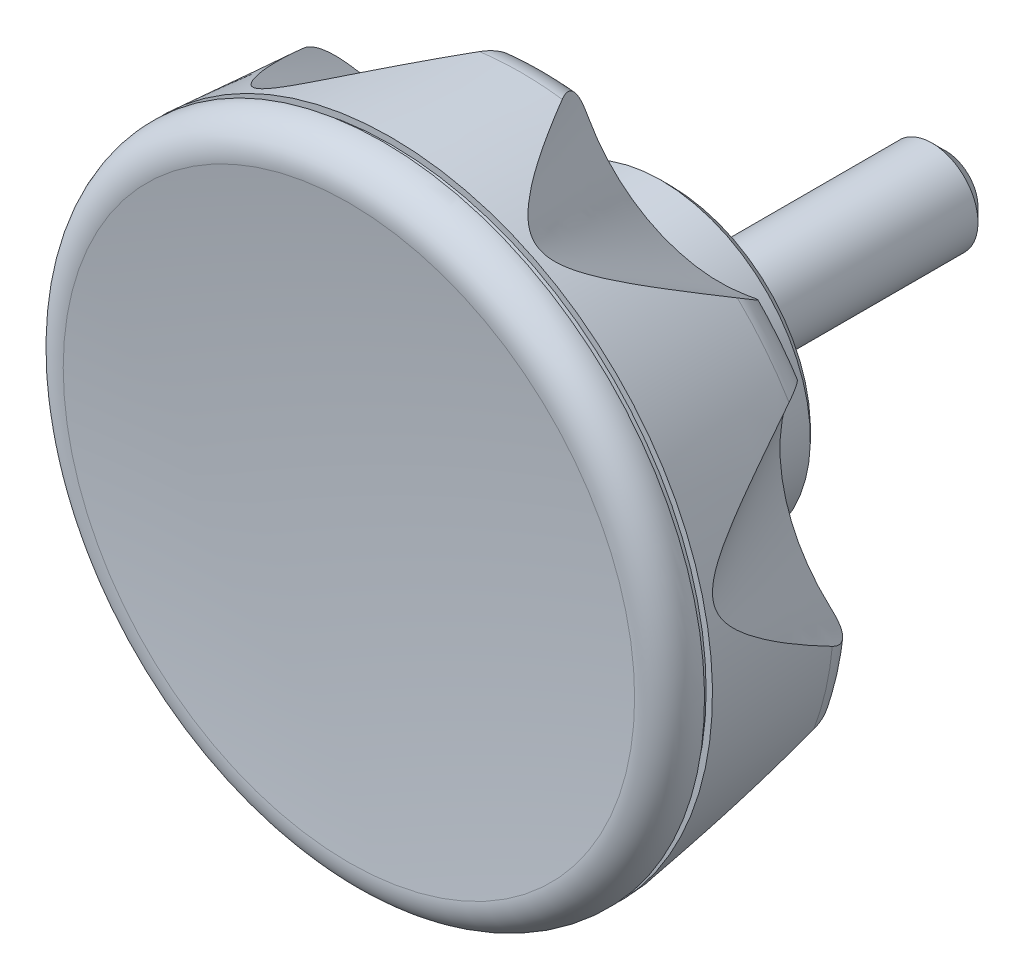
ISO-10303-21;
HEADER;
FILE_DESCRIPTION(('STEP AP214'),'2;1');
FILE_NAME('part.step','',(''),(''),'','','');
FILE_SCHEMA(('AUTOMOTIVE_DESIGN { 1 0 10303 214 1 1 1 1 }'));
ENDSEC;
DATA;
#1=APPLICATION_CONTEXT('core data for automotive mechanical design processes');
#2=APPLICATION_PROTOCOL_DEFINITION('international standard','automotive_design',2000,#1);
#3=PRODUCT_CONTEXT('',#1,'mechanical');
#4=PRODUCT('Part','Part','',(#3));
#5=PRODUCT_RELATED_PRODUCT_CATEGORY('part','',(#4));
#6=PRODUCT_DEFINITION_FORMATION('','',#4);
#7=PRODUCT_DEFINITION_CONTEXT('part definition',#1,'design');
#8=PRODUCT_DEFINITION('design','',#6,#7);
#9=PRODUCT_DEFINITION_SHAPE('','',#8);
#10=(LENGTH_UNIT() NAMED_UNIT(*) SI_UNIT(.MILLI.,.METRE.));
#11=(NAMED_UNIT(*) PLANE_ANGLE_UNIT() SI_UNIT($,.RADIAN.));
#12=(NAMED_UNIT(*) SI_UNIT($,.STERADIAN.) SOLID_ANGLE_UNIT());
#13=UNCERTAINTY_MEASURE_WITH_UNIT(LENGTH_MEASURE(1.E-05),#10,'distance_accuracy_value','');
#14=(GEOMETRIC_REPRESENTATION_CONTEXT(3) GLOBAL_UNCERTAINTY_ASSIGNED_CONTEXT((#13)) GLOBAL_UNIT_ASSIGNED_CONTEXT((#10,
#11,#12)) REPRESENTATION_CONTEXT('',''));
#15=CARTESIAN_POINT('',(0.,0.,0.));
#16=DIRECTION('',(0.,0.,1.));
#17=DIRECTION('',(1.,0.,0.));
#18=AXIS2_PLACEMENT_3D('',#15,#16,#17);
#19=CARTESIAN_POINT('',(0.,0.,16.5));
#20=DIRECTION('',(0.,0.,1.));
#21=DIRECTION('',(0.,1.,0.));
#22=AXIS2_PLACEMENT_3D('',#19,#20,#21);
#23=TOROIDAL_SURFACE('',#22,30.5569827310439,3.49999999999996);
#24=CARTESIAN_POINT('',(-30.4277694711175,-2.80714065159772,12.9999999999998));
#25=CARTESIAN_POINT('',(-30.4922913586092,-2.86477433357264,12.9999995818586));
#26=CARTESIAN_POINT('',(-30.558064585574,-2.92106397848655,13.002073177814));
#27=CARTESIAN_POINT('',(-30.6919823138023,-3.03053883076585,13.010813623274));
#28=CARTESIAN_POINT('',(-30.7601296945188,-3.08372004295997,13.017486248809));
#29=CARTESIAN_POINT('',(-30.8991260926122,-3.18687819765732,13.0359552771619));
#30=CARTESIAN_POINT('',(-30.9699939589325,-3.23682184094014,13.0477974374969));
#31=CARTESIAN_POINT('',(-31.1134463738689,-3.33240092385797,13.0770311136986));
#32=CARTESIAN_POINT('',(-31.1860302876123,-3.378037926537,13.0944206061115));
#33=CARTESIAN_POINT('',(-31.3330374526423,-3.46480885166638,13.1352731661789));
#34=CARTESIAN_POINT('',(-31.4074708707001,-3.50590306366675,13.1587845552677));
#35=CARTESIAN_POINT('',(-31.5569302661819,-3.58258562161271,13.2120638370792));
#36=CARTESIAN_POINT('',(-31.6319561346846,-3.61817495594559,13.2418306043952));
#37=CARTESIAN_POINT('',(-31.7815087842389,-3.68321920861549,13.3075877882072));
#38=CARTESIAN_POINT('',(-31.856036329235,-3.71269963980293,13.34355112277));
#39=CARTESIAN_POINT('',(-32.0040438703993,-3.76533170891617,13.4217135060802));
#40=CARTESIAN_POINT('',(-32.077524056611,-3.78848450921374,13.4639114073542));
#41=CARTESIAN_POINT('',(-32.2127536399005,-3.82555260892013,13.5481801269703));
#42=CARTESIAN_POINT('',(-32.2747476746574,-3.84029295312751,13.5894992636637));
#43=CARTESIAN_POINT('',(-32.3967559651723,-3.8648324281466,13.6763591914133));
#44=CARTESIAN_POINT('',(-32.4567695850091,-3.87462998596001,13.7219013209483));
#45=CARTESIAN_POINT('',(-32.5743242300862,-3.88932568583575,13.8168914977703));
#46=CARTESIAN_POINT('',(-32.6318634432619,-3.89422029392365,13.8663423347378));
#47=CARTESIAN_POINT('',(-32.7439869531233,-3.89923372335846,13.9687276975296));
#48=CARTESIAN_POINT('',(-32.7985700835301,-3.89935067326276,14.0216635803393));
#49=CARTESIAN_POINT('',(-32.9523859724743,-3.89300950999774,14.1800128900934));
#50=CARTESIAN_POINT('',(-33.0472644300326,-3.88049800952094,14.289516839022));
#51=CARTESIAN_POINT('',(-33.2229626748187,-3.84059009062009,14.5165356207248));
#52=CARTESIAN_POINT('',(-33.3037858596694,-3.81319727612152,14.6340485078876));
#53=CARTESIAN_POINT('',(-33.4587694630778,-3.74182305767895,14.8877018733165));
#54=CARTESIAN_POINT('',(-33.5312118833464,-3.69634528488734,15.0244673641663));
#55=CARTESIAN_POINT('',(-33.6577169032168,-3.59210577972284,15.3014973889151));
#56=CARTESIAN_POINT('',(-33.7117580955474,-3.53332870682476,15.4417657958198));
#57=CARTESIAN_POINT('',(-33.7933589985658,-3.41681811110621,15.6966901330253));
#58=CARTESIAN_POINT('',(-33.8239786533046,-3.36093708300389,15.8112404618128));
#59=CARTESIAN_POINT('',(-33.8735900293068,-3.24311939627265,16.0391889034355));
#60=CARTESIAN_POINT('',(-33.8926252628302,-3.18120642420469,16.1525897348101));
#61=CARTESIAN_POINT('',(-33.906149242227,-3.11665429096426,16.2650726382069));
#62=B_SPLINE_CURVE_WITH_KNOTS('',3,(#24,#25,#26,#27,#28,#29,#30,#31,#32,#33,#34,#35,#36,#37,#38,
#39,#40,#41,#42,#43,#44,#45,#46,#47,#48,#49,#50,#51,#52,#53,#54,#55,#56,#57,#58,#59,#60,#61),
.UNSPECIFIED.,.F.,.F.,(4,2,2,2,2,2,2,2,2,2,2,2,2,2,2,2,2,2,4),(0.,0.259555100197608,
0.519436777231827,0.781666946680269,1.04380157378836,1.30807155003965,1.57229402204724,
1.83538972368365,2.09843706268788,2.32597812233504,2.55359154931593,2.78136891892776,
3.00923550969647,3.44356210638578,3.87778356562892,4.35989598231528,4.84256736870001,
5.23515773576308,5.6262642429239),.UNSPECIFIED.);
#63=CARTESIAN_POINT('',(-30.4277694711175,-2.8071406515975,12.9999999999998));
#64=VERTEX_POINT('',#63);
#65=CARTESIAN_POINT('',(-33.906149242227,-3.11665429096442,16.2650726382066));
#66=VERTEX_POINT('',#65);
#67=EDGE_CURVE('E116',#64,#66,#62,.T.);
#68=ORIENTED_EDGE('',*,*,#67,.F.);
#69=CARTESIAN_POINT('',(0.,0.,12.9999999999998));
#70=DIRECTION('',(0.,0.,1.));
#71=DIRECTION('',(0.,1.,0.));
#72=AXIS2_PLACEMENT_3D('',#69,#70,#71);
#73=CIRCLE('',#72,30.5569827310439);
#74=CARTESIAN_POINT('',(-28.632445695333,-10.6729680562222,12.9999999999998));
#75=VERTEX_POINT('',#74);
#76=EDGE_CURVE('E37',#64,#75,#73,.T.);
#77=ORIENTED_EDGE('',*,*,#76,.T.);
#78=CARTESIAN_POINT('',(-31.9006505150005,-11.9033183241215,16.2650726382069));
#79=CARTESIAN_POINT('',(-31.9127655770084,-11.8542285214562,16.1788472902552));
#80=CARTESIAN_POINT('',(-31.9213061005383,-11.8051794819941,16.092150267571));
#81=CARTESIAN_POINT('',(-31.9308592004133,-11.7073324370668,15.9181115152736));
#82=CARTESIAN_POINT('',(-31.9318654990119,-11.6585346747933,15.8307693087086));
#83=CARTESIAN_POINT('',(-31.9229383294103,-11.512015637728,15.5668553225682));
#84=CARTESIAN_POINT('',(-31.9008235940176,-11.4150672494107,15.389974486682));
#85=CARTESIAN_POINT('',(-31.8413429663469,-11.2738330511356,15.1279647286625));
#86=CARTESIAN_POINT('',(-31.8170085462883,-11.2273082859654,15.0409016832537));
#87=CARTESIAN_POINT('',(-31.7592310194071,-11.1363098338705,14.8687696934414));
#88=CARTESIAN_POINT('',(-31.7257939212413,-11.0918348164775,14.7836994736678));
#89=CARTESIAN_POINT('',(-31.6497513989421,-11.0057346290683,14.616681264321));
#90=CARTESIAN_POINT('',(-31.6071781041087,-10.9641001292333,14.53472348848));
#91=CARTESIAN_POINT('',(-31.5127571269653,-10.8842577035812,14.3745637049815));
#92=CARTESIAN_POINT('',(-31.4609118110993,-10.8460489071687,14.296360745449));
#93=CARTESIAN_POINT('',(-31.3560371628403,-10.7789272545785,14.1553613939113));
#94=CARTESIAN_POINT('',(-31.3041952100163,-10.7494623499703,14.0919431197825));
#95=CARTESIAN_POINT('',(-31.1940469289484,-10.6941766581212,13.9692748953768));
#96=CARTESIAN_POINT('',(-31.1357419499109,-10.6683551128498,13.9100240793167));
#97=CARTESIAN_POINT('',(-31.0131130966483,-10.6208593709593,13.7963342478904));
#98=CARTESIAN_POINT('',(-30.9487918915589,-10.599183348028,13.7418931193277));
#99=CARTESIAN_POINT('',(-30.8147052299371,-10.5604026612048,13.6383551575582));
#100=CARTESIAN_POINT('',(-30.7449405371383,-10.5432973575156,13.5892575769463));
#101=CARTESIAN_POINT('',(-30.6117866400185,-10.5162408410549,13.5039379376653));
#102=CARTESIAN_POINT('',(-30.5490604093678,-10.5055947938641,13.4668960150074));
#103=CARTESIAN_POINT('',(-30.4207373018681,-10.4879457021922,13.3971240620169));
#104=CARTESIAN_POINT('',(-30.3551395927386,-10.480943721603,13.3643952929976));
#105=CARTESIAN_POINT('',(-30.2216746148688,-10.4706537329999,13.3033769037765));
#106=CARTESIAN_POINT('',(-30.1538085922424,-10.467363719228,13.2750848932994));
#107=CARTESIAN_POINT('',(-30.0163143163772,-10.4644744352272,13.2229137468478));
#108=CARTESIAN_POINT('',(-29.9466854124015,-10.4648765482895,13.1990362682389));
#109=CARTESIAN_POINT('',(-29.735784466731,-10.4715361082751,13.1338837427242));
#110=CARTESIAN_POINT('',(-29.5926042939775,-10.4832546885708,13.0991362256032));
#111=CARTESIAN_POINT('',(-29.3050619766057,-10.5200545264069,13.0457059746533));
#112=CARTESIAN_POINT('',(-29.1606993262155,-10.5451418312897,13.0270305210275));
#113=CARTESIAN_POINT('',(-28.952520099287,-10.5899735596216,13.0100924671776));
#114=CARTESIAN_POINT('',(-28.8880614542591,-10.6050709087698,13.0062521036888));
#115=CARTESIAN_POINT('',(-28.7597887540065,-10.637430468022,13.0012106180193));
#116=CARTESIAN_POINT('',(-28.6959733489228,-10.6546860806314,13.0000016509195));
#117=CARTESIAN_POINT('',(-28.632445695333,-10.6729680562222,12.9999999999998));
#118=B_SPLINE_CURVE_WITH_KNOTS('',3,(#78,#79,#80,#81,#82,#83,#84,#85,#86,#87,#88,#89,#90,#91,
#92,#93,#94,#95,#96,#97,#98,#99,#100,#101,#102,#103,#104,#105,#106,#107,#108,#109,#110,#111,
#112,#113,#114,#115,#116,#117),.UNSPECIFIED.,.F.,.F.,(4,2,2,2,2,2,2,2,2,2,2,2,2,2,2,2,2,2,2,4),
(0.,0.299698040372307,0.599645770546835,1.20498031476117,1.50964069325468,1.81410045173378,
2.11750656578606,2.4208353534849,2.68159295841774,2.94229623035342,3.20288438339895,
3.46343604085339,3.68403118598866,3.90469069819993,4.12523092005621,4.34585377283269,
4.78744512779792,5.22923640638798,5.42810702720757,5.62638394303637),.UNSPECIFIED.);
#119=CARTESIAN_POINT('',(-31.9006505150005,-11.9033183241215,16.2650726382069));
#120=VERTEX_POINT('',#119);
#121=EDGE_CURVE('E347',#120,#75,#118,.T.);
#122=ORIENTED_EDGE('',*,*,#121,.F.);
#123=CARTESIAN_POINT('',(0.,0.,16.2650726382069));
#124=DIRECTION('',(0.,0.,1.));
#125=DIRECTION('',(0.,1.,0.));
#126=AXIS2_PLACEMENT_3D('',#123,#124,#125);
#127=CIRCLE('',#126,34.0490894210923);
#128=EDGE_CURVE('E123',#66,#120,#127,.T.);
#129=ORIENTED_EDGE('',*,*,#128,.F.);
#130=EDGE_LOOP('',(#68,#77,#122,#129));
#131=FACE_BOUND('',#130,.T.);
#132=ADVANCED_FACE('F14',(#131),#23,.T.);
#133=CARTESIAN_POINT('',(-16.7766930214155,-25.5396116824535,12.9999999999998));
#134=CARTESIAN_POINT('',(-16.7718619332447,-25.6259909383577,12.9999995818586));
#135=CARTESIAN_POINT('',(-16.7688618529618,-25.7125105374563,13.002073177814));
#136=CARTESIAN_POINT('',(-16.7667673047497,-25.8854680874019,13.010813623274));
#137=CARTESIAN_POINT('',(-16.7676777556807,-25.9719057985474,13.017486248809));
#138=CARTESIAN_POINT('',(-16.7736882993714,-26.1448956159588,13.0359552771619));
#139=CARTESIAN_POINT('',(-16.7788261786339,-26.2314416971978,13.0477974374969));
#140=CARTESIAN_POINT('',(-16.7935405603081,-26.4031898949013,13.0770311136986));
#141=CARTESIAN_POINT('',(-16.803115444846,-26.4883924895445,13.0944206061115));
#142=CARTESIAN_POINT('',(-16.8269326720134,-26.6574281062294,13.1352731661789));
#143=CARTESIAN_POINT('',(-16.8412124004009,-26.7412443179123,13.1587845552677));
#144=CARTESIAN_POINT('',(-16.8744459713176,-26.9059071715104,13.2120638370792));
#145=CARTESIAN_POINT('',(-16.893398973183,-26.9867543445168,13.2418306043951));
#146=CARTESIAN_POINT('',(-16.9357898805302,-27.1442337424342,13.3075877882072));
#147=CARTESIAN_POINT('',(-16.9592083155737,-27.220882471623,13.3435511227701));
#148=CARTESIAN_POINT('',(-17.0103400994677,-27.3694149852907,13.4217135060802));
#149=CARTESIAN_POINT('',(-17.0380526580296,-27.4412996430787,13.4639114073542));
#150=CARTESIAN_POINT('',(-17.0933859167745,-27.5701379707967,13.5481801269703));
#151=CARTESIAN_POINT('',(-17.1205141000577,-27.6277973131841,13.5894992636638));
#152=CARTESIAN_POINT('',(-17.1773992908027,-27.738487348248,13.6763591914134));
#153=CARTESIAN_POINT('',(-17.2071571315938,-27.7915165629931,13.7219013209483));
#154=CARTESIAN_POINT('',(-17.2689616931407,-27.8925871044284,13.8168914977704));
#155=CARTESIAN_POINT('',(-17.3010100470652,-27.9406248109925,13.8663423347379));
#156=CARTESIAN_POINT('',(-17.3669982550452,-28.0314123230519,13.9687276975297));
#157=CARTESIAN_POINT('',(-17.4009388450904,-28.0741600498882,14.0216635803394));
#158=CARTESIAN_POINT('',(-17.501799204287,-28.1904645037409,14.1800128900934));
#159=CARTESIAN_POINT('',(-17.5707368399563,-28.2568426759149,14.289516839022));
#160=CARTESIAN_POINT('',(-17.7114841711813,-28.3693269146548,14.5165356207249));
#161=CARTESIAN_POINT('',(-17.7832931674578,-28.4154378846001,14.6340485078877));
#162=CARTESIAN_POINT('',(-17.9357264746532,-28.4921078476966,14.8877018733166));
#163=CARTESIAN_POINT('',(-18.0164495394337,-28.5203906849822,15.0244673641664));
#164=CARTESIAN_POINT('',(-18.1768218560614,-28.5543040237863,15.3014973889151));
#165=CARTESIAN_POINT('',(-18.256469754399,-28.5599082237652,15.4417657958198));
#166=CARTESIAN_POINT('',(-18.3984387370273,-28.5510632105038,15.6966901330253));
#167=CARTESIAN_POINT('',(-18.4612193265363,-28.5401613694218,15.8112404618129));
#168=CARTESIAN_POINT('',(-18.5842650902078,-28.5054909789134,16.0391889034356));
#169=CARTESIAN_POINT('',(-18.6445388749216,-28.4817712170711,16.1525897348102));
#170=CARTESIAN_POINT('',(-18.703439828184,-28.4520970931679,16.2650726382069));
#171=B_SPLINE_CURVE_WITH_KNOTS('',3,(#133,#134,#135,#136,#137,#138,#139,#140,#141,#142,#143,
#144,#145,#146,#147,#148,#149,#150,#151,#152,#153,#154,#155,#156,#157,#158,#159,#160,#161,#162,
#163,#164,#165,#166,#167,#168,#169,#170),.UNSPECIFIED.,.F.,.F.,(4,2,2,2,2,2,2,2,2,2,2,2,2,2,2,2,
2,2,4),(0.,0.259555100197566,0.519436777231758,0.781666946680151,1.04380157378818,
1.30807155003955,1.57229402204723,1.83538972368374,2.09843706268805,2.32597812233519,
2.55359154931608,2.78136891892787,3.00923550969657,3.44356210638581,3.8777835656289,
4.35989598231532,4.84256736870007,5.23515773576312,5.62626424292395),.UNSPECIFIED.);
#172=CARTESIAN_POINT('',(-16.7766930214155,-25.5396116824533,12.9999999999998));
#173=VERTEX_POINT('',#172);
#174=CARTESIAN_POINT('',(-18.7034398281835,-28.4520970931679,16.2650726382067));
#175=VERTEX_POINT('',#174);
#176=EDGE_CURVE('E346',#173,#175,#171,.T.);
#177=ORIENTED_EDGE('',*,*,#176,.F.);
#178=CARTESIAN_POINT('',(-9.50757545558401,-29.040234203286,12.9999999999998));
#179=VERTEX_POINT('',#178);
#180=EDGE_CURVE('E132',#173,#179,#73,.T.);
#181=ORIENTED_EDGE('',*,*,#180,.T.);
#182=CARTESIAN_POINT('',(-10.5833412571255,-32.3625304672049,16.2650726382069));
#183=CARTESIAN_POINT('',(-10.6292748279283,-32.341395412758,16.1788472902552));
#184=CARTESIAN_POINT('',(-10.6729478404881,-32.3174910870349,16.092150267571));
#185=CARTESIAN_POINT('',(-10.755404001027,-32.2639533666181,15.9181115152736));
#186=CARTESIAN_POINT('',(-10.7941830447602,-32.2343152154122,15.8307693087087));
#187=CARTESIAN_POINT('',(-10.9031702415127,-32.1359825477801,15.5668553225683));
#188=CARTESIAN_POINT('',(-10.9651792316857,-32.0582462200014,15.389974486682));
#189=CARTESIAN_POINT('',(-11.0385150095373,-31.9236843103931,15.1279647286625));
#190=CARTESIAN_POINT('',(-11.0597172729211,-31.8756511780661,15.0409016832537));
#191=CARTESIAN_POINT('',(-11.0948390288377,-31.773742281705,14.8687696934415));
#192=CARTESIAN_POINT('',(-11.1087633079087,-31.7198703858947,14.7836994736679));
#193=CARTESIAN_POINT('',(-11.1286674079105,-31.6067353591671,14.616681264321));
#194=CARTESIAN_POINT('',(-11.1346745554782,-31.5474915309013,14.53472348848));
#195=CARTESIAN_POINT('',(-11.1382273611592,-31.4238893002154,14.3745637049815));
#196=CARTESIAN_POINT('',(-11.1357751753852,-31.3595322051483,14.2963607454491));
#197=CARTESIAN_POINT('',(-11.1228647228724,-31.2356882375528,14.1553613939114));
#198=CARTESIAN_POINT('',(-11.1135783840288,-31.1767854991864,14.0919431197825));
#199=CARTESIAN_POINT('',(-11.0881261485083,-31.0561980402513,13.9692748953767));
#200=CARTESIAN_POINT('',(-11.0719616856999,-30.9945139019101,13.9100240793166));
#201=CARTESIAN_POINT('',(-11.0326375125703,-30.86902569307,13.7963342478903));
#202=CARTESIAN_POINT('',(-11.0094808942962,-30.8052225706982,13.7418931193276));
#203=CARTESIAN_POINT('',(-10.9561991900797,-30.67621003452,13.6383551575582));
#204=CARTESIAN_POINT('',(-10.9260750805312,-30.6110008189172,13.5892575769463));
#205=CARTESIAN_POINT('',(-10.8642086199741,-30.4900274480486,13.5039379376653));
#206=CARTESIAN_POINT('',(-10.8334228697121,-30.4343484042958,13.4668960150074));
#207=CARTESIAN_POINT('',(-10.7672133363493,-30.3230173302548,13.3971240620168));
#208=CARTESIAN_POINT('',(-10.731788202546,-30.2673653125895,13.3643952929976));
#209=CARTESIAN_POINT('',(-10.6566191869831,-30.1566024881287,13.3033769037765));
#210=CARTESIAN_POINT('',(-10.6168776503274,-30.1014914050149,13.2750848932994));
#211=CARTESIAN_POINT('',(-10.5334103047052,-29.992192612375,13.2229137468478));
#212=CARTESIAN_POINT('',(-10.4896830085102,-29.9380052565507,13.1990362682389));
#213=CARTESIAN_POINT('',(-10.3529817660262,-29.777268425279,13.1338837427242));
#214=CARTESIAN_POINT('',(-10.2545484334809,-29.6726320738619,13.0991362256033));
#215=CARTESIAN_POINT('',(-10.0464974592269,-29.4707667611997,13.0457059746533));
#216=CARTESIAN_POINT('',(-9.93687477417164,-29.3735411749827,13.0270305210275));
#217=CARTESIAN_POINT('',(-9.77202629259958,-29.2387322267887,13.0100924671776));
#218=CARTESIAN_POINT('',(-9.72003340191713,-29.1977494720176,13.0062521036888));
#219=CARTESIAN_POINT('',(-9.61475695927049,-29.1176376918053,13.0012106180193));
#220=CARTESIAN_POINT('',(-9.56147772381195,-29.0785034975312,13.0000016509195));
#221=CARTESIAN_POINT('',(-9.50757545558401,-29.0402342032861,12.9999999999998));
#222=B_SPLINE_CURVE_WITH_KNOTS('',3,(#182,#183,#184,#185,#186,#187,#188,#189,#190,#191,#192,
#193,#194,#195,#196,#197,#198,#199,#200,#201,#202,#203,#204,#205,#206,#207,#208,#209,#210,#211,
#212,#213,#214,#215,#216,#217,#218,#219,#220,#221),.UNSPECIFIED.,.F.,.F.,(4,2,2,2,2,2,2,2,2,2,2,
2,2,2,2,2,2,2,2,4),(0.,0.299698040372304,0.599645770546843,1.20498031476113,1.50964069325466,
1.81410045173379,2.1175065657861,2.42083535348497,2.68159295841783,2.94229623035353,
3.20288438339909,3.46343604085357,3.6840311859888,3.90469069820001,4.12523092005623,
4.34585377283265,4.78744512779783,5.22923640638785,5.42810702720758,5.62638394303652),.UNSPECIFIED.);
#223=CARTESIAN_POINT('',(-10.5833412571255,-32.3625304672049,16.2650726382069));
#224=VERTEX_POINT('',#223);
#225=EDGE_CURVE('E390',#224,#179,#222,.T.);
#226=ORIENTED_EDGE('',*,*,#225,.F.);
#227=EDGE_CURVE('E670',#175,#224,#127,.T.);
#228=ORIENTED_EDGE('',*,*,#227,.F.);
#229=EDGE_LOOP('',(#177,#181,#226,#228));
#230=FACE_BOUND('',#229,.T.);
#231=ADVANCED_FACE('F175',(#230),#23,.T.);
#232=CARTESIAN_POINT('',(9.50757545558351,-29.0402342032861,12.9999999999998));
#233=CARTESIAN_POINT('',(9.5781216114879,-29.090313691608,12.9999995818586));
#234=CARTESIAN_POINT('',(9.64763587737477,-29.1419122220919,13.002073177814));
#235=CARTESIAN_POINT('',(9.78416546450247,-29.2481119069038,13.010813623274));
#236=CARTESIAN_POINT('',(9.85117753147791,-29.3027167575,13.017486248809));
#237=CARTESIAN_POINT('',(9.98267890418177,-29.4152733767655,13.0359552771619));
#238=CARTESIAN_POINT('',(10.0471399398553,-29.4732509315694,13.0477974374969));
#239=CARTESIAN_POINT('',(10.1722438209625,-29.5918383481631,13.0770311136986));
#240=CARTESIAN_POINT('',(10.2328880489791,-29.6524472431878,13.0944206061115));
#241=CARTESIAN_POINT('',(10.3501956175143,-29.7764602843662,13.1352731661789));
#242=CARTESIAN_POINT('',(10.4068225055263,-29.8398831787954,13.1587845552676));
#243=CARTESIAN_POINT('',(10.5148403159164,-29.9685318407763,13.2120638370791));
#244=CARTESIAN_POINT('',(10.5662321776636,-30.0337572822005,13.2418306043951));
#245=CARTESIAN_POINT('',(10.662924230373,-30.1650866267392,13.3075877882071));
#246=CARTESIAN_POINT('',(10.7082494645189,-30.231185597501,13.3435511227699));
#247=CARTESIAN_POINT('',(10.7924967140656,-30.3637705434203,13.4217135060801));
#248=CARTESIAN_POINT('',(10.8314199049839,-30.4302564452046,13.4639114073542));
#249=CARTESIAN_POINT('',(10.8976500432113,-30.5538471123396,13.5481801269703));
#250=CARTESIAN_POINT('',(10.9258157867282,-30.611006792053,13.5894992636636));
#251=CARTESIAN_POINT('',(10.9768894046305,-30.7244955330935,13.6763591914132));
#252=CARTESIAN_POINT('',(10.9997956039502,-30.7808243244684,13.7219013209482));
#253=CARTESIAN_POINT('',(11.0402812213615,-30.8921615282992,13.8168914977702));
#254=CARTESIAN_POINT('',(11.0578567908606,-30.9471689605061,13.8663423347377));
#255=CARTESIAN_POINT('',(11.0876943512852,-31.0553657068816,13.9687276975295));
#256=CARTESIAN_POINT('',(11.0999542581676,-31.1085543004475,14.0216635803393));
#257=CARTESIAN_POINT('',(11.12799933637,-31.2599247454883,14.1800128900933));
#258=CARTESIAN_POINT('',(11.1369139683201,-31.3552084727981,14.2895168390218));
#259=CARTESIAN_POINT('',(11.1371031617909,-31.5353819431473,14.5165356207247));
#260=CARTESIAN_POINT('',(11.1283819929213,-31.6202741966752,14.6340485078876));
#261=CARTESIAN_POINT('',(11.0932843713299,-31.7872542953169,14.8877018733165));
#262=CARTESIAN_POINT('',(11.0650667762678,-31.868000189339,15.0244673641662));
#263=CARTESIAN_POINT('',(10.9915907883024,-32.0145289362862,15.3014973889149));
#264=CARTESIAN_POINT('',(10.9463126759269,-32.0802943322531,15.4417657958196));
#265=CARTESIAN_POINT('',(10.8508811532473,-32.1857753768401,15.6966901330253));
#266=CARTESIAN_POINT('',(10.8032146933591,-32.2280620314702,15.8112404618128));
#267=CARTESIAN_POINT('',(10.6993905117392,-32.3026464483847,16.0391889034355));
#268=CARTESIAN_POINT('',(10.6432655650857,-32.3349813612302,16.1525897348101));
#269=CARTESIAN_POINT('',(10.5833412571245,-32.362530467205,16.2650726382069));
#270=B_SPLINE_CURVE_WITH_KNOTS('',3,(#232,#233,#234,#235,#236,#237,#238,#239,#240,#241,#242,
#243,#244,#245,#246,#247,#248,#249,#250,#251,#252,#253,#254,#255,#256,#257,#258,#259,#260,#261,
#262,#263,#264,#265,#266,#267,#268,#269),.UNSPECIFIED.,.F.,.F.,(4,2,2,2,2,2,2,2,2,2,2,2,2,2,2,2,
2,2,4),(0.,0.259555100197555,0.51943677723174,0.781666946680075,1.04380157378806,
1.30807155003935,1.57229402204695,1.83538972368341,2.09843706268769,2.32597812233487,
2.55359154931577,2.78136891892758,3.00923550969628,3.44356210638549,3.87778356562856,
4.35989598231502,4.84256736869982,5.23515773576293,5.62626424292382),.UNSPECIFIED.);
#271=CARTESIAN_POINT('',(9.50757545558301,-29.0402342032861,12.9999999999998));
#272=VERTEX_POINT('',#271);
#273=CARTESIAN_POINT('',(10.583341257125,-32.3625304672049,16.2650726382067));
#274=VERTEX_POINT('',#273);
#275=EDGE_CURVE('E395',#272,#274,#270,.T.);
#276=ORIENTED_EDGE('',*,*,#275,.F.);
#277=CARTESIAN_POINT('',(16.7766930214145,-25.5396116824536,12.9999999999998));
#278=VERTEX_POINT('',#277);
#279=EDGE_CURVE('E136',#272,#278,#73,.T.);
#280=ORIENTED_EDGE('',*,*,#279,.T.);
#281=CARTESIAN_POINT('',(18.703439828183,-28.4520970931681,16.2650726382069));
#282=CARTESIAN_POINT('',(18.6582766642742,-28.4748319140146,16.1788472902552));
#283=CARTESIAN_POINT('',(18.6123578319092,-28.4940727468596,16.0921502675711));
#284=CARTESIAN_POINT('',(18.5190897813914,-28.5251593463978,15.9181115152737));
#285=CARTESIAN_POINT('',(18.4717394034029,-28.5369989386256,15.8307693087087));
#286=CARTESIAN_POINT('',(18.3269074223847,-28.5608991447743,15.5668553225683));
#287=CARTESIAN_POINT('',(18.2274687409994,-28.5609119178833,15.3899744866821));
#288=CARTESIAN_POINT('',(18.0765398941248,-28.5343501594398,15.1279647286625));
#289=CARTESIAN_POINT('',(18.0257666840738,-28.5209785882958,15.0409016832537));
#290=CARTESIAN_POINT('',(17.9241930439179,-28.4848987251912,14.8687696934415));
#291=CARTESIAN_POINT('',(17.8733926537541,-28.462196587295,14.7836994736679));
#292=CARTESIAN_POINT('',(17.7725301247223,-28.407219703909,14.616681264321));
#293=CARTESIAN_POINT('',(17.7224660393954,-28.3749783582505,14.53472348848));
#294=CARTESIAN_POINT('',(17.6236147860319,-28.3006913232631,14.3745637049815));
#295=CARTESIAN_POINT('',(17.5748272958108,-28.2586481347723,14.2963607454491));
#296=CARTESIAN_POINT('',(17.4860517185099,-28.1713388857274,14.1553613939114));
#297=CARTESIAN_POINT('',(17.4457896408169,-28.1273532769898,14.0919431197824));
#298=CARTESIAN_POINT('',(17.3673797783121,-28.0322688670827,13.9692748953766));
#299=CARTESIAN_POINT('',(17.3292315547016,-27.9811715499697,13.9100240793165));
#300=CARTESIAN_POINT('',(17.2556391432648,-27.8721860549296,13.7963342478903));
#301=CARTESIAN_POINT('',(17.2201937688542,-27.8143008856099,13.7418931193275));
#302=CARTESIAN_POINT('',(17.1525483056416,-27.6922055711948,13.6383551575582));
#303=CARTESIAN_POINT('',(17.12034776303,-27.6279963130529,13.5892575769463));
#304=CARTESIAN_POINT('',(17.064340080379,-27.5042015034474,13.5039379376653));
#305=CARTESIAN_POINT('',(17.0400030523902,-27.4454169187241,13.4668960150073));
#306=CARTESIAN_POINT('',(16.9942418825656,-27.3242384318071,13.3971240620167));
#307=CARTESIAN_POINT('',(16.9728185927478,-27.2618434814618,13.3643952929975));
#308=CARTESIAN_POINT('',(16.9330878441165,-27.1340144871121,13.3033769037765));
#309=CARTESIAN_POINT('',(16.9147787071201,-27.0685821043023,13.2750848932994));
#310=CARTESIAN_POINT('',(16.8813665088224,-26.9351780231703,13.2229137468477));
#311=CARTESIAN_POINT('',(16.8662646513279,-26.8672053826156,13.1990362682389));
#312=CARTESIAN_POINT('',(16.825827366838,-26.660110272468,13.1338837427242));
#313=CARTESIAN_POINT('',(16.805391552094,-26.5179122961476,13.0991362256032));
#314=CARTESIAN_POINT('',(16.7772845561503,-26.2293905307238,13.0457059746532));
#315=CARTESIAN_POINT('',(16.7696191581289,-26.0830649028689,13.0270305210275));
#316=CARTESIAN_POINT('',(16.7670026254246,-25.8701291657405,13.0100924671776));
#317=CARTESIAN_POINT('',(16.7673780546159,-25.8039271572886,13.0062521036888));
#318=CARTESIAN_POINT('',(16.7703829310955,-25.6716698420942,13.0012106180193));
#319=CARTESIAN_POINT('',(16.7730056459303,-25.605614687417,13.0000016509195));
#320=CARTESIAN_POINT('',(16.776693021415,-25.5396116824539,12.9999999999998));
#321=B_SPLINE_CURVE_WITH_KNOTS('',3,(#281,#282,#283,#284,#285,#286,#287,#288,#289,#290,#291,
#292,#293,#294,#295,#296,#297,#298,#299,#300,#301,#302,#303,#304,#305,#306,#307,#308,#309,#310,
#311,#312,#313,#314,#315,#316,#317,#318,#319,#320),.UNSPECIFIED.,.F.,.F.,(4,2,2,2,2,2,2,2,2,2,2,
2,2,2,2,2,2,2,2,4),(0.,0.299698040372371,0.599645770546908,1.20498031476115,1.50964069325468,
1.81410045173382,2.11750656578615,2.42083535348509,2.68159295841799,2.9422962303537,
3.20288438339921,3.46343604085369,3.68403118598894,3.90469069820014,4.12523092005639,
4.34585377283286,4.7874451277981,5.22923640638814,5.4281070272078,5.62638394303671),.UNSPECIFIED.);
#322=CARTESIAN_POINT('',(18.703439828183,-28.4520970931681,16.2650726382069));
#323=VERTEX_POINT('',#322);
#324=EDGE_CURVE('E402',#323,#278,#321,.T.);
#325=ORIENTED_EDGE('',*,*,#324,.F.);
#326=EDGE_CURVE('E673',#274,#323,#127,.T.);
#327=ORIENTED_EDGE('',*,*,#326,.F.);
#328=EDGE_LOOP('',(#276,#280,#325,#327));
#329=FACE_BOUND('',#328,.T.);
#330=ADVANCED_FACE('F182',(#329),#23,.T.);
#331=CARTESIAN_POINT('',(28.6324456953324,-10.6729680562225,12.9999999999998));
#332=CARTESIAN_POINT('',(28.7155842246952,-10.6490369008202,12.9999995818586));
#333=CARTESIAN_POINT('',(28.7992670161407,-10.6268596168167,13.002073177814));
#334=CARTESIAN_POINT('',(28.9674220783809,-10.5863309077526,13.010813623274));
#335=CARTESIAN_POINT('',(29.0518952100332,-10.5679843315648,13.017486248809));
#336=CARTESIAN_POINT('',(29.2218852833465,-10.5353503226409,13.0359552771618));
#337=CARTESIAN_POINT('',(29.3074047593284,-10.5211010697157,13.0477974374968));
#338=CARTESIAN_POINT('',(29.4781211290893,-10.4972289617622,13.0770311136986));
#339=CARTESIAN_POINT('',(29.5633181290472,-10.4876044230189,13.0944206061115));
#340=CARTESIAN_POINT('',(29.7334155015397,-10.4732105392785,13.1352731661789));
#341=CARTESIAN_POINT('',(29.8183078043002,-10.4684813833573,13.1587845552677));
#342=CARTESIAN_POINT('',(29.9862373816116,-10.4642407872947,13.2120638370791));
#343=CARTESIAN_POINT('',(30.0692749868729,-10.4647284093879,13.2418306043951));
#344=CARTESIAN_POINT('',(30.2322389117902,-10.4710140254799,13.3075877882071));
#345=CARTESIAN_POINT('',(30.3121769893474,-10.4767893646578,13.34355112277));
#346=CARTESIAN_POINT('',(30.4683633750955,-10.4935875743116,13.4217135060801));
#347=CARTESIAN_POINT('',(30.5446123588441,-10.5046094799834,13.4639114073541));
#348=CARTESIAN_POINT('',(30.68253324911,-10.5298861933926,13.5481801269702));
#349=CARTESIAN_POINT('',(30.7447835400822,-10.5435038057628,13.5894992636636));
#350=CARTESIAN_POINT('',(30.8653564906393,-10.5743319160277,13.6763591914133));
#351=CARTESIAN_POINT('',(30.9236778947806,-10.5915435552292,13.7219013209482));
#352=CARTESIAN_POINT('',(31.0359671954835,-10.6293082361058,13.8168914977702));
#353=CARTESIAN_POINT('',(31.0899319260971,-10.6498636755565,13.8663423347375));
#354=CARTESIAN_POINT('',(31.193126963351,-10.6939952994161,13.9687276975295));
#355=CARTESIAN_POINT('',(31.2423554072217,-10.717572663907,14.0216635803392));
#356=CARTESIAN_POINT('',(31.3781874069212,-10.790024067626,14.1800128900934));
#357=CARTESIAN_POINT('',(31.4582414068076,-10.8424627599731,14.2895168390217));
#358=CARTESIAN_POINT('',(31.5992246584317,-10.9546511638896,14.5165356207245));
#359=CARTESIAN_POINT('',(31.6601585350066,-11.0143991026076,14.6340485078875));
#360=CARTESIAN_POINT('',(31.7688258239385,-11.1459499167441,14.8877018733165));
#361=CARTESIAN_POINT('',(31.8143621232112,-11.2183555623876,15.0244673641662));
#362=CARTESIAN_POINT('',(31.8831113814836,-11.3671605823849,15.3014973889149));
#363=CARTESIAN_POINT('',(31.906298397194,-11.4435644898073,15.4417657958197));
#364=CARTESIAN_POINT('',(31.9292662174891,-11.5839422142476,15.6966901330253));
#365=CARTESIAN_POINT('',(31.932607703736,-11.6475746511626,15.8112404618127));
#366=CARTESIAN_POINT('',(31.9261868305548,-11.7752502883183,16.0391889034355));
#367=CARTESIAN_POINT('',(31.9164739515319,-11.839291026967,16.1525897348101));
#368=CARTESIAN_POINT('',(31.9006505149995,-11.9033183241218,16.2650726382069));
#369=B_SPLINE_CURVE_WITH_KNOTS('',3,(#331,#332,#333,#334,#335,#336,#337,#338,#339,#340,#341,
#342,#343,#344,#345,#346,#347,#348,#349,#350,#351,#352,#353,#354,#355,#356,#357,#358,#359,#360,
#361,#362,#363,#364,#365,#366,#367,#368),.UNSPECIFIED.,.F.,.F.,(4,2,2,2,2,2,2,2,2,2,2,2,2,2,2,2,
2,2,4),(0.,0.25955510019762,0.519436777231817,0.781666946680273,1.0438015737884,
1.30807155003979,1.57229402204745,1.83538972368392,2.09843706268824,2.32597812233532,
2.5535915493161,2.78136891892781,3.00923550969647,3.44356210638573,3.87778356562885,
4.35989598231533,4.8425673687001,5.2351577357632,5.62626424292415),.UNSPECIFIED.);
#370=CARTESIAN_POINT('',(28.6324456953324,-10.6729680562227,12.9999999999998));
#371=VERTEX_POINT('',#370);
#372=CARTESIAN_POINT('',(31.9006505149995,-11.9033183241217,16.2650726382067));
#373=VERTEX_POINT('',#372);
#374=EDGE_CURVE('E412',#371,#373,#369,.T.);
#375=ORIENTED_EDGE('',*,*,#374,.F.);
#376=CARTESIAN_POINT('',(30.4277694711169,-2.80714065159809,12.9999999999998));
#377=VERTEX_POINT('',#376);
#378=EDGE_CURVE('E229',#371,#377,#73,.T.);
#379=ORIENTED_EDGE('',*,*,#378,.T.);
#380=CARTESIAN_POINT('',(33.9061492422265,-3.11665429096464,16.2650726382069));
#381=CARTESIAN_POINT('',(33.8957652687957,-3.16613920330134,16.1788472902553));
#382=CARTESIAN_POINT('',(33.88217843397,-3.21403645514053,16.0921502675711));
#383=CARTESIAN_POINT('',(33.8483312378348,-3.30633853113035,15.9181115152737));
#384=CARTESIAN_POINT('',(33.8280653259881,-3.35074041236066,15.8307693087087));
#385=CARTESIAN_POINT('',(33.7564499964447,-3.47887614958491,15.5668553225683));
#386=CARTESIAN_POINT('',(33.6944609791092,-3.55662840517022,15.3899744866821));
#387=CARTESIAN_POINT('',(33.5795915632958,-3.65806834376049,15.1279647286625));
#388=CARTESIAN_POINT('',(33.5374806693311,-3.6894273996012,15.0409016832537));
#389=CARTESIAN_POINT('',(33.445942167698,-3.74634544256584,14.8687696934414));
#390=CARTESIAN_POINT('',(33.3965193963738,-3.77190823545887,14.7836994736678));
#391=CARTESIAN_POINT('',(33.2906499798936,-3.81648820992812,14.616681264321));
#392=CARTESIAN_POINT('',(33.23422823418,-3.83552773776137,14.53472348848));
#393=CARTESIAN_POINT('',(33.1145155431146,-3.86649555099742,14.3745637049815));
#394=CARTESIAN_POINT('',(33.0512263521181,-3.87842564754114,14.2963607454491));
#395=CARTESIAN_POINT('',(32.9276145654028,-3.89339676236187,14.1553613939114));
#396=CARTESIAN_POINT('',(32.8681222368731,-3.89745034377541,14.0919431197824));
#397=CARTESIAN_POINT('',(32.7448945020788,-3.89946948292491,13.9692748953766));
#398=CARTESIAN_POINT('',(32.6811599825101,-3.8974363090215,13.9100240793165));
#399=CARTESIAN_POINT('',(32.5500675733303,-3.88702182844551,13.7963342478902));
#400=CARTESIAN_POINT('',(32.4827112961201,-3.87864332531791,13.7418931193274));
#401=CARTESIAN_POINT('',(32.3450770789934,-3.85540549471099,13.6383551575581));
#402=CARTESIAN_POINT('',(32.2747995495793,-3.84054707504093,13.5892575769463));
#403=CARTESIAN_POINT('',(32.143092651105,-3.80715084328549,13.5039379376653));
#404=CARTESIAN_POINT('',(32.081959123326,-3.78952670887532,13.4668960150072));
#405=CARTESIAN_POINT('',(31.9586863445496,-3.74975068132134,13.3971240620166));
#406=CARTESIAN_POINT('',(31.896546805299,-3.72759746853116,13.3643952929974));
#407=CARTESIAN_POINT('',(31.7718343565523,-3.67896014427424,13.3033769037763));
#408=CARTESIAN_POINT('',(31.7092616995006,-3.65247838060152,13.2750848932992));
#409=CARTESIAN_POINT('',(31.5841300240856,-3.59542500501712,13.2229137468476));
#410=CARTESIAN_POINT('',(31.5215710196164,-3.56485186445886,13.1990362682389));
#411=CARTESIAN_POINT('',(31.3344453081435,-3.46734531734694,13.1338837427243));
#412=CARTESIAN_POINT('',(31.2105289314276,-3.39466369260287,13.0991362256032));
#413=CARTESIAN_POINT('',(30.9674291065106,-3.23674824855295,13.0457059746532));
#414=CARTESIAN_POINT('',(30.8482478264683,-3.15150876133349,13.0270305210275));
#415=CARTESIAN_POINT('',(30.6801365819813,-3.02079118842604,13.0100924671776));
#416=CARTESIAN_POINT('',(30.628611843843,-2.97922138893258,13.0062521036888));
#417=CARTESIAN_POINT('',(30.5270824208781,-2.89441099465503,13.0012106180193));
#418=CARTESIAN_POINT('',(30.4770736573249,-2.85117575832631,13.0000016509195));
#419=CARTESIAN_POINT('',(30.4277694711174,-2.80714065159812,12.9999999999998));
#420=B_SPLINE_CURVE_WITH_KNOTS('',3,(#380,#381,#382,#383,#384,#385,#386,#387,#388,#389,#390,
#391,#392,#393,#394,#395,#396,#397,#398,#399,#400,#401,#402,#403,#404,#405,#406,#407,#408,#409,
#410,#411,#412,#413,#414,#415,#416,#417,#418,#419),.UNSPECIFIED.,.F.,.F.,(4,2,2,2,2,2,2,2,2,2,2,
2,2,2,2,2,2,2,2,4),(0.,0.299698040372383,0.59964577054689,1.20498031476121,1.50964069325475,
1.81410045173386,2.11750656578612,2.42083535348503,2.68159295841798,2.94229623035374,
3.20288438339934,3.46343604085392,3.6840311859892,3.90469069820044,4.1252309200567,
4.34585377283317,4.78744512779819,5.22923640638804,5.42810702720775,5.62638394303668),.UNSPECIFIED.);
#421=CARTESIAN_POINT('',(33.9061492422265,-3.11665429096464,16.2650726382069));
#422=VERTEX_POINT('',#421);
#423=EDGE_CURVE('E416',#422,#377,#420,.T.);
#424=ORIENTED_EDGE('',*,*,#423,.F.);
#425=EDGE_CURVE('E457',#373,#422,#127,.T.);
#426=ORIENTED_EDGE('',*,*,#425,.F.);
#427=EDGE_LOOP('',(#375,#379,#424,#426));
#428=FACE_BOUND('',#427,.T.);
#429=ADVANCED_FACE('F210',(#428),#23,.T.);
#430=CARTESIAN_POINT('',(26.196500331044,15.7312607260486,12.9999999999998));
#431=CARTESIAN_POINT('',(26.2296262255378,15.8111818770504,12.9999995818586));
#432=CARTESIAN_POINT('',(26.2644626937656,15.8904350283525,13.002073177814));
#433=CARTESIAN_POINT('',(26.3376190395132,16.0471731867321,13.010813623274));
#434=CARTESIAN_POINT('',(26.3759432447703,16.1246558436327,13.017486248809));
#435=CARTESIAN_POINT('',(26.4564160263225,16.2779064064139,13.0359552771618));
#436=CARTESIAN_POINT('',(26.4985960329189,16.3536524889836,13.0477974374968));
#437=CARTESIAN_POINT('',(26.5863719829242,16.5020079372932,13.0770311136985));
#438=CARTESIAN_POINT('',(26.631966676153,16.5746184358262,13.0944206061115));
#439=CARTESIAN_POINT('',(26.7267670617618,16.7165803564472,13.1352731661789));
#440=CARTESIAN_POINT('',(26.7759991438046,16.7859004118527,13.1587845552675));
#441=CARTESIAN_POINT('',(26.8773860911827,16.9198370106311,13.212063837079));
#442=CARTESIAN_POINT('',(26.9295404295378,16.9844543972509,13.2418306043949));
#443=CARTESIAN_POINT('',(27.0360610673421,17.1079457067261,13.307587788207));
#444=CARTESIAN_POINT('',(27.0904169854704,17.1668429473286,13.3435511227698));
#445=CARTESIAN_POINT('',(27.2009309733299,17.2784808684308,13.42171350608));
#446=CARTESIAN_POINT('',(27.2570887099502,17.3312226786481,13.4639114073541));
#447=CARTESIAN_POINT('',(27.3628431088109,17.4232937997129,13.5481801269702));
#448=CARTESIAN_POINT('',(27.412302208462,17.4634725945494,13.5894992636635));
#449=CARTESIAN_POINT('',(27.5115806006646,17.5385193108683,13.6763591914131));
#450=CARTESIAN_POINT('',(27.5614000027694,17.5733855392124,13.7219013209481));
#451=CARTESIAN_POINT('',(27.6609368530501,17.6376309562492,13.8168914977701));
#452=CARTESIAN_POINT('',(27.7106542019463,17.6670061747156,13.8663423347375));
#453=CARTESIAN_POINT('',(27.8094987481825,17.7201716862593,13.9687276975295));
#454=CARTESIAN_POINT('',(27.8586257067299,17.7439597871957,14.0216635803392));
#455=CARTESIAN_POINT('',(27.9999603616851,17.8049848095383,14.1800128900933));
#456=CARTESIAN_POINT('',(28.0908714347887,17.8348785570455,14.2895168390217));
#457=CARTESIAN_POINT('',(28.266485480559,17.8751553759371,14.5165356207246));
#458=CARTESIAN_POINT('',(28.3511899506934,17.8855431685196,14.6340485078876));
#459=CARTESIAN_POINT('',(28.5217934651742,17.8884820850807,14.8877018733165));
#460=CARTESIAN_POINT('',(28.6067938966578,17.8789396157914,15.0244673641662));
#461=CARTESIAN_POINT('',(28.7659988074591,17.8399115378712,15.3014973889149));
#462=CARTESIAN_POINT('',(28.8401906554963,17.8104028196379,15.4417657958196));
#463=CARTESIAN_POINT('',(28.9642625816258,17.7408357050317,15.6966901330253));
#464=CARTESIAN_POINT('',(29.0160958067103,17.703774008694,15.8112404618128));
#465=CARTESIAN_POINT('',(29.1119132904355,17.6191495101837,16.0391889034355));
#466=CARTESIAN_POINT('',(29.1559264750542,17.5716269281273,16.15258973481));
#467=CARTESIAN_POINT('',(29.196119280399,17.5193353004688,16.2650726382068));
#468=B_SPLINE_CURVE_WITH_KNOTS('',3,(#430,#431,#432,#433,#434,#435,#436,#437,#438,#439,#440,
#441,#442,#443,#444,#445,#446,#447,#448,#449,#450,#451,#452,#453,#454,#455,#456,#457,#458,#459,
#460,#461,#462,#463,#464,#465,#466,#467),.UNSPECIFIED.,.F.,.F.,(4,2,2,2,2,2,2,2,2,2,2,2,2,2,2,2,
2,2,4),(0.,0.259555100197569,0.519436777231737,0.781666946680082,1.0438015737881,
1.30807155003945,1.57229402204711,1.83538972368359,2.09843706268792,2.32597812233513,
2.55359154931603,2.78136891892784,3.00923550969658,3.44356210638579,3.87778356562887,
4.35989598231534,4.84256736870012,5.23515773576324,5.62626424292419),.UNSPECIFIED.);
#469=CARTESIAN_POINT('',(26.196500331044,15.7312607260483,12.9999999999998));
#470=VERTEX_POINT('',#469);
#471=CARTESIAN_POINT('',(29.1961192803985,17.5193353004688,16.2650726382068));
#472=VERTEX_POINT('',#471);
#473=EDGE_CURVE('E440',#470,#472,#468,.T.);
#474=ORIENTED_EDGE('',*,*,#473,.F.);
#475=CARTESIAN_POINT('',(21.166114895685,22.0391645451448,12.9999999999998));
#476=VERTEX_POINT('',#475);
#477=EDGE_CURVE('E228',#470,#476,#73,.T.);
#478=ORIENTED_EDGE('',*,*,#477,.T.);
#479=CARTESIAN_POINT('',(23.5768367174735,24.5656927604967,16.2650726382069));
#480=CARTESIAN_POINT('',(23.6090512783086,24.5267209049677,16.1788472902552));
#481=CARTESIAN_POINT('',(23.6380276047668,24.486234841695,16.092150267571));
#482=CARTESIAN_POINT('',(23.6890888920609,24.4022226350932,15.9181115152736));
#483=CARTESIAN_POINT('',(23.7111680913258,24.3586939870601,15.8307693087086));
#484=CARTESIAN_POINT('',(23.7666972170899,24.2228115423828,15.5668553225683));
#485=CARTESIAN_POINT('',(23.7888368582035,24.1258688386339,15.389974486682));
#486=CARTESIAN_POINT('',(23.7965258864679,23.9728135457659,15.1279647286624));
#487=CARTESIAN_POINT('',(23.7947876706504,23.9203378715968,15.0409016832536));
#488=CARTESIAN_POINT('',(23.782214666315,23.8132823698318,14.8687696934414));
#489=CARTESIAN_POINT('',(23.7713858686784,23.7587039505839,14.7836994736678));
#490=CARTESIAN_POINT('',(23.7402313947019,23.6481367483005,14.616681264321));
#491=CARTESIAN_POINT('',(23.7199387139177,23.5921534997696,14.5347234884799));
#492=CARTESIAN_POINT('',(23.6695106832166,23.4792502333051,14.3745637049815));
#493=CARTESIAN_POINT('',(23.6393778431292,23.4223304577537,14.2963607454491));
#494=CARTESIAN_POINT('',(23.5740120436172,23.3163525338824,14.1553613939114));
#495=CARTESIAN_POINT('',(23.5400884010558,23.2673121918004,14.0919431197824));
#496=CARTESIAN_POINT('',(23.46483579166,23.1697099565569,13.9692748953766));
#497=CARTESIAN_POINT('',(23.4235083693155,23.1211479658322,13.9100240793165));
#498=CARTESIAN_POINT('',(23.333631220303,23.0251491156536,13.7963342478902));
#499=CARTESIAN_POINT('',(23.2850846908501,22.9777117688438,13.7418931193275));
#500=CARTESIAN_POINT('',(23.1811030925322,22.88459355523,13.6383551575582));
#501=CARTESIAN_POINT('',(23.125668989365,22.83891244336,13.5892575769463));
#502=CARTESIAN_POINT('',(23.0174408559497,22.7567620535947,13.5039379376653));
#503=CARTESIAN_POINT('',(22.9655456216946,22.719954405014,13.4668960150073));
#504=CARTESIAN_POINT('',(22.8575881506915,22.6483758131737,13.3971240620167));
#505=CARTESIAN_POINT('',(22.8015247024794,22.6136054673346,13.3643952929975));
#506=CARTESIAN_POINT('',(22.685741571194,22.5464262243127,13.3033769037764));
#507=CARTESIAN_POINT('',(22.6260238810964,22.5140160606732,13.2750848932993));
#508=CARTESIAN_POINT('',(22.5033994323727,22.4517563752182,13.2229137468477));
#509=CARTESIAN_POINT('',(22.4404914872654,22.4219078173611,13.1990362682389));
#510=CARTESIAN_POINT('',(22.2475868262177,22.3364013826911,13.1338837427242));
#511=CARTESIAN_POINT('',(22.11350144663,22.2848359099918,13.0991362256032));
#512=CARTESIAN_POINT('',(21.8384679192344,22.1932314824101,13.0457059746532));
#513=CARTESIAN_POINT('',(21.697516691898,22.153197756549,13.0270305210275));
#514=CARTESIAN_POINT('',(21.4905019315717,22.1032641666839,13.0100924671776));
#515=CARTESIAN_POINT('',(21.4258762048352,22.088898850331,13.0062521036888));
#516=CARTESIAN_POINT('',(21.2962662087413,22.062398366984,13.0012106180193));
#517=CARTESIAN_POINT('',(21.2312835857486,22.0502566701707,13.0000016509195));
#518=CARTESIAN_POINT('',(21.1661148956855,22.0391645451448,12.9999999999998));
#519=B_SPLINE_CURVE_WITH_KNOTS('',3,(#479,#480,#481,#482,#483,#484,#485,#486,#487,#488,#489,
#490,#491,#492,#493,#494,#495,#496,#497,#498,#499,#500,#501,#502,#503,#504,#505,#506,#507,#508,
#509,#510,#511,#512,#513,#514,#515,#516,#517,#518),.UNSPECIFIED.,.F.,.F.,(4,2,2,2,2,2,2,2,2,2,2,
2,2,2,2,2,2,2,2,4),(0.,0.299698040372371,0.599645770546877,1.20498031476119,1.50964069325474,
1.81410045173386,2.11750656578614,2.42083535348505,2.68159295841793,2.94229623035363,
3.20288438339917,3.46343604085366,3.68403118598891,3.90469069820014,4.12523092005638,
4.34585377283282,4.78744512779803,5.22923640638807,5.42810702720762,5.62638394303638),.UNSPECIFIED.);
#520=CARTESIAN_POINT('',(23.5768367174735,24.5656927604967,16.2650726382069));
#521=VERTEX_POINT('',#520);
#522=EDGE_CURVE('E294',#521,#476,#519,.T.);
#523=ORIENTED_EDGE('',*,*,#522,.F.);
#524=EDGE_CURVE('E449',#472,#521,#127,.T.);
#525=ORIENTED_EDGE('',*,*,#524,.F.);
#526=EDGE_LOOP('',(#474,#478,#523,#525));
#527=FACE_BOUND('',#526,.T.);
#528=ADVANCED_FACE('F201',(#527),#23,.T.);
#529=CARTESIAN_POINT('',(4.034055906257,30.2895293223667,12.9999999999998));
#530=CARTESIAN_POINT('',(3.992224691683,30.3652582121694,12.9999995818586));
#531=CARTESIAN_POINT('',(3.95198226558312,30.4419079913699,13.002073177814));
#532=CARTESIAN_POINT('',(3.87505167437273,30.5968285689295,13.010813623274));
#533=CARTESIAN_POINT('',(3.83836804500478,30.6751012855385,13.017486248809));
#534=CARTESIAN_POINT('',(3.76872588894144,30.8335676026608,13.0359552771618));
#535=CARTESIAN_POINT('',(3.73580402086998,30.9137721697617,13.0477974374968));
#536=CARTESIAN_POINT('',(3.67454247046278,31.0748962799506,13.0770311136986));
#537=CARTESIAN_POINT('',(3.64620112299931,31.1558155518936,13.0944206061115));
#538=CARTESIAN_POINT('',(3.59431789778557,31.3184452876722,13.1352731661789));
#539=CARTESIAN_POINT('',(3.57081699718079,31.4001568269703,13.1587845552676));
#540=CARTESIAN_POINT('',(3.52931487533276,31.5629324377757,13.2120638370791));
#541=CARTESIAN_POINT('',(3.51131266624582,31.6439966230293,13.2418306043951));
#542=CARTESIAN_POINT('',(3.48117780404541,31.8042733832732,13.3075877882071));
#543=CARTESIAN_POINT('',(3.46902044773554,31.8834923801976,13.34355112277));
#544=CARTESIAN_POINT('',(3.45064275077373,32.0395008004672,13.4217135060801));
#545=CARTESIAN_POINT('',(3.44442131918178,32.1162906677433,13.4639114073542));
#546=CARTESIAN_POINT('',(3.43837400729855,32.2563781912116,13.5481801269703));
#547=CARTESIAN_POINT('',(3.43779820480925,32.3200979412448,13.5894992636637));
#548=CARTESIAN_POINT('',(3.44102338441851,32.4445077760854,13.6763591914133));
#549=CARTESIAN_POINT('',(3.44482575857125,32.5051968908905,13.7219013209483));
#550=CARTESIAN_POINT('',(3.45665687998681,32.6230742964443,13.8168914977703));
#551=CARTESIAN_POINT('',(3.46468866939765,32.6802600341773,13.8663423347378));
#552=CARTESIAN_POINT('',(3.48475076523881,32.7906879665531,13.9687276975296));
#553=CARTESIAN_POINT('',(3.4967826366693,32.8439286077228,14.0216635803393));
#554=CARTESIAN_POINT('',(3.53719206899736,32.9924769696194,14.1800128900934));
#555=CARTESIAN_POINT('',(3.5705023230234,33.0821925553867,14.2895168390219));
#556=CARTESIAN_POINT('',(3.6485062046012,33.2446053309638,14.5165356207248));
#557=CARTESIAN_POINT('',(3.69319707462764,33.3173066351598,14.6340485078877));
#558=CARTESIAN_POINT('',(3.79726888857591,33.452522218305,14.8877018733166));
#559=CARTESIAN_POINT('',(3.8577263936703,33.5130285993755,15.0244673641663));
#560=CARTESIAN_POINT('',(3.98750241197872,33.613166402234,15.3014973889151));
#561=CARTESIAN_POINT('',(4.05683111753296,33.6527735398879,15.4417657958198));
#562=CARTESIAN_POINT('',(4.18857845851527,33.7064024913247,15.6966901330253));
#563=CARTESIAN_POINT('',(4.24987194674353,33.7238197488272,15.8112404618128));
#564=CARTESIAN_POINT('',(4.37577526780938,33.7459703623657,16.0391889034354));
#565=CARTESIAN_POINT('',(4.44037169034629,33.750751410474,16.15258973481));
#566=CARTESIAN_POINT('',(4.50631473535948,33.7495721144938,16.2650726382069));
#567=B_SPLINE_CURVE_WITH_KNOTS('',3,(#529,#530,#531,#532,#533,#534,#535,#536,#537,#538,#539,
#540,#541,#542,#543,#544,#545,#546,#547,#548,#549,#550,#551,#552,#553,#554,#555,#556,#557,#558,
#559,#560,#561,#562,#563,#564,#565,#566),.UNSPECIFIED.,.F.,.F.,(4,2,2,2,2,2,2,2,2,2,2,2,2,2,2,2,
2,2,4),(0.,0.25955510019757,0.519436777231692,0.781666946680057,1.04380157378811,
1.3080715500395,1.57229402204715,1.83538972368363,2.09843706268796,2.32597812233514,
2.55359154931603,2.78136891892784,3.00923550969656,3.44356210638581,3.87778356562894,
4.35989598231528,4.84256736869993,5.23515773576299,5.62626424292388),.UNSPECIFIED.);
#568=CARTESIAN_POINT('',(4.0340559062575,30.2895293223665,12.9999999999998));
#569=VERTEX_POINT('',#568);
#570=CARTESIAN_POINT('',(4.50631473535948,33.7495721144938,16.2650726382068));
#571=VERTEX_POINT('',#570);
#572=EDGE_CURVE('E214',#569,#571,#567,.T.);
#573=ORIENTED_EDGE('',*,*,#572,.F.);
#574=CARTESIAN_POINT('',(-4.0340559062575,30.2895293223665,12.9999999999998));
#575=VERTEX_POINT('',#574);
#576=EDGE_CURVE('E135',#569,#575,#73,.T.);
#577=ORIENTED_EDGE('',*,*,#576,.T.);
#578=CARTESIAN_POINT('',(-4.50631473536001,33.7495721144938,16.2650726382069));
#579=CARTESIAN_POINT('',(-4.45575986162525,33.7504599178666,16.1788472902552));
#580=CARTESIAN_POINT('',(-4.40604013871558,33.7478718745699,16.092150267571));
#581=CARTESIAN_POINT('',(-4.30852055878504,33.7354124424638,15.9181115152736));
#582=CARTESIAN_POINT('',(-4.26072233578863,33.7255349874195,15.8307693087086));
#583=CARTESIAN_POINT('',(-4.11986331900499,33.684228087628,15.5668553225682));
#584=CARTESIAN_POINT('',(-4.03026662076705,33.6410947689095,15.389974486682));
#585=CARTESIAN_POINT('',(-3.90580914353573,33.5516778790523,15.1279647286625));
#586=CARTESIAN_POINT('',(-3.86586576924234,33.5176008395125,15.0409016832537));
#587=CARTESIAN_POINT('',(-3.79000554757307,33.4410228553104,14.8687696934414));
#588=CARTESIAN_POINT('',(-3.7540860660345,33.3985274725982,14.7836994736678));
#589=CARTESIAN_POINT('',(-3.68706564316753,33.30523240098,14.616681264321));
#590=CARTESIAN_POINT('',(-3.65594845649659,33.2544619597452,14.5347234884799));
#591=CARTESIAN_POINT('',(-3.599118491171,33.1446417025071,14.3745637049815));
#592=CARTESIAN_POINT('',(-3.57340433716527,33.0855939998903,14.2963607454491));
#593=CARTESIAN_POINT('',(-3.53130236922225,32.9684128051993,14.1553613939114));
#594=CARTESIAN_POINT('',(-3.51411213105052,32.9113140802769,14.0919431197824));
#595=CARTESIAN_POINT('',(-3.48472286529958,32.7916252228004,13.9692748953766));
#596=CARTESIAN_POINT('',(-3.47252279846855,32.7290362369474,13.9100240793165));
#597=CARTESIAN_POINT('',(-3.45350536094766,32.5989131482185,13.7963342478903));
#598=CARTESIAN_POINT('',(-3.44668561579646,32.5313812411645,13.7418931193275));
#599=CARTESIAN_POINT('',(-3.43871433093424,32.3920268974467,13.6383551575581));
#600=CARTESIAN_POINT('',(-3.43756199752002,32.3202050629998,13.5892575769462));
#601=CARTESIAN_POINT('',(-3.44081337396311,32.1843689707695,13.5039379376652));
#602=CARTESIAN_POINT('',(-3.44439214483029,32.1208464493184,13.4668960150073));
#603=CARTESIAN_POINT('',(-3.45574013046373,31.9918133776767,13.3971240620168));
#604=CARTESIAN_POINT('',(-3.46351056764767,31.926302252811,13.3643952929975));
#605=CARTESIAN_POINT('',(-3.48317732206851,31.7938937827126,13.3033769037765));
#606=CARTESIAN_POINT('',(-3.49507140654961,31.7269972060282,13.2750848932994));
#607=CARTESIAN_POINT('',(-3.52284991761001,31.5923072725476,13.2229137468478));
#608=CARTESIAN_POINT('',(-3.53873583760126,31.5245135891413,13.1990362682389));
#609=CARTESIAN_POINT('',(-3.5921583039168,31.3203822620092,13.1338837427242));
#610=CARTESIAN_POINT('',(-3.63544366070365,31.183399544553,13.0991362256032));
#611=CARTESIAN_POINT('',(-3.73530503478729,30.9112552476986,13.0457059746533));
#612=CARTESIAN_POINT('',(-3.79188706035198,30.7760945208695,13.0270305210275));
#613=CARTESIAN_POINT('',(-3.88191899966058,30.5831107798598,13.0100924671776));
#614=CARTESIAN_POINT('',(-3.91098122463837,30.5236277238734,13.0062521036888));
#615=CARTESIAN_POINT('',(-3.97107282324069,30.4057717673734,13.0012106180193));
#616=CARTESIAN_POINT('',(-4.00209606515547,30.347396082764,13.0000016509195));
#617=CARTESIAN_POINT('',(-4.0340559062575,30.2895293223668,12.9999999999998));
#618=B_SPLINE_CURVE_WITH_KNOTS('',3,(#578,#579,#580,#581,#582,#583,#584,#585,#586,#587,#588,
#589,#590,#591,#592,#593,#594,#595,#596,#597,#598,#599,#600,#601,#602,#603,#604,#605,#606,#607,
#608,#609,#610,#611,#612,#613,#614,#615,#616,#617),.UNSPECIFIED.,.F.,.F.,(4,2,2,2,2,2,2,2,2,2,2,
2,2,2,2,2,2,2,2,4),(0.,0.299698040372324,0.599645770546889,1.20498031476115,1.50964069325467,
1.81410045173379,2.11750656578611,2.42083535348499,2.68159295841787,2.94229623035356,
3.20288438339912,3.46343604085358,3.6840311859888,3.90469069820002,4.12523092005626,
4.34585377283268,4.78744512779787,5.2292364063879,5.42810702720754,5.6263839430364),.UNSPECIFIED.);
#619=CARTESIAN_POINT('',(-4.50631473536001,33.7495721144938,16.2650726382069));
#620=VERTEX_POINT('',#619);
#621=EDGE_CURVE('E278',#620,#575,#618,.T.);
#622=ORIENTED_EDGE('',*,*,#621,.F.);
#623=EDGE_CURVE('E134',#571,#620,#127,.T.);
#624=ORIENTED_EDGE('',*,*,#623,.F.);
#625=EDGE_LOOP('',(#573,#577,#622,#624));
#626=FACE_BOUND('',#625,.T.);
#627=ADVANCED_FACE('F190',(#626),#23,.T.);
#628=CARTESIAN_POINT('',(0.,0.,300.557123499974));
#629=DIRECTION('',(0.,1.,0.));
#630=DIRECTION('',(-1.,0.,0.));
#631=AXIS2_PLACEMENT_3D('',#628,#629,#630);
#632=SPHERICAL_SURFACE('',#631,267.395705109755);
#633=CARTESIAN_POINT('',(0.,0.,300.557123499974));
#634=DIRECTION('',(0.,0.,1.));
#635=DIRECTION('',(0.,1.,0.));
#636=AXIS2_PLACEMENT_3D('',#633,#634,#635);
#637=SPHERICAL_SURFACE('',#636,267.395705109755);
#638=CARTESIAN_POINT('',(0.,0.,34.9762453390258));
#639=DIRECTION('',(0.,0.,1.));
#640=DIRECTION('',(0.,1.,0.));
#641=AXIS2_PLACEMENT_3D('',#638,#639,#640);
#642=CIRCLE('',#641,31.1008081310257);
#643=CARTESIAN_POINT('',(0.,31.1008081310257,34.9762453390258));
#644=VERTEX_POINT('',#643);
#645=EDGE_CURVE('E156',#644,#644,#642,.T.);
#646=ORIENTED_EDGE('',*,*,#645,.T.);
#647=EDGE_LOOP('',(#646));
#648=FACE_BOUND('',#647,.T.);
#649=ADVANCED_FACE('F200',(#648),#637,.F.);
#650=CARTESIAN_POINT('',(0.,0.,31.5));
#651=DIRECTION('',(0.,0.,1.));
#652=DIRECTION('',(0.,1.,0.));
#653=AXIS2_PLACEMENT_3D('',#650,#651,#652);
#654=TOROIDAL_SURFACE('',#653,31.5078933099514,3.50000000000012);
#655=CARTESIAN_POINT('',(0.,0.,31.2650726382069));
#656=DIRECTION('',(0.,0.,1.));
#657=DIRECTION('',(0.,1.,0.));
#658=AXIS2_PLACEMENT_3D('',#655,#656,#657);
#659=CIRCLE('',#658,35.);
#660=CARTESIAN_POINT('',(0.,35.,31.2650726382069));
#661=VERTEX_POINT('',#660);
#662=EDGE_CURVE('E153',#661,#661,#659,.T.);
#663=ORIENTED_EDGE('',*,*,#662,.T.);
#664=EDGE_LOOP('',(#663));
#665=FACE_BOUND('',#664,.T.);
#666=ORIENTED_EDGE('',*,*,#645,.F.);
#667=EDGE_LOOP('',(#666));
#668=FACE_BOUND('',#667,.T.);
#669=ADVANCED_FACE('F208',(#665,#668),#654,.T.);
#670=CARTESIAN_POINT('',(35.,0.,31.2650726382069));
#671=DIRECTION('',(0.,0.,-1.));
#672=DIRECTION('',(0.,-1.,0.));
#673=AXIS2_PLACEMENT_3D('',#670,#671,#672);
#674=PLANE('',#673);
#675=CARTESIAN_POINT('',(0.,0.,31.2650726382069));
#676=DIRECTION('',(0.,0.,1.));
#677=DIRECTION('',(0.,1.,0.));
#678=AXIS2_PLACEMENT_3D('',#675,#676,#677);
#679=CIRCLE('',#678,34.3087135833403);
#680=CARTESIAN_POINT('',(0.,34.3087135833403,31.2650726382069));
#681=VERTEX_POINT('',#680);
#682=EDGE_CURVE('E150',#681,#681,#679,.T.);
#683=ORIENTED_EDGE('',*,*,#682,.T.);
#684=EDGE_LOOP('',(#683));
#685=FACE_BOUND('',#684,.T.);
#686=ORIENTED_EDGE('',*,*,#662,.F.);
#687=EDGE_LOOP('',(#686));
#688=FACE_BOUND('',#687,.T.);
#689=ADVANCED_FACE('F624',(#685,#688),#674,.T.);
#690=CARTESIAN_POINT('',(0.,0.,39.4436305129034));
#691=DIRECTION('',(0.,0.,1.));
#692=DIRECTION('',(0.,1.,0.));
#693=AXIS2_PLACEMENT_3D('',#690,#691,#692);
#694=CYLINDRICAL_SURFACE('',#693,34.3087135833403);
#695=CARTESIAN_POINT('',(0.,0.,30.4));
#696=DIRECTION('',(0.,0.,1.));
#697=DIRECTION('',(0.,1.,0.));
#698=AXIS2_PLACEMENT_3D('',#695,#696,#697);
#699=CIRCLE('',#698,34.3087135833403);
#700=CARTESIAN_POINT('',(0.,34.3087135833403,30.4));
#701=VERTEX_POINT('',#700);
#702=EDGE_CURVE('E147',#701,#701,#699,.T.);
#703=ORIENTED_EDGE('',*,*,#702,.T.);
#704=EDGE_LOOP('',(#703));
#705=FACE_BOUND('',#704,.T.);
#706=ORIENTED_EDGE('',*,*,#682,.F.);
#707=EDGE_LOOP('',(#706));
#708=FACE_BOUND('',#707,.T.);
#709=ADVANCED_FACE('F605',(#705,#708),#694,.T.);
#710=CARTESIAN_POINT('',(35.,0.,30.4));
#711=DIRECTION('',(0.,0.,-1.));
#712=DIRECTION('',(0.,-1.,0.));
#713=AXIS2_PLACEMENT_3D('',#710,#711,#712);
#714=PLANE('',#713);
#715=ORIENTED_EDGE('',*,*,#702,.F.);
#716=EDGE_LOOP('',(#715));
#717=FACE_BOUND('',#716,.T.);
#718=CARTESIAN_POINT('',(0.,0.,30.4));
#719=DIRECTION('',(0.,0.,1.));
#720=DIRECTION('',(0.,1.,0.));
#721=AXIS2_PLACEMENT_3D('',#718,#719,#720);
#722=CIRCLE('',#721,35.);
#723=CARTESIAN_POINT('',(0.,35.,30.4));
#724=VERTEX_POINT('',#723);
#725=EDGE_CURVE('E144',#724,#724,#722,.T.);
#726=ORIENTED_EDGE('',*,*,#725,.T.);
#727=EDGE_LOOP('',(#726));
#728=FACE_BOUND('',#727,.T.);
#729=ADVANCED_FACE('F197',(#717,#728),#714,.F.);
#730=CARTESIAN_POINT('',(0.,0.,30.4));
#731=DIRECTION('',(0.,0.,1.));
#732=DIRECTION('',(0.,1.,0.));
#733=AXIS2_PLACEMENT_3D('',#730,#731,#732);
#734=CONICAL_SURFACE('',#733,35.,0.0671726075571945);
#735=CARTESIAN_POINT('',(-33.906149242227,-3.11665429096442,16.2650726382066));
#736=CARTESIAN_POINT('',(-33.9393467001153,-2.95826828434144,16.5409887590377));
#737=CARTESIAN_POINT('',(-33.9714497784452,-2.79918872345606,16.8166398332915));
#738=CARTESIAN_POINT('',(-34.0334250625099,-2.47949565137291,17.3673394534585));
#739=CARTESIAN_POINT('',(-34.0632970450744,-2.31888198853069,17.6423879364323));
#740=CARTESIAN_POINT('',(-34.1207624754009,-1.99599927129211,18.1917653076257));
#741=CARTESIAN_POINT('',(-34.1483558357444,-1.8337301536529,18.4660941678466));
#742=CARTESIAN_POINT('',(-34.2013320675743,-1.50659289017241,19.0152039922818));
#743=CARTESIAN_POINT('',(-34.2267037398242,-1.34171602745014,19.2899808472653));
#744=CARTESIAN_POINT('',(-34.2750170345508,-1.0099200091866,19.8385022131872));
#745=CARTESIAN_POINT('',(-34.2979587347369,-0.843000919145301,20.1122467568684));
#746=CARTESIAN_POINT('',(-34.3413253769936,-0.50685566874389,20.6585050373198));
#747=CARTESIAN_POINT('',(-34.361750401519,-0.337629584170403,20.9310188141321));
#748=CARTESIAN_POINT('',(-34.3999797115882,0.0035079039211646,21.4746325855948));
#749=CARTESIAN_POINT('',(-34.4177834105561,0.175419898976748,21.745732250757));
#750=CARTESIAN_POINT('',(-34.4506258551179,0.522326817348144,22.2861377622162));
#751=CARTESIAN_POINT('',(-34.4656645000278,0.697321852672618,22.5554435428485));
#752=CARTESIAN_POINT('',(-34.4927969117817,1.05097097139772,23.0918561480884));
#753=CARTESIAN_POINT('',(-34.5048902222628,1.2296256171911,23.3589626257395));
#754=CARTESIAN_POINT('',(-34.5258619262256,1.59084035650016,23.8896676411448));
#755=CARTESIAN_POINT('',(-34.5347483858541,1.7733894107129,24.1532733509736));
#756=CARTESIAN_POINT('',(-34.549022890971,2.14377947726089,24.6767996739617));
#757=CARTESIAN_POINT('',(-34.5544113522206,2.33161985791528,24.9367207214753));
#758=CARTESIAN_POINT('',(-34.5612398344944,2.71389556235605,25.4516580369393));
#759=CARTESIAN_POINT('',(-34.5626808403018,2.90832922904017,25.7066755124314));
#760=CARTESIAN_POINT('',(-34.5613217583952,3.22074444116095,26.1023739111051));
#761=CARTESIAN_POINT('',(-34.5600716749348,3.33586665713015,26.2453176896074));
#762=CARTESIAN_POINT('',(-34.5558874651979,3.56938287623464,26.5285004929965));
#763=CARTESIAN_POINT('',(-34.5529532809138,3.68777699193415,26.6687394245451));
#764=CARTESIAN_POINT('',(-34.5451733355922,3.92877927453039,26.9462743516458));
#765=CARTESIAN_POINT('',(-34.5403216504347,4.05139941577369,27.0835598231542));
#766=CARTESIAN_POINT('',(-34.5284236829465,4.30121697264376,27.3538044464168));
#767=CARTESIAN_POINT('',(-34.5213775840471,4.42841400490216,27.4867639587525));
#768=CARTESIAN_POINT('',(-34.504630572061,4.68967078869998,27.7484650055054));
#769=CARTESIAN_POINT('',(-34.4949022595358,4.82378907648,27.8771467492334));
#770=CARTESIAN_POINT('',(-34.4723085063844,5.09883850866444,28.1269528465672));
#771=CARTESIAN_POINT('',(-34.4594414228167,5.23977318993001,28.2480732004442));
#772=CARTESIAN_POINT('',(-34.4299617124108,5.52910245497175,28.4793900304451));
#773=CARTESIAN_POINT('',(-34.4133645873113,5.67746424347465,28.5896290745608));
#774=CARTESIAN_POINT('',(-34.3755527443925,5.98339134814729,28.795534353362));
#775=CARTESIAN_POINT('',(-34.3543446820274,6.14094316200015,28.8912212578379));
#776=CARTESIAN_POINT('',(-34.3189861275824,6.38042663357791,29.017156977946));
#777=CARTESIAN_POINT('',(-34.3069948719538,6.45852149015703,29.0553432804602));
#778=CARTESIAN_POINT('',(-34.2816618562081,6.61691830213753,29.1263522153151));
#779=CARTESIAN_POINT('',(-34.2683201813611,6.69722011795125,29.1591751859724));
#780=CARTESIAN_POINT('',(-34.2402333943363,6.85974086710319,29.218586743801));
#781=CARTESIAN_POINT('',(-34.2254903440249,6.94195685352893,29.2451842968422));
#782=CARTESIAN_POINT('',(-34.1945535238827,7.10806058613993,29.2913802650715));
#783=CARTESIAN_POINT('',(-34.178360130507,7.19194789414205,29.3109804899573));
#784=CARTESIAN_POINT('',(-34.1443516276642,7.36183929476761,29.3426542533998));
#785=CARTESIAN_POINT('',(-34.1265203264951,7.44785658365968,29.3546406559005));
#786=CARTESIAN_POINT('',(-34.089490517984,7.62035820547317,29.3702307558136));
#787=CARTESIAN_POINT('',(-34.0702920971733,7.70684250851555,29.3738349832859));
#788=CARTESIAN_POINT('',(-34.0306846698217,7.87949619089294,29.3725008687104));
#789=CARTESIAN_POINT('',(-34.0102752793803,7.96566546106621,29.3675598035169));
#790=CARTESIAN_POINT('',(-33.9684616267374,8.13687234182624,29.3493497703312));
#791=CARTESIAN_POINT('',(-33.9470572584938,8.2219098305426,29.3360799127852));
#792=CARTESIAN_POINT('',(-33.9014357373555,8.39808145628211,29.3001466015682));
#793=CARTESIAN_POINT('',(-33.8771430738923,8.48903923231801,29.2767187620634));
#794=CARTESIAN_POINT('',(-33.8279129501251,8.66820315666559,29.2215580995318));
#795=CARTESIAN_POINT('',(-33.8029753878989,8.75640886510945,29.1898239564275));
#796=CARTESIAN_POINT('',(-33.7526395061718,8.92989590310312,29.1191196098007));
#797=CARTESIAN_POINT('',(-33.7272404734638,9.01517198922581,29.0801371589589));
#798=CARTESIAN_POINT('',(-33.6761916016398,9.18255650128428,28.9960693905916));
#799=CARTESIAN_POINT('',(-33.6505417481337,9.26466474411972,28.950983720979));
#800=CARTESIAN_POINT('',(-33.578620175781,9.48997374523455,28.817752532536));
#801=CARTESIAN_POINT('',(-33.5321917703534,9.62975782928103,28.7239071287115));
#802=CARTESIAN_POINT('',(-33.4392524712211,9.90048575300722,28.5242616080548));
#803=CARTESIAN_POINT('',(-33.3927415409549,10.0314212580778,28.4184504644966));
#804=CARTESIAN_POINT('',(-33.299625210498,10.2861237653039,28.1977099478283));
#805=CARTESIAN_POINT('',(-33.2530200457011,10.4098642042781,28.0827500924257));
#806=CARTESIAN_POINT('',(-33.1599210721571,10.650824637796,27.8463236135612));
#807=CARTESIAN_POINT('',(-33.1134272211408,10.7680476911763,27.7248600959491));
#808=CARTESIAN_POINT('',(-33.0207407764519,10.9964610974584,27.4775702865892));
#809=CARTESIAN_POINT('',(-32.9745478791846,11.1076798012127,27.3517701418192));
#810=CARTESIAN_POINT('',(-32.8821676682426,11.3255722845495,27.0962769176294));
#811=CARTESIAN_POINT('',(-32.8359803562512,11.4322454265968,26.9665832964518));
#812=CARTESIAN_POINT('',(-32.7435072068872,11.6418312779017,26.7039359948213));
#813=CARTESIAN_POINT('',(-32.6972213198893,11.7447388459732,26.5709782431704));
#814=CARTESIAN_POINT('',(-32.6045627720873,11.9471823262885,26.3025448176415));
#815=CARTESIAN_POINT('',(-32.5581901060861,12.0467180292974,26.1670689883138));
#816=CARTESIAN_POINT('',(-32.418722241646,12.341265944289,25.7571058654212));
#817=CARTESIAN_POINT('',(-32.3254298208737,12.5318754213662,25.4795205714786));
#818=CARTESIAN_POINT('',(-32.1380171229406,12.904016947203,24.9185263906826));
#819=CARTESIAN_POINT('',(-32.043896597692,13.0855461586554,24.6351157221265));
#820=CARTESIAN_POINT('',(-31.8542113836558,13.4420419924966,24.0627757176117));
#821=CARTESIAN_POINT('',(-31.7586421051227,13.616975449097,23.7738273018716));
#822=CARTESIAN_POINT('',(-31.5664436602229,13.9604607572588,23.1930961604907));
#823=CARTESIAN_POINT('',(-31.4698161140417,14.1290209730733,22.9013178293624));
#824=CARTESIAN_POINT('',(-31.2753127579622,14.4608312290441,22.3154416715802));
#825=CARTESIAN_POINT('',(-31.1774377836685,14.6240845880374,22.0213454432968));
#826=CARTESIAN_POINT('',(-30.9802918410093,14.9460742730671,21.4311813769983));
#827=CARTESIAN_POINT('',(-30.8810209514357,15.1048108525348,21.1351136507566));
#828=CARTESIAN_POINT('',(-30.7171654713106,15.3616251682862,20.6487047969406));
#829=CARTESIAN_POINT('',(-30.6530164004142,15.4608845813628,20.458839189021));
#830=CARTESIAN_POINT('',(-30.5240889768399,15.6579085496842,20.0784855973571));
#831=CARTESIAN_POINT('',(-30.4593104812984,15.7556727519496,19.8879974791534));
#832=CARTESIAN_POINT('',(-30.3291158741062,15.9497924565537,19.5064794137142));
#833=CARTESIAN_POINT('',(-30.2636996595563,16.0461477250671,19.315449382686));
#834=CARTESIAN_POINT('',(-30.132223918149,16.2375213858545,18.9329190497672));
#835=CARTESIAN_POINT('',(-30.0661643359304,16.3325396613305,18.7414187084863));
#836=CARTESIAN_POINT('',(-29.9340782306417,16.5203334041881,18.3599760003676));
#837=CARTESIAN_POINT('',(-29.8680582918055,16.6131218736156,18.1700377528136));
#838=CARTESIAN_POINT('',(-29.7353836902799,16.797497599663,17.7898226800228));
#839=CARTESIAN_POINT('',(-29.6687290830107,16.8890849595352,17.5995458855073));
#840=CARTESIAN_POINT('',(-29.534785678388,17.0711002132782,17.2187081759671));
#841=CARTESIAN_POINT('',(-29.4674969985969,17.1615283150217,17.0281473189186));
#842=CARTESIAN_POINT('',(-29.3322877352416,17.341258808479,16.6467913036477));
#843=CARTESIAN_POINT('',(-29.2643673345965,17.4305615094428,16.4559962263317));
#844=CARTESIAN_POINT('',(-29.196119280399,17.5193353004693,16.2650726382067));
#845=B_SPLINE_CURVE_WITH_KNOTS('',3,(#735,#736,#737,#738,#739,#740,#741,#742,#743,#744,#745,
#746,#747,#748,#749,#750,#751,#752,#753,#754,#755,#756,#757,#758,#759,#760,#761,#762,#763,#764,
#765,#766,#767,#768,#769,#770,#771,#772,#773,#774,#775,#776,#777,#778,#779,#780,#781,#782,#783,
#784,#785,#786,#787,#788,#789,#790,#791,#792,#793,#794,#795,#796,#797,#798,#799,#800,#801,#802,
#803,#804,#805,#806,#807,#808,#809,#810,#811,#812,#813,#814,#815,#816,#817,#818,#819,#820,#821,
#822,#823,#824,#825,#826,#827,#828,#829,#830,#831,#832,#833,#834,#835,#836,#837,#838,#839,#840,
#841,#842,#843,#844),.UNSPECIFIED.,.F.,.F.,(4,2,2,2,2,2,2,2,2,2,2,2,2,2,2,2,2,2,2,2,2,2,2,2,2,2,
2,2,2,2,2,2,2,2,2,2,2,2,2,2,2,2,2,2,2,2,2,2,2,2,2,2,2,2,4),(0.,0.959614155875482,
1.9193241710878,2.87907098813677,3.84340641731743,4.80771099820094,5.77198397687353,
6.73647240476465,7.70099594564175,8.6656688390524,9.62789810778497,10.5900129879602,
11.5518878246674,12.1024685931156,12.6530683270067,13.2053826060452,13.7576507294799,
14.3157839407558,14.874209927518,15.4303567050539,15.9857060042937,16.2488048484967,
16.5118870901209,16.7745880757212,17.0372210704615,17.3028080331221,17.5683782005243,
17.8340330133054,18.0997162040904,18.3903212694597,18.6809725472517,18.9721194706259,
19.2632831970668,19.7863019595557,20.3098066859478,20.8351352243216,21.3602150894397,
21.8825481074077,22.4049541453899,22.9280486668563,23.4511755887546,24.499158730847,
25.5474673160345,26.6004879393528,27.652074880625,28.7029910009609,29.7538480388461,
30.4247728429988,31.0958536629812,31.7670446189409,32.4382938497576,33.1026715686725,
33.7669917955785,34.4311911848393,35.0952038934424),.UNSPECIFIED.);
#846=CARTESIAN_POINT('',(-29.196119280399,17.5193353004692,16.2650726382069));
#847=VERTEX_POINT('',#846);
#848=EDGE_CURVE('E125',#66,#847,#845,.T.);
#849=ORIENTED_EDGE('',*,*,#848,.F.);
#850=ORIENTED_EDGE('',*,*,#128,.T.);
#851=CARTESIAN_POINT('',(-18.7034398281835,-28.4520970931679,16.2650726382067));
#852=CARTESIAN_POINT('',(-18.8479692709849,-28.3792998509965,16.5409887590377));
#853=CARTESIAN_POINT('',(-18.9923586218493,-28.3052145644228,16.8166398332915));
#854=CARTESIAN_POINT('',(-19.2809456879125,-28.1543434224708,17.3673394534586));
#855=CARTESIAN_POINT('',(-19.4251433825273,-28.0775572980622,17.6423879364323));
#856=CARTESIAN_POINT('',(-19.7134123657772,-27.9211714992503,18.1917653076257));
#857=CARTESIAN_POINT('',(-19.857483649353,-27.8415717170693,18.4660941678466));
#858=CARTESIAN_POINT('',(-20.1462800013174,-27.6790234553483,19.0152039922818));
#859=CARTESIAN_POINT('',(-20.2910049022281,-27.5960607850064,19.2899808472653));
#860=CARTESIAN_POINT('',(-20.5805363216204,-27.4269622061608,19.8385022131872));
#861=CARTESIAN_POINT('',(-20.7253428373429,-27.3408263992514,20.1122467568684));
#862=CARTESIAN_POINT('',(-21.0151904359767,-27.1651486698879,20.6585050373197));
#863=CARTESIAN_POINT('',(-21.1602315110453,-27.0756068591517,20.931018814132));
#864=CARTESIAN_POINT('',(-21.4507791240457,-26.8927999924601,21.4746325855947));
#865=CARTESIAN_POINT('',(-21.5962857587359,-26.7995341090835,21.745732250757));
#866=CARTESIAN_POINT('',(-21.887985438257,-26.6089184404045,22.2861377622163));
#867=CARTESIAN_POINT('',(-22.0341785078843,-26.5115685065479,22.5554435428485));
#868=CARTESIAN_POINT('',(-22.3275893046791,-26.3122848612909,23.0918561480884));
#869=CARTESIAN_POINT('',(-22.4748071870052,-26.2103504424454,23.3589626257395));
#870=CARTESIAN_POINT('',(-22.7702918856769,-26.0015330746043,23.8896676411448));
#871=CARTESIAN_POINT('',(-22.9185551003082,-25.894663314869,24.1532733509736));
#872=CARTESIAN_POINT('',(-23.2170377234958,-25.6748891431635,24.6767996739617));
#873=CARTESIAN_POINT('',(-23.367256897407,-25.5619854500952,24.9367207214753));
#874=CARTESIAN_POINT('',(-23.6703895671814,-25.3289791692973,25.4516580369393));
#875=CARTESIAN_POINT('',(-23.8233023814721,-25.2088783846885,25.7066755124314));
#876=CARTESIAN_POINT('',(-24.0667110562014,-25.0130281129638,26.1023739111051));
#877=CARTESIAN_POINT('',(-24.1559378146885,-24.9402732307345,26.2453176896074));
#878=CARTESIAN_POINT('',(-24.3358993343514,-24.7914069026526,26.5285004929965));
#879=CARTESIAN_POINT('',(-24.4266341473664,-24.7152953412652,26.6687394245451));
#880=CARTESIAN_POINT('',(-24.6102066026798,-24.5589502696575,26.9462743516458));
#881=CARTESIAN_POINT('',(-24.7030499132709,-24.4787046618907,27.0835598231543));
#882=CARTESIAN_POINT('',(-24.8909468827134,-24.3136437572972,27.3538044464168));
#883=CARTESIAN_POINT('',(-24.9860003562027,-24.228828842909,27.4867639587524));
#884=CARTESIAN_POINT('',(-25.1798175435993,-24.0528445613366,27.7484650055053));
#885=CARTESIAN_POINT('',(-25.2786099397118,-23.9616172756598,27.8771467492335));
#886=CARTESIAN_POINT('',(-25.479565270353,-23.772462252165,28.1269528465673));
#887=CARTESIAN_POINT('',(-25.5817299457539,-23.6745310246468,28.2480732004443));
#888=CARTESIAN_POINT('',(-25.789556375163,-23.4710890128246,28.4793900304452));
#889=CARTESIAN_POINT('',(-25.8952021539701,-23.3656107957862,28.589629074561));
#890=CARTESIAN_POINT('',(-26.1108102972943,-23.1453058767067,28.795534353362));
#891=CARTESIAN_POINT('',(-26.2207662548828,-23.0304927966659,28.8912212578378));
#892=CARTESIAN_POINT('',(-26.385956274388,-22.8535328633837,29.0171569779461));
#893=CARTESIAN_POINT('',(-26.4395368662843,-22.7954663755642,29.0553432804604));
#894=CARTESIAN_POINT('',(-26.5475816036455,-22.6769014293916,29.1263522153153));
#895=CARTESIAN_POINT('',(-26.6020456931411,-22.6164031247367,29.1591751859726));
#896=CARTESIAN_POINT('',(-26.7115977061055,-22.4931139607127,29.2185867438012));
#897=CARTESIAN_POINT('',(-26.7666846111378,-22.4303265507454,29.2451842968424));
#898=CARTESIAN_POINT('',(-26.877260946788,-22.3025751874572,29.2913802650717));
#899=CARTESIAN_POINT('',(-26.9327502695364,-22.2376118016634,29.3109804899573));
#900=CARTESIAN_POINT('',(-27.0443727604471,-22.1050973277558,29.3426542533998));
#901=CARTESIAN_POINT('',(-27.1005061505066,-22.0375253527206,29.3546406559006));
#902=CARTESIAN_POINT('',(-27.2122856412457,-21.901021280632,29.3702307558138));
#903=CARTESIAN_POINT('',(-27.2679317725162,-21.8320892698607,29.3738349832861));
#904=CARTESIAN_POINT('',(-27.3782230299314,-21.693475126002,29.3725008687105));
#905=CARTESIAN_POINT('',(-27.4328678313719,-21.6237927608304,29.3675598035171));
#906=CARTESIAN_POINT('',(-27.5406523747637,-21.4843557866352,29.3493497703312));
#907=CARTESIAN_POINT('',(-27.5937919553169,-21.4146011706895,29.336079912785));
#908=CARTESIAN_POINT('',(-27.7030839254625,-21.2690916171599,29.3001466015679));
#909=CARTESIAN_POINT('',(-27.7590513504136,-21.1933876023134,29.2767187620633));
#910=CARTESIAN_POINT('',(-27.8684328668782,-21.0431910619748,29.2215580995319));
#911=CARTESIAN_POINT('',(-27.9218465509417,-20.9686987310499,29.1898239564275));
#912=CARTESIAN_POINT('',(-28.0261002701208,-20.8211771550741,29.1191196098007));
#913=CARTESIAN_POINT('',(-28.0769357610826,-20.7481506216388,29.0801371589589));
#914=CARTESIAN_POINT('',(-28.1759737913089,-20.6038764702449,28.9960693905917));
#915=CARTESIAN_POINT('',(-28.2241761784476,-20.5326289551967,28.9509837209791));
#916=CARTESIAN_POINT('',(-28.3554874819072,-20.3359205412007,28.8177525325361));
#917=CARTESIAN_POINT('',(-28.4358274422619,-20.2124674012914,28.7239071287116));
#918=CARTESIAN_POINT('',(-28.5895443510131,-19.9710084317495,28.5242616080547));
#919=CARTESIAN_POINT('',(-28.6629147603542,-19.8530077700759,28.4184504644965));
#920=CARTESIAN_POINT('',(-28.8039921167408,-19.6214020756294,28.1977099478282));
#921=CARTESIAN_POINT('',(-28.8716784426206,-19.5078137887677,28.0827500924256));
#922=CARTESIAN_POINT('',(-29.0020226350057,-19.2847897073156,27.8463236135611));
#923=CARTESIAN_POINT('',(-29.0646828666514,-19.1753519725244,27.7248600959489));
#924=CARTESIAN_POINT('',(-29.1854746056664,-18.9604733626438,27.4775702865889));
#925=CARTESIAN_POINT('',(-29.2436280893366,-18.8550145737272,27.3517701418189));
#926=CARTESIAN_POINT('',(-29.3563851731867,-18.6469350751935,27.0962769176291));
#927=CARTESIAN_POINT('',(-29.4109882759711,-18.5443147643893,26.9665832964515));
#928=CARTESIAN_POINT('',(-29.5171930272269,-18.3413417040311,26.7039359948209));
#929=CARTESIAN_POINT('',(-29.5687906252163,-18.2409921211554,26.5709782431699));
#930=CARTESIAN_POINT('',(-29.6692956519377,-18.0423273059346,26.302544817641));
#931=CARTESIAN_POINT('',(-29.7182029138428,-17.944012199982,26.1670689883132));
#932=CARTESIAN_POINT('',(-29.8615329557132,-17.6513242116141,25.7571058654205));
#933=CARTESIAN_POINT('',(-29.9523905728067,-17.4595421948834,25.4795205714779));
#934=CARTESIAN_POINT('',(-30.1264926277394,-17.0809906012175,24.9185263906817));
#935=CARTESIAN_POINT('',(-30.2097346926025,-16.8942225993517,24.6351157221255));
#936=CARTESIAN_POINT('',(-30.3701875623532,-16.5236492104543,24.0627757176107));
#937=CARTESIAN_POINT('',(-30.447369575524,-16.3398609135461,23.7738273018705));
#938=CARTESIAN_POINT('',(-30.596083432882,-15.9754345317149,23.1930961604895));
#939=CARTESIAN_POINT('',(-30.6676228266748,-15.7947924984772,22.9013178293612));
#940=CARTESIAN_POINT('',(-30.8057716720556,-15.4358433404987,22.3154416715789));
#941=CARTESIAN_POINT('',(-30.872384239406,-15.2575347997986,22.0213454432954));
#942=CARTESIAN_POINT('',(-31.0012074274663,-14.902642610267,21.4311813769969));
#943=CARTESIAN_POINT('',(-31.0634182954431,-14.7260588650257,21.1351136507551));
#944=CARTESIAN_POINT('',(-31.1620415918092,-14.4378303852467,20.6487047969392));
#945=CARTESIAN_POINT('',(-31.1996494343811,-14.3257893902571,20.4588391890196));
#946=CARTESIAN_POINT('',(-31.2733040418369,-14.1021474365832,20.0784855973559));
#947=CARTESIAN_POINT('',(-31.3093504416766,-13.9905465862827,19.8879974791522));
#948=CARTESIAN_POINT('',(-31.3799443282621,-13.7677246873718,19.5064794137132));
#949=CARTESIAN_POINT('',(-31.4144915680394,-13.6565037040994,19.3154493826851));
#950=CARTESIAN_POINT('',(-31.4821397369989,-13.4343923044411,18.9329190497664));
#951=CARTESIAN_POINT('',(-31.5152405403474,-13.3235019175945,18.7414187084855));
#952=CARTESIAN_POINT('',(-31.5797092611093,-13.1031453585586,18.359976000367));
#953=CARTESIAN_POINT('',(-31.611091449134,-12.9936762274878,18.170037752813));
#954=CARTESIAN_POINT('',(-31.6725209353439,-12.7749906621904,17.7898226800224));
#955=CARTESIAN_POINT('',(-31.7025683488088,-12.6657742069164,17.5995458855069));
#956=CARTESIAN_POINT('',(-31.761361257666,-12.447568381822,17.2187081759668));
#957=CARTESIAN_POINT('',(-31.7901069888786,-12.3385789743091,17.0281473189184));
#958=CARTESIAN_POINT('',(-31.8463243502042,-12.120807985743,16.6467913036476));
#959=CARTESIAN_POINT('',(-31.8737963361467,-12.0120263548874,16.4559962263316));
#960=CARTESIAN_POINT('',(-31.9006505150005,-11.9033183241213,16.2650726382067));
#961=B_SPLINE_CURVE_WITH_KNOTS('',3,(#851,#852,#853,#854,#855,#856,#857,#858,#859,#860,#861,
#862,#863,#864,#865,#866,#867,#868,#869,#870,#871,#872,#873,#874,#875,#876,#877,#878,#879,#880,
#881,#882,#883,#884,#885,#886,#887,#888,#889,#890,#891,#892,#893,#894,#895,#896,#897,#898,#899,
#900,#901,#902,#903,#904,#905,#906,#907,#908,#909,#910,#911,#912,#913,#914,#915,#916,#917,#918,
#919,#920,#921,#922,#923,#924,#925,#926,#927,#928,#929,#930,#931,#932,#933,#934,#935,#936,#937,
#938,#939,#940,#941,#942,#943,#944,#945,#946,#947,#948,#949,#950,#951,#952,#953,#954,#955,#956,
#957,#958,#959,#960),.UNSPECIFIED.,.F.,.F.,(4,2,2,2,2,2,2,2,2,2,2,2,2,2,2,2,2,2,2,2,2,2,2,2,2,2,
2,2,2,2,2,2,2,2,2,2,2,2,2,2,2,2,2,2,2,2,2,2,2,2,2,2,2,2,4),(0.,0.959614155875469,
1.91932417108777,2.87907098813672,3.84340641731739,4.8077109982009,5.77198397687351,
6.73647240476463,7.70099594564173,8.66566883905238,9.62789810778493,10.5900129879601,
11.5518878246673,12.1024685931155,12.6530683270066,13.2053826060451,13.7576507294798,
14.3157839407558,14.8742099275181,15.430356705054,15.9857060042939,16.2488048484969,
16.5118870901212,16.7745880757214,17.0372210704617,17.3028080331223,17.5683782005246,
17.8340330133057,18.0997162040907,18.3903212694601,18.6809725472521,18.9721194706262,
19.2632831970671,19.786301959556,20.3098066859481,20.835135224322,21.3602150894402,
21.8825481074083,22.4049541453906,22.9280486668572,23.4511755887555,24.4991587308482,
25.5474673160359,26.6004879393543,27.6520748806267,28.7029910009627,29.753848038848,
30.4247728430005,31.0958536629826,31.7670446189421,32.4382938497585,33.1026715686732,
33.7669917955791,34.4311911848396,35.0952038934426),.UNSPECIFIED.);
#962=EDGE_CURVE('E337',#175,#120,#961,.T.);
#963=ORIENTED_EDGE('',*,*,#962,.F.);
#964=ORIENTED_EDGE('',*,*,#227,.T.);
#965=CARTESIAN_POINT('',(10.583341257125,-32.3625304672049,16.2650726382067));
#966=CARTESIAN_POINT('',(10.4363134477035,-32.4301397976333,16.5409887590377));
#967=CARTESIAN_POINT('',(10.2883659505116,-32.4968365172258,16.8166398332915));
#968=CARTESIAN_POINT('',(9.99047904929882,-32.6283963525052,17.3673394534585));
#969=CARTESIAN_POINT('',(9.84053944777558,-32.6932592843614,17.6423879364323));
#970=CARTESIAN_POINT('',(9.53853933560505,-32.8211321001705,18.1917653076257));
#971=CARTESIAN_POINT('',(9.3864787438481,-32.8841419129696,18.4660941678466));
#972=CARTESIAN_POINT('',(9.07933181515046,-33.0085848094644,19.0152039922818));
#973=CARTESIAN_POINT('',(8.92423448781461,-33.0700089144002,19.2899808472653));
#974=CARTESIAN_POINT('',(8.61150800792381,-33.1909424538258,19.8385022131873));
#975=CARTESIAN_POINT('',(8.45387893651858,-33.2504519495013,20.1122467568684));
#976=CARTESIAN_POINT('',(8.13581153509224,-33.367530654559,20.6585050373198));
#977=CARTESIAN_POINT('',(7.97537329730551,-33.4250999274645,20.931018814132));
#978=CARTESIAN_POINT('',(7.65129566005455,-33.5382809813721,21.4746325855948));
#979=CARTESIAN_POINT('',(7.48765555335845,-33.5938923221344,21.7457322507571));
#980=CARTESIAN_POINT('',(7.15675444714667,-33.7031053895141,22.2861377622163));
#981=CARTESIAN_POINT('',(6.98949331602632,-33.7567070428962,22.5554435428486));
#982=CARTESIAN_POINT('',(6.65074844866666,-33.8618535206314,23.0918561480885));
#983=CARTESIAN_POINT('',(6.47926406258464,-33.9133980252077,23.3589626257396));
#984=CARTESIAN_POINT('',(6.13177237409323,-34.0142217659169,23.8896676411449));
#985=CARTESIAN_POINT('',(5.95577762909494,-34.0635064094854,24.1532733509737));
#986=CARTESIAN_POINT('',(5.59785039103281,-34.1598425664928,24.6767996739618));
#987=CARTESIAN_POINT('',(5.41591860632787,-34.2068943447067,24.9367207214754));
#988=CARTESIAN_POINT('',(5.0447468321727,-34.2986159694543,25.4516580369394));
#989=CARTESIAN_POINT('',(4.8555086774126,-34.3432864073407,25.7066755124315));
#990=CARTESIAN_POINT('',(4.55062394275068,-34.4114803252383,26.1023739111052));
#991=CARTESIAN_POINT('',(4.43810991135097,-34.4358786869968,26.2453176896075));
#992=CARTESIAN_POINT('',(4.20951735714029,-34.4837616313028,26.5285004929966));
#993=CARTESIAN_POINT('',(4.09343871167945,-34.5072461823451,26.6687394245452));
#994=CARTESIAN_POINT('',(3.85674765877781,-34.5532893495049,26.9462743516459));
#995=CARTESIAN_POINT('',(3.73612225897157,-34.575844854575,27.0835598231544));
#996=CARTESIAN_POINT('',(3.48992060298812,-34.6198348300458,27.3538044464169));
#997=CARTESIAN_POINT('',(3.36434476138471,-34.6412693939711,27.4867639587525));
#998=CARTESIAN_POINT('',(3.10591166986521,-34.6830773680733,27.7484650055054));
#999=CARTESIAN_POINT('',(2.97299125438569,-34.7034370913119,27.8771467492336));
#1000=CARTESIAN_POINT('',(2.69981030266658,-34.7426140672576,28.1269528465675));
#1001=CARTESIAN_POINT('',(2.55954595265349,-34.761430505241,28.2480732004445));
#1002=CARTESIAN_POINT('',(2.270910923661,-34.7970717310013,28.4793900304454));
#1003=CARTESIAN_POINT('',(2.12257566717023,-34.8139043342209,28.5896290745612));
#1004=CARTESIAN_POINT('',(1.81590486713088,-34.8451156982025,28.7955343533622));
#1005=CARTESIAN_POINT('',(1.65758396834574,-34.8594979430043,28.8912212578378));
#1006=CARTESIAN_POINT('',(1.41623682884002,-34.8783159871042,29.0171569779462));
#1007=CARTESIAN_POINT('',(1.33743166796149,-34.8840031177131,29.0553432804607));
#1008=CARTESIAN_POINT('',(1.17736906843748,-34.8945518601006,29.1263522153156));
#1009=CARTESIAN_POINT('',(1.09611178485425,-34.8994135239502,29.1591751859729));
#1010=CARTESIAN_POINT('',(0.931415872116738,-34.9081952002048,29.2185867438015));
#1011=CARTESIAN_POINT('',(0.847980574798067,-34.9121165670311,29.2451842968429));
#1012=CARTESIAN_POINT('',(0.679157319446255,-34.9189169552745,29.2913802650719));
#1013=CARTESIAN_POINT('',(0.5937698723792,-34.9217962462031,29.3109804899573));
#1014=CARTESIAN_POINT('',(0.420570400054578,-34.9264448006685,29.3426542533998));
#1015=CARTESIAN_POINT('',(0.332741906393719,-34.928201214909,29.3546406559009));
#1016=CARTESIAN_POINT('',(0.15632535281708,-34.9304850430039,29.3702307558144));
#1017=CARTESIAN_POINT('',(0.0677373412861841,-34.9310125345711,29.3738349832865));
#1018=CARTESIAN_POINT('',(-0.109401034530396,-34.93081720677,29.372500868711));
#1019=CARTESIAN_POINT('',(-0.197951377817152,-34.9300939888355,29.3675598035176));
#1020=CARTESIAN_POINT('',(-0.374170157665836,-34.9274258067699,29.3493497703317));
#1021=CARTESIAN_POINT('',(-0.461838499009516,-34.9254807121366,29.3360799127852));
#1022=CARTESIAN_POINT('',(-0.643744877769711,-34.9202048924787,29.3001466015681));
#1023=CARTESIAN_POINT('',(-0.737827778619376,-34.9167613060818,29.2767187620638));
#1024=CARTESIAN_POINT('',(-0.923454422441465,-34.9086332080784,29.2215580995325));
#1025=CARTESIAN_POINT('',(-1.01499775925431,-34.9039484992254,29.189823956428));
#1026=CARTESIAN_POINT('',(-1.19533590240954,-34.893479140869,29.1191196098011));
#1027=CARTESIAN_POINT('',(-1.28412575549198,-34.8876926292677,29.0801371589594));
#1028=CARTESIAN_POINT('',(-1.45867303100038,-34.8751702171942,28.996069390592));
#1029=CARTESIAN_POINT('',(-1.54443027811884,-34.8684342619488,28.9509837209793));
#1030=CARTESIAN_POINT('',(-1.78009436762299,-34.8484518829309,28.8177525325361));
#1031=CARTESIAN_POINT('',(-1.92670506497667,-34.8342924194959,28.7239071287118));
#1032=CARTESIAN_POINT('',(-2.21132621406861,-34.8039259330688,28.5242616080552));
#1033=CARTESIAN_POINT('',(-2.34932854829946,-34.7877170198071,28.4184504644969));
#1034=CARTESIAN_POINT('',(-2.61836546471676,-34.7536119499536,28.1977099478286));
#1035=CARTESIAN_POINT('',(-2.74937409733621,-34.7357101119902,28.082750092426));
#1036=CARTESIAN_POINT('',(-3.0050096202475,-34.6985640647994,27.8463236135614));
#1037=CARTESIAN_POINT('',(-3.12963950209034,-34.6793204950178,27.7248600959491));
#1038=CARTESIAN_POINT('',(-3.37295078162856,-34.6397846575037,27.4775702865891));
#1039=CARTESIAN_POINT('',(-3.49165988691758,-34.6194984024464,27.3517701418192));
#1040=CARTESIAN_POINT('',(-3.7246458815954,-34.5779199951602,27.0962769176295));
#1041=CARTESIAN_POINT('',(-3.83892214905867,-34.5566277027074,26.9665832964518));
#1042=CARTESIAN_POINT('',(-4.06383045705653,-34.5131102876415,26.7039359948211));
#1043=CARTESIAN_POINT('',(-4.17445749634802,-34.4908839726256,26.5709782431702));
#1044=CARTESIAN_POINT('',(-4.39244376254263,-34.4455964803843,26.3025448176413));
#1045=CARTESIAN_POINT('',(-4.49980278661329,-34.4225352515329,26.1670689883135));
#1046=CARTESIAN_POINT('',(-4.81800028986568,-34.3521072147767,25.7571058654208));
#1047=CARTESIAN_POINT('',(-5.0245903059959,-34.3035684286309,25.4795205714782));
#1048=CARTESIAN_POINT('',(-5.4291047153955,-34.2036638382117,24.9185263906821));
#1049=CARTESIAN_POINT('',(-5.6270263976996,-34.1522971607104,24.6351157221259));
#1050=CARTESIAN_POINT('',(-6.01679306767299,-34.0466955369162,24.0627757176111));
#1051=CARTESIAN_POINT('',(-6.2086067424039,-33.9924487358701,23.7738273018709));
#1052=CARTESIAN_POINT('',(-6.58624833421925,-33.8815017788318,23.1930961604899));
#1053=CARTESIAN_POINT('',(-6.77208404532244,-33.8248050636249,22.9013178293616));
#1054=CARTESIAN_POINT('',(-7.13885619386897,-33.7090130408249,22.3154416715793));
#1055=CARTESIAN_POINT('',(-7.31979568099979,-33.6499192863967,22.0213454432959));
#1056=CARTESIAN_POINT('',(-7.67758151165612,-33.5293656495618,21.4311813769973));
#1057=CARTESIAN_POINT('',(-7.85442808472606,-33.4679059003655,21.1351136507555));
#1058=CARTESIAN_POINT('',(-8.14126480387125,-33.3653051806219,20.6487047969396));
#1059=CARTESIAN_POINT('',(-8.25231008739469,-33.3248517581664,20.45883918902));
#1060=CARTESIAN_POINT('',(-8.4730833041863,-33.2429987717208,20.0784855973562));
#1061=CARTESIAN_POINT('',(-8.58281092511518,-33.2015989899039,19.8879974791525));
#1062=CARTESIAN_POINT('',(-8.80103466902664,-33.1178643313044,19.5064794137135));
#1063=CARTESIAN_POINT('',(-8.90953058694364,-33.0755293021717,19.3154493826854));
#1064=CARTESIAN_POINT('',(-9.12536221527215,-32.989934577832,18.9329190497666));
#1065=CARTESIAN_POINT('',(-9.23269782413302,-32.9466748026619,18.7414187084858));
#1066=CARTESIAN_POINT('',(-9.4451751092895,-32.8596884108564,18.3599760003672));
#1067=CARTESIAN_POINT('',(-9.55032799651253,-32.8159711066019,18.1700377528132));
#1068=CARTESIAN_POINT('',(-9.75960391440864,-32.7276503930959,17.7898226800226));
#1069=CARTESIAN_POINT('',(-9.86372703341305,-32.683047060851,17.599545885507));
#1070=CARTESIAN_POINT('',(-10.0709839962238,-32.5929641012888,17.218708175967));
#1071=CARTESIAN_POINT('',(-10.174118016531,-32.5474846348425,17.0281473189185));
#1072=CARTESIAN_POINT('',(-10.379429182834,-32.4556591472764,16.6467913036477));
#1073=CARTESIAN_POINT('',(-10.481606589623,-32.4093133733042,16.4559962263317));
#1074=CARTESIAN_POINT('',(-10.5833412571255,-32.3625304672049,16.2650726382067));
#1075=B_SPLINE_CURVE_WITH_KNOTS('',3,(#965,#966,#967,#968,#969,#970,#971,#972,#973,#974,#975,
#976,#977,#978,#979,#980,#981,#982,#983,#984,#985,#986,#987,#988,#989,#990,#991,#992,#993,#994,
#995,#996,#997,#998,#999,#1000,#1001,#1002,#1003,#1004,#1005,#1006,#1007,#1008,#1009,#1010,
#1011,#1012,#1013,#1014,#1015,#1016,#1017,#1018,#1019,#1020,#1021,#1022,#1023,#1024,#1025,#1026,
#1027,#1028,#1029,#1030,#1031,#1032,#1033,#1034,#1035,#1036,#1037,#1038,#1039,#1040,#1041,#1042,
#1043,#1044,#1045,#1046,#1047,#1048,#1049,#1050,#1051,#1052,#1053,#1054,#1055,#1056,#1057,#1058,
#1059,#1060,#1061,#1062,#1063,#1064,#1065,#1066,#1067,#1068,#1069,#1070,#1071,#1072,#1073,
#1074),.UNSPECIFIED.,.F.,.F.,(4,2,2,2,2,2,2,2,2,2,2,2,2,2,2,2,2,2,2,2,2,2,2,2,2,2,2,2,2,2,2,2,2,
2,2,2,2,2,2,2,2,2,2,2,2,2,2,2,2,2,2,2,2,2,4),(0.,0.959614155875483,1.91932417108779,
2.87907098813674,3.84340641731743,4.80771099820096,5.77198397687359,6.73647240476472,
7.70099594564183,8.66566883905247,9.62789810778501,10.5900129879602,11.5518878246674,
12.1024685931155,12.6530683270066,13.2053826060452,13.7576507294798,14.3157839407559,
14.8742099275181,15.4303567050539,15.9857060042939,16.2488048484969,16.5118870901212,
16.7745880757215,17.0372210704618,17.3028080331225,17.5683782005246,17.8340330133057,
18.0997162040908,18.3903212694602,18.6809725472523,18.9721194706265,19.2632831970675,
19.7863019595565,20.3098066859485,20.8351352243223,21.3602150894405,21.8825481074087,
22.404954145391,22.9280486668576,23.4511755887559,24.4991587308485,25.5474673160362,
26.6004879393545,27.6520748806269,28.7029910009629,29.7538480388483,30.4247728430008,
31.095853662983,31.7670446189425,32.438293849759,33.1026715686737,33.7669917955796,
34.4311911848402,35.0952038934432),.UNSPECIFIED.);
#1076=EDGE_CURVE('E328',#274,#224,#1075,.T.);
#1077=ORIENTED_EDGE('',*,*,#1076,.F.);
#1078=ORIENTED_EDGE('',*,*,#326,.T.);
#1079=CARTESIAN_POINT('',(31.9006505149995,-11.9033183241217,16.2650726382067));
#1080=CARTESIAN_POINT('',(31.8618392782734,-12.0604230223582,16.5409887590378));
#1081=CARTESIAN_POINT('',(31.8217411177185,-12.2176777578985,16.8166398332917));
#1082=CARTESIAN_POINT('',(31.7388692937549,-12.5326013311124,17.3673394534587));
#1083=CARTESIAN_POINT('',(31.6960953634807,-12.6902702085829,17.6423879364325));
#1084=CARTESIAN_POINT('',(31.6077763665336,-13.0061108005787,18.1917653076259));
#1085=CARTESIAN_POINT('',(31.5622311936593,-13.1642825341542,18.4660941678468));
#1086=CARTESIAN_POINT('',(31.4680215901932,-13.4820085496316,19.015203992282));
#1087=CARTESIAN_POINT('',(31.419343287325,-13.6415658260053,19.2899808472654));
#1088=CARTESIAN_POINT('',(31.3189111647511,-13.9614660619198,19.8385022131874));
#1089=CARTESIAN_POINT('',(31.2671574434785,-14.1218089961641,20.1122467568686));
#1090=CARTESIAN_POINT('',(31.160381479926,-14.4434814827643,20.6585050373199));
#1091=CARTESIAN_POINT('',(31.1053593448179,-14.6048110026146,20.9310188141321));
#1092=CARTESIAN_POINT('',(30.9917887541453,-14.9287523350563,21.4746325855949));
#1093=CARTESIAN_POINT('',(30.9332395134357,-15.0913644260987,21.7457322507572));
#1094=CARTESIAN_POINT('',(30.8123122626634,-15.4181665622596,22.2861377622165));
#1095=CARTESIAN_POINT('',(30.7499341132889,-15.5823566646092,22.5554435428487));
#1096=CARTESIAN_POINT('',(30.6209369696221,-15.9127558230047,23.0918561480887));
#1097=CARTESIAN_POINT('',(30.5543173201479,-16.0789651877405,23.3589626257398));
#1098=CARTESIAN_POINT('',(30.4164869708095,-16.4135077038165,23.8896676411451));
#1099=CARTESIAN_POINT('',(30.3452883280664,-16.5818344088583,24.1532733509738));
#1100=CARTESIAN_POINT('',(30.1974429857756,-16.9217378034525,24.676799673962));
#1101=CARTESIAN_POINT('',(30.120796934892,-17.093314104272,24.9367207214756));
#1102=CARTESIAN_POINT('',(29.961085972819,-17.4406953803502,25.4516580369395));
#1103=CARTESIAN_POINT('',(29.8780226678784,-17.6164992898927,25.7066755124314));
#1104=CARTESIAN_POINT('',(29.7412462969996,-17.8973859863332,26.1023739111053));
#1105=CARTESIAN_POINT('',(29.6901703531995,-18.0005651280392,26.2453176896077));
#1106=CARTESIAN_POINT('',(29.5850816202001,-18.2091405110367,26.5285004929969));
#1107=CARTESIAN_POINT('',(29.5310687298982,-18.3145368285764,26.6687394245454));
#1108=CARTESIAN_POINT('',(29.4194922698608,-18.5282967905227,26.9462743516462));
#1109=CARTESIAN_POINT('',(29.3619181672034,-18.6366686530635,27.0835598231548));
#1110=CARTESIAN_POINT('',(29.2428066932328,-18.8565841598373,27.3538044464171));
#1111=CARTESIAN_POINT('',(29.1812696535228,-18.9681275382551,27.4867639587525));
#1112=CARTESIAN_POINT('',(29.0528260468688,-19.1962455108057,27.7484650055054));
#1113=CARTESIAN_POINT('',(28.985869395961,-19.3128609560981,27.8771467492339));
#1114=CARTESIAN_POINT('',(28.8461736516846,-19.5508688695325,28.1269528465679));
#1115=CARTESIAN_POINT('',(28.7734315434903,-19.6722638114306,28.2480732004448));
#1116=CARTESIAN_POINT('',(28.6213359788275,-19.9201497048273,28.4793900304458));
#1117=CARTESIAN_POINT('',(28.5420107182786,-20.0466178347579,28.5896290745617));
#1118=CARTESIAN_POINT('',(28.3752066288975,-20.3058426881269,28.7955343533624));
#1119=CARTESIAN_POINT('',(28.2877396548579,-20.4385901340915,28.8912212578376));
#1120=CARTESIAN_POINT('',(28.1519747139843,-20.639015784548,29.0171569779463));
#1121=CARTESIAN_POINT('',(28.1072868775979,-20.7041740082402,29.055343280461));
#1122=CARTESIAN_POINT('',(28.0157368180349,-20.8358930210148,29.1263522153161));
#1123=CARTESIAN_POINT('',(27.9688747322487,-20.9024537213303,29.1591751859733));
#1124=CARTESIAN_POINT('',(27.8730543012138,-21.0366934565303,29.218586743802));
#1125=CARTESIAN_POINT('',(27.8240990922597,-21.1043707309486,29.2451842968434));
#1126=CARTESIAN_POINT('',(27.7241562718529,-21.2406020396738,29.2913802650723));
#1127=CARTESIAN_POINT('',(27.6731691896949,-21.309155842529,29.3109804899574));
#1128=CARTESIAN_POINT('',(27.5688154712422,-21.4474669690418,29.3426542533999));
#1129=CARTESIAN_POINT('',(27.5154285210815,-21.5172291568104,29.3546406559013));
#1130=CARTESIAN_POINT('',(27.4072201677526,-21.6565811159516,29.3702307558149));
#1131=CARTESIAN_POINT('',(27.3523988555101,-21.7261708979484,29.373834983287));
#1132=CARTESIAN_POINT('',(27.2418021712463,-21.8645414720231,29.3725008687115));
#1133=CARTESIAN_POINT('',(27.1860265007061,-21.9333219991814,29.3675598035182));
#1134=CARTESIAN_POINT('',(27.0740698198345,-22.0694318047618,29.349349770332));
#1135=CARTESIAN_POINT('',(27.0178887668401,-22.1367609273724,29.3360799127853));
#1136=CARTESIAN_POINT('',(26.9003471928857,-22.2756916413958,29.3001466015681));
#1137=CARTESIAN_POINT('',(26.8389951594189,-22.3471015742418,29.2767187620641));
#1138=CARTESIAN_POINT('',(26.716904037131,-22.4871625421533,29.2215580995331));
#1139=CARTESIAN_POINT('',(26.6561650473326,-22.5558131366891,29.1898239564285));
#1140=CARTESIAN_POINT('',(26.5355407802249,-22.6902796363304,29.1191196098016));
#1141=CARTESIAN_POINT('',(26.4756571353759,-22.7560905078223,29.08013715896));
#1142=CARTESIAN_POINT('',(26.3570382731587,-22.8847494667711,28.9960693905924));
#1143=CARTESIAN_POINT('',(26.2983031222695,-22.9475973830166,28.9509837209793));
#1144=CARTESIAN_POINT('',(26.1357461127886,-23.1193881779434,28.8177525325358));
#1145=CARTESIAN_POINT('',(26.0332655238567,-23.22518475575,28.723907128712));
#1146=CARTESIAN_POINT('',(25.8320656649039,-23.4287773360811,28.5242616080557));
#1147=CARTESIAN_POINT('',(25.7333499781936,-23.5265658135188,28.4184504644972));
#1148=CARTESIAN_POINT('',(25.5389437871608,-23.7156431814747,28.1977099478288));
#1149=CARTESIAN_POINT('',(25.4432650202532,-23.806908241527,28.0827500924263));
#1150=CARTESIAN_POINT('',(25.2548369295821,-23.9836119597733,27.8463236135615));
#1151=CARTESIAN_POINT('',(25.162086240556,-24.0690533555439,27.7248600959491));
#1152=CARTESIAN_POINT('',(24.9794737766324,-24.2346315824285,27.477570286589));
#1153=CARTESIAN_POINT('',(24.8895994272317,-24.3147938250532,27.3517701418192));
#1154=CARTESIAN_POINT('',(24.7118277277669,-24.4710258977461,27.0962769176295));
#1155=CARTESIAN_POINT('',(24.6239306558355,-24.5470951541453,26.9665832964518));
#1156=CARTESIAN_POINT('',(24.4496793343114,-24.6958028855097,26.703935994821));
#1157=CARTESIAN_POINT('',(24.3633272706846,-24.7684367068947,26.5709782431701));
#1158=CARTESIAN_POINT('',(24.1920078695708,-24.9106289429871,26.3025448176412));
#1159=CARTESIAN_POINT('',(24.1070406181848,-24.9801871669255,26.1670689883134));
#1160=CARTESIAN_POINT('',(23.8535848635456,-25.1850528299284,25.7571058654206));
#1161=CARTESIAN_POINT('',(23.686828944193,-25.3163079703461,25.4795205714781));
#1162=CARTESIAN_POINT('',(23.3565097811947,-25.5702805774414,24.9185263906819));
#1163=CARTESIAN_POINT('',(23.192947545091,-25.6929953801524,24.6351157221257));
#1164=CARTESIAN_POINT('',(22.8673693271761,-25.9318856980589,24.0627757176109));
#1165=CARTESIAN_POINT('',(22.7053636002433,-26.0480293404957,23.7738273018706));
#1166=CARTESIAN_POINT('',(22.3831660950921,-26.2741071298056,23.1930961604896));
#1167=CARTESIAN_POINT('',(22.2229721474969,-26.3840495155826,22.9013178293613));
#1168=CARTESIAN_POINT('',(21.9037636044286,-26.5986083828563,22.3154416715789));
#1169=CARTESIAN_POINT('',(21.7447483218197,-26.7032282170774,22.0213454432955));
#1170=CARTESIAN_POINT('',(21.4274198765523,-26.9077924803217,21.4311813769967));
#1171=CARTESIAN_POINT('',(21.2691066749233,-27.0077371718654,21.1351136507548));
#1172=CARTESIAN_POINT('',(21.0100504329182,-27.1680246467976,20.6487047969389));
#1173=CARTESIAN_POINT('',(20.9091870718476,-27.2296210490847,20.4588391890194));
#1174=CARTESIAN_POINT('',(20.7075419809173,-27.3511939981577,20.0784855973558));
#1175=CARTESIAN_POINT('',(20.6067602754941,-27.4111701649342,19.8879974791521));
#1176=CARTESIAN_POINT('',(20.4052336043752,-27.5295766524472,19.5064794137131));
#1177=CARTESIAN_POINT('',(20.3044886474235,-27.5880067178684,19.315449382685));
#1178=CARTESIAN_POINT('',(20.1029991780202,-27.7033832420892,18.9329190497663));
#1179=CARTESIAN_POINT('',(20.0022546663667,-27.7603295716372,18.7414187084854));
#1180=CARTESIAN_POINT('',(19.8017685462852,-27.8722158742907,18.3599760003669));
#1181=CARTESIAN_POINT('',(19.7020272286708,-27.9271704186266,18.170037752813));
#1182=CARTESIAN_POINT('',(19.502493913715,-28.0357218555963,17.7898226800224));
#1183=CARTESIAN_POINT('',(19.402701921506,-28.089318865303,17.599545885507));
#1184=CARTESIAN_POINT('',(19.2030496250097,-28.195193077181,17.2187081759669));
#1185=CARTESIAN_POINT('',(19.10318933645,-28.2474705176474,17.0281473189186));
#1186=CARTESIAN_POINT('',(18.9033878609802,-28.3507369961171,16.6467913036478));
#1187=CARTESIAN_POINT('',(18.803446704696,-28.4017263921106,16.4559962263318));
#1188=CARTESIAN_POINT('',(18.703439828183,-28.4520970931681,16.2650726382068));
#1189=B_SPLINE_CURVE_WITH_KNOTS('',3,(#1079,#1080,#1081,#1082,#1083,#1084,#1085,#1086,#1087,
#1088,#1089,#1090,#1091,#1092,#1093,#1094,#1095,#1096,#1097,#1098,#1099,#1100,#1101,#1102,#1103,
#1104,#1105,#1106,#1107,#1108,#1109,#1110,#1111,#1112,#1113,#1114,#1115,#1116,#1117,#1118,#1119,
#1120,#1121,#1122,#1123,#1124,#1125,#1126,#1127,#1128,#1129,#1130,#1131,#1132,#1133,#1134,#1135,
#1136,#1137,#1138,#1139,#1140,#1141,#1142,#1143,#1144,#1145,#1146,#1147,#1148,#1149,#1150,#1151,
#1152,#1153,#1154,#1155,#1156,#1157,#1158,#1159,#1160,#1161,#1162,#1163,#1164,#1165,#1166,#1167,
#1168,#1169,#1170,#1171,#1172,#1173,#1174,#1175,#1176,#1177,#1178,#1179,#1180,#1181,#1182,#1183,
#1184,#1185,#1186,#1187,#1188),.UNSPECIFIED.,.F.,.F.,(4,2,2,2,2,2,2,2,2,2,2,2,2,2,2,2,2,2,2,2,2,
2,2,2,2,2,2,2,2,2,2,2,2,2,2,2,2,2,2,2,2,2,2,2,2,2,2,2,2,2,2,2,2,2,4),(0.,0.959614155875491,
1.91932417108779,2.87907098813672,3.84340641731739,4.80771099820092,5.77198397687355,
6.7364724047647,7.70099594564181,8.66566883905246,9.62789810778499,10.5900129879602,
11.5518878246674,12.1024685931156,12.6530683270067,13.2053826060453,13.75765072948,
14.3157839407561,14.8742099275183,15.430356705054,15.9857060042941,16.2488048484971,
16.5118870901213,16.7745880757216,17.0372210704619,17.3028080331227,17.5683782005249,
17.834033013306,18.0997162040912,18.3903212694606,18.6809725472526,18.9721194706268,
19.2632831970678,19.7863019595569,20.309806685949,20.8351352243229,21.3602150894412,
21.8825481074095,22.4049541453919,22.9280486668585,23.4511755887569,24.4991587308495,
25.5474673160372,26.6004879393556,27.6520748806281,28.7029910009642,29.7538480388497,
30.4247728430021,31.0958536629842,31.7670446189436,32.43829384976,33.1026715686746,
33.7669917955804,34.4311911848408,35.0952038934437),.UNSPECIFIED.);
#1190=EDGE_CURVE('E319',#373,#323,#1189,.T.);
#1191=ORIENTED_EDGE('',*,*,#1190,.F.);
#1192=ORIENTED_EDGE('',*,*,#425,.T.);
#1193=CARTESIAN_POINT('',(29.1961192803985,17.5193353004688,16.2650726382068));
#1194=CARTESIAN_POINT('',(29.2947502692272,17.3910382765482,16.5409887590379));
#1195=CARTESIAN_POINT('',(29.3926961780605,17.261641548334,16.8166398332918));
#1196=CARTESIAN_POINT('',(29.5872436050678,17.0004981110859,17.3673394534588));
#1197=CARTESIAN_POINT('',(29.6838449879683,16.8687511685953,17.6423879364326));
#1198=CARTESIAN_POINT('',(29.8757131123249,16.6027772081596,18.191765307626));
#1199=CARTESIAN_POINT('',(29.9709798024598,16.4685500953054,18.4660941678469));
#1200=CARTESIAN_POINT('',(30.1606492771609,16.1967951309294,19.0152039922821));
#1201=CARTESIAN_POINT('',(30.2550457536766,16.0592545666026,19.2899808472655));
#1202=CARTESIAN_POINT('',(30.4425354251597,15.7812790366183,19.8385022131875));
#1203=CARTESIAN_POINT('',(30.5356286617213,15.6408441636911,20.1122467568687));
#1204=CARTESIAN_POINT('',(30.7205486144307,15.3568038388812,20.65850503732));
#1205=CARTESIAN_POINT('',(30.812375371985,15.2131984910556,20.9310188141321));
#1206=CARTESIAN_POINT('',(30.9948327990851,14.9224313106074,21.4746325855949));
#1207=CARTESIAN_POINT('',(31.0854631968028,14.7752686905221,21.7457322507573));
#1208=CARTESIAN_POINT('',(31.2655704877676,14.476966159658,22.2861377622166));
#1209=CARTESIAN_POINT('',(31.3550473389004,14.3258261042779,22.5554435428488));
#1210=CARTESIAN_POINT('',(31.5329353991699,14.0189715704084,23.0918561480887));
#1211=CARTESIAN_POINT('',(31.6213464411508,13.8632563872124,23.3589626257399));
#1212=CARTESIAN_POINT('',(31.7969664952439,13.5469124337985,23.8896676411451));
#1213=CARTESIAN_POINT('',(31.8841779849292,13.3862971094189,24.1532733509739));
#1214=CARTESIAN_POINT('',(32.0577450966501,13.0587806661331,24.6767996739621));
#1215=CARTESIAN_POINT('',(32.1441008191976,12.8918802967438,24.9367207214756));
#1216=CARTESIAN_POINT('',(32.3161162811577,12.5504245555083,25.4516580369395));
#1217=CARTESIAN_POINT('',(32.4017761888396,12.3758711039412,25.7066755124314));
#1218=CARTESIAN_POINT('',(32.5361035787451,12.093805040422,26.1023739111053));
#1219=CARTESIAN_POINT('',(32.5849269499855,11.9895411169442,26.2453176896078));
#1220=CARTESIAN_POINT('',(32.6824759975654,11.777334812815,26.528500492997));
#1221=CARTESIAN_POINT('',(32.7312016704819,11.6693923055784,26.6687394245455));
#1222=CARTESIAN_POINT('',(32.828759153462,11.4488811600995,26.9462743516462));
#1223=CARTESIAN_POINT('',(32.877590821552,11.3362991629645,27.0835598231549));
#1224=CARTESIAN_POINT('',(32.9752628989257,11.1060589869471,27.3538044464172));
#1225=CARTESIAN_POINT('',(33.0241033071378,10.9884012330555,27.4867639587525));
#1226=CARTESIAN_POINT('',(33.122369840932,10.7457507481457,27.7484650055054));
#1227=CARTESIAN_POINT('',(33.1717966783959,10.6206933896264,27.877146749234));
#1228=CARTESIAN_POINT('',(33.2707798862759,10.3630793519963,28.126952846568));
#1229=CARTESIAN_POINT('',(33.3203363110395,10.2305187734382,28.2480732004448));
#1230=CARTESIAN_POINT('',(33.4193112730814,9.95705134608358,28.4793900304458));
#1231=CARTESIAN_POINT('',(33.4687295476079,9.8161807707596,28.5896290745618));
#1232=CARTESIAN_POINT('',(33.5673990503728,9.52414402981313,28.7955343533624));
#1233=CARTESIAN_POINT('',(33.6166504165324,9.37299291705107,28.8912212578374));
#1234=CARTESIAN_POINT('',(33.6887014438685,9.1418842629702,29.0171569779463));
#1235=CARTESIAN_POINT('',(33.7117817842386,9.06632041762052,29.0553432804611));
#1236=CARTESIAN_POINT('',(33.7576833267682,8.91261823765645,29.1263522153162));
#1237=CARTESIAN_POINT('',(33.7805045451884,8.83448006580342,29.1591751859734));
#1238=CARTESIAN_POINT('',(33.825714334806,8.67586753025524,29.2185867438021));
#1239=CARTESIAN_POINT('',(33.8481034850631,8.59539671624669,29.2451842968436));
#1240=CARTESIAN_POINT('',(33.8923000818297,8.43231944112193,29.2913802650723));
#1241=CARTESIAN_POINT('',(33.9141076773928,8.34971353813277,29.3109804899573));
#1242=CARTESIAN_POINT('',(33.9571801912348,8.18189093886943,29.3426542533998));
#1243=CARTESIAN_POINT('',(33.9784362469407,8.09665532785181,29.3546406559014));
#1244=CARTESIAN_POINT('',(34.0199191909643,7.92517010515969,29.3702307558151));
#1245=CARTESIAN_POINT('',(34.0401461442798,7.83892055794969,29.3738349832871));
#1246=CARTESIAN_POINT('',(34.0793727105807,7.66617994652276,29.3725008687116));
#1247=CARTESIAN_POINT('',(34.0983719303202,7.57968881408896,29.3675598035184));
#1248=CARTESIAN_POINT('',(34.134983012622,7.4072944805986,29.3493497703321));
#1249=CARTESIAN_POINT('',(34.1525947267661,7.32139134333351,29.3360799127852));
#1250=CARTESIAN_POINT('',(34.1879291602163,7.14287175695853,29.300146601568));
#1251=CARTESIAN_POINT('',(34.2055073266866,7.05038144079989,29.2767187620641));
#1252=CARTESIAN_POINT('',(34.2388888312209,6.86760017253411,29.2215580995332));
#1253=CARTESIAN_POINT('',(34.2546918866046,6.77730957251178,29.1898239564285));
#1254=CARTESIAN_POINT('',(34.2846140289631,6.59916323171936,29.1191196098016));
#1255=CARTESIAN_POINT('',(34.2987301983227,6.51131190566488,29.0801371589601));
#1256=CARTESIAN_POINT('',(34.3253621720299,6.33835439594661,28.9960693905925));
#1257=CARTESIAN_POINT('',(34.337877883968,6.25324837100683,28.9509837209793));
#1258=CARTESIAN_POINT('',(34.3708366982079,6.01904637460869,28.8177525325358));
#1259=CARTESIAN_POINT('',(34.3896561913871,5.87296073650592,28.723907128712));
#1260=CARTESIAN_POINT('',(34.4233852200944,5.58871845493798,28.5242616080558));
#1261=CARTESIAN_POINT('',(34.4382911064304,5.45056930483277,28.4184504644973));
#1262=CARTESIAN_POINT('',(34.4649074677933,5.18068861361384,28.1977099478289));
#1263=CARTESIAN_POINT('',(34.4766066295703,5.04898110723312,28.0827500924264));
#1264=CARTESIAN_POINT('',(34.4972761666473,4.79148912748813,27.8463236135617));
#1265=CARTESIAN_POINT('',(34.5062478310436,4.66570187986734,27.7248600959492));
#1266=CARTESIAN_POINT('',(34.5218450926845,4.41969337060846,27.4775702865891));
#1267=CARTESIAN_POINT('',(34.5284827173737,4.29944643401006,27.3517701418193));
#1268=CARTESIAN_POINT('',(34.5397910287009,4.06304981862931,27.0962769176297));
#1269=CARTESIAN_POINT('',(34.5444614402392,3.94690071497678,26.966583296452));
#1270=CARTESIAN_POINT('',(34.5520819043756,3.71794779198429,26.7039359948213));
#1271=CARTESIAN_POINT('',(34.5550296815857,3.60514858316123,26.5709782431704));
#1272=CARTESIAN_POINT('',(34.5593841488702,3.38255027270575,26.3025448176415));
#1273=CARTESIAN_POINT('',(34.5607907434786,3.2727513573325,26.1670689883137));
#1274=CARTESIAN_POINT('',(34.5629340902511,2.94686001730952,25.757105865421));
#1275=CARTESIAN_POINT('',(34.5615828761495,2.73464874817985,25.4795205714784));
#1276=CARTESIAN_POINT('',(34.5541960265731,2.31804549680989,24.9185263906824));
#1277=CARTESIAN_POINT('',(34.5481589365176,2.11365596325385,24.6351157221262));
#1278=CARTESIAN_POINT('',(34.5319362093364,1.71016298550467,24.0627757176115));
#1279=CARTESIAN_POINT('',(34.5217320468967,1.51108743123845,23.7738273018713));
#1280=CARTESIAN_POINT('',(34.4975999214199,1.11822608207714,23.1930961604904));
#1281=CARTESIAN_POINT('',(34.4836770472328,0.924433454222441,22.901317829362));
#1282=CARTESIAN_POINT('',(34.4524026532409,0.541090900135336,22.3154416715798));
#1283=CARTESIAN_POINT('',(34.4350533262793,0.351538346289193,22.0213454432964));
#1284=CARTESIAN_POINT('',(34.3971370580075,-0.0241027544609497,21.4311813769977));
#1285=CARTESIAN_POINT('',(34.3765702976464,-0.210191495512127,21.1351136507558));
#1286=CARTESIAN_POINT('',(34.3403691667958,-0.512667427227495,20.6487047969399));
#1287=CARTESIAN_POINT('',(34.325639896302,-0.629930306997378,20.4588391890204));
#1288=CARTESIAN_POINT('',(34.294965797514,-0.863382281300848,20.0784855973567));
#1289=CARTESIAN_POINT('',(34.2790206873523,-0.979571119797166,19.8879974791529));
#1290=CARTESIAN_POINT('',(34.2459447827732,-1.21095625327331,19.5064794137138));
#1291=CARTESIAN_POINT('',(34.228813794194,-1.32615238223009,19.3154493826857));
#1292=CARTESIAN_POINT('',(34.1933921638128,-1.55561927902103,18.9329190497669));
#1293=CARTESIAN_POINT('',(34.1751014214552,-1.66988996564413,18.741418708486));
#1294=CARTESIAN_POINT('',(34.1375766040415,-1.89639629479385,18.3599760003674));
#1295=CARTESIAN_POINT('',(34.1183541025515,-2.00864079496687,18.1700377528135));
#1296=CARTESIAN_POINT('',(34.0788160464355,-2.2323229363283,17.7898226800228));
#1297=CARTESIAN_POINT('',(34.058500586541,-2.34376064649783,17.5995458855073));
#1298=CARTESIAN_POINT('',(34.0167952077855,-2.56586658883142,17.2187081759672));
#1299=CARTESIAN_POINT('',(33.9954054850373,-2.6765349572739,17.0281473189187));
#1300=CARTESIAN_POINT('',(33.9515682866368,-2.89713163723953,16.6467913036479));
#1301=CARTESIAN_POINT('',(33.9291211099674,-3.00706014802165,16.4559962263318));
#1302=CARTESIAN_POINT('',(33.9061492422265,-3.11665429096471,16.2650726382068));
#1303=B_SPLINE_CURVE_WITH_KNOTS('',3,(#1193,#1194,#1195,#1196,#1197,#1198,#1199,#1200,#1201,
#1202,#1203,#1204,#1205,#1206,#1207,#1208,#1209,#1210,#1211,#1212,#1213,#1214,#1215,#1216,#1217,
#1218,#1219,#1220,#1221,#1222,#1223,#1224,#1225,#1226,#1227,#1228,#1229,#1230,#1231,#1232,#1233,
#1234,#1235,#1236,#1237,#1238,#1239,#1240,#1241,#1242,#1243,#1244,#1245,#1246,#1247,#1248,#1249,
#1250,#1251,#1252,#1253,#1254,#1255,#1256,#1257,#1258,#1259,#1260,#1261,#1262,#1263,#1264,#1265,
#1266,#1267,#1268,#1269,#1270,#1271,#1272,#1273,#1274,#1275,#1276,#1277,#1278,#1279,#1280,#1281,
#1282,#1283,#1284,#1285,#1286,#1287,#1288,#1289,#1290,#1291,#1292,#1293,#1294,#1295,#1296,#1297,
#1298,#1299,#1300,#1301,#1302),.UNSPECIFIED.,.F.,.F.,(4,2,2,2,2,2,2,2,2,2,2,2,2,2,2,2,2,2,2,2,2,
2,2,2,2,2,2,2,2,2,2,2,2,2,2,2,2,2,2,2,2,2,2,2,2,2,2,2,2,2,2,2,2,2,4),(0.,0.959614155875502,
1.91932417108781,2.87907098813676,3.84340641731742,4.80771099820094,5.77198397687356,
6.7364724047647,7.7009959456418,8.66566883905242,9.62789810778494,10.5900129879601,
11.5518878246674,12.1024685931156,12.6530683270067,13.2053826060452,13.75765072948,
14.3157839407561,14.8742099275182,15.4303567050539,15.9857060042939,16.248804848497,
16.5118870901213,16.7745880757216,17.0372210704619,17.3028080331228,17.568378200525,
17.8340330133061,18.0997162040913,18.3903212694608,18.6809725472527,18.9721194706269,
19.2632831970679,19.786301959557,20.309806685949,20.8351352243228,21.3602150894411,
21.8825481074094,22.4049541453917,22.9280486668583,23.4511755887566,24.499158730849,
25.5474673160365,26.6004879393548,27.6520748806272,28.7029910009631,29.7538480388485,
30.4247728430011,31.0958536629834,31.7670446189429,32.4382938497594,33.1026715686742,
33.7669917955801,34.4311911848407,35.0952038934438),.UNSPECIFIED.);
#1304=EDGE_CURVE('E310',#472,#422,#1303,.T.);
#1305=ORIENTED_EDGE('',*,*,#1304,.F.);
#1306=ORIENTED_EDGE('',*,*,#524,.T.);
#1307=CARTESIAN_POINT('',(4.50631473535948,33.7495721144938,16.2650726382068));
#1308=CARTESIAN_POINT('',(4.66811680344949,33.7466930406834,16.5409887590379));
#1309=CARTESIAN_POINT('',(4.83035151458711,33.7425926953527,16.8166398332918));
#1310=CARTESIAN_POINT('',(5.15582001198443,33.7318757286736,17.3673394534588));
#1311=CARTESIAN_POINT('',(5.31905389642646,33.7252588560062,17.6423879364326));
#1312=CARTESIAN_POINT('',(5.64662853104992,33.7094353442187,18.191765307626));
#1313=CARTESIAN_POINT('',(5.81096932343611,33.7002286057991,18.4660941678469));
#1314=CARTESIAN_POINT('',(6.14169289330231,33.6790817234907,19.0152039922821));
#1315=CARTESIAN_POINT('',(6.30808167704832,33.6671287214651,19.2899808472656));
#1316=CARTESIAN_POINT('',(6.6423095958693,33.6403991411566,19.8385022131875));
#1317=CARTESIAN_POINT('',(6.81014868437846,33.6256226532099,20.1122467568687));
#1318=CARTESIAN_POINT('',(7.14751605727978,33.593102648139,20.6585050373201));
#1319=CARTESIAN_POINT('',(7.31704428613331,33.5753592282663,20.9310188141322));
#1320=CARTESIAN_POINT('',(7.6581355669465,33.5367198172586,21.474632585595));
#1321=CARTESIAN_POINT('',(7.82969906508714,33.5158231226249,21.7457322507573));
#1322=CARTESIAN_POINT('',(8.17521643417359,33.4706480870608,22.2861377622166));
#1323=CARTESIAN_POINT('',(8.34917039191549,33.4463696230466,22.5554435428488));
#1324=CARTESIAN_POINT('',(8.69999031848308,33.3941274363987,23.0918561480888));
#1325=CARTESIAN_POINT('',(8.87685673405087,33.3661631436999,23.3589626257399));
#1326=CARTESIAN_POINT('',(9.2336817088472,33.3062312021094,23.8896676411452));
#1327=CARTESIAN_POINT('',(9.41363130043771,33.2742738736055,24.1532733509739));
#1328=CARTESIAN_POINT('',(9.77791129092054,33.2057709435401,24.6767996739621));
#1329=CARTESIAN_POINT('',(9.96224116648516,33.1692258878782,24.9367207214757));
#1330=CARTESIAN_POINT('',(10.3364519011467,33.0908188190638,25.4516580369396));
#1331=CARTESIAN_POINT('',(10.5263313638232,33.0489581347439,25.7066755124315));
#1332=CARTESIAN_POINT('',(10.8306112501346,32.9781142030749,26.1023739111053));
#1333=CARTESIAN_POINT('',(10.9425689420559,32.9512783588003,26.2453176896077));
#1334=CARTESIAN_POINT('',(11.1692993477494,32.8952368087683,26.5285004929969));
#1335=CARTESIAN_POINT('',(11.2840721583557,32.8660310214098,26.6687394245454));
#1336=CARTESIAN_POINT('',(11.5173008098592,32.8048180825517,26.9462743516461));
#1337=CARTESIAN_POINT('',(11.6357670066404,32.7728024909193,27.0835598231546));
#1338=CARTESIAN_POINT('',(11.8766735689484,32.7056131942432,27.353804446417));
#1339=CARTESIAN_POINT('',(11.999113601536,32.6704397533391,27.4867639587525));
#1340=CARTESIAN_POINT('',(12.2500935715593,32.5959775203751,27.7484650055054));
#1341=CARTESIAN_POINT('',(12.3786844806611,32.5566489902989,27.8771467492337));
#1342=CARTESIAN_POINT('',(12.6418102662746,32.4734174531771,28.1269528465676));
#1343=CARTESIAN_POINT('',(12.7763482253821,32.4295120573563,28.2480732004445));
#1344=CARTESIAN_POINT('',(13.05186354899,32.3363896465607,28.4793900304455));
#1345=CARTESIAN_POINT('',(13.1928123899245,32.2871950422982,28.5896290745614));
#1346=CARTESIAN_POINT('',(13.4826553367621,32.1822560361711,28.7955343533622));
#1347=CARTESIAN_POINT('',(13.6315377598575,32.1265211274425,28.8912212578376));
#1348=CARTESIAN_POINT('',(13.8571488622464,32.0387590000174,29.0171569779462));
#1349=CARTESIAN_POINT('',(13.9306174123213,32.00969064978,29.0553432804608));
#1350=CARTESIAN_POINT('',(14.079405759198,31.9497461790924,29.1263522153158));
#1351=CARTESIAN_POINT('',(14.1547254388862,31.9188701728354,29.159175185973));
#1352=CARTESIAN_POINT('',(14.3069215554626,31.8553233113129,29.2185867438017));
#1353=CARTESIAN_POINT('',(14.3837955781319,31.822655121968,29.2451842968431));
#1354=CARTESIAN_POINT('',(14.5388506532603,31.7555323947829,29.291380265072));
#1355=CARTESIAN_POINT('',(14.6170313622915,31.721078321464,29.3109804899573));
#1356=CARTESIAN_POINT('',(14.7750956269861,31.6501180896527,29.3426542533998));
#1357=CARTESIAN_POINT('',(14.8549884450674,31.6135932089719,29.354640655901));
#1358=CARTESIAN_POINT('',(15.014925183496,31.539106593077,29.3702307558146));
#1359=CARTESIAN_POINT('',(15.0949690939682,31.5011449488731,29.3738349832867));
#1360=CARTESIAN_POINT('',(15.2544805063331,31.4241115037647,29.3725008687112));
#1361=CARTESIAN_POINT('',(15.333947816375,31.3850393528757,29.3675598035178));
#1362=CARTESIAN_POINT('',(15.4915577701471,31.3061769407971,29.3493497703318));
#1363=CARTESIAN_POINT('',(15.569700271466,31.2663866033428,29.3360799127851));
#1364=CARTESIAN_POINT('',(15.7313031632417,31.1827070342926,29.300146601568));
#1365=CARTESIAN_POINT('',(15.8145748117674,31.1387834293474,29.2767187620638));
#1366=CARTESIAN_POINT('',(15.9782919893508,31.0509198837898,29.2215580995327));
#1367=CARTESIAN_POINT('',(16.0587370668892,31.0069799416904,29.1898239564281));
#1368=CARTESIAN_POINT('',(16.2166736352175,30.9193015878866,29.1191196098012));
#1369=CARTESIAN_POINT('',(16.2941598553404,30.8755636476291,29.0801371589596));
#1370=CARTESIAN_POINT('',(16.4459882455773,30.7885481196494,28.9960693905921));
#1371=CARTESIAN_POINT('',(16.5203302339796,30.7452705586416,28.9509837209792));
#1372=CARTESIAN_POINT('',(16.7239862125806,30.62501624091,28.8177525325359));
#1373=CARTESIAN_POINT('',(16.8499343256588,30.5486470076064,28.7239071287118));
#1374=CARTESIAN_POINT('',(17.0931935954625,30.3977952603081,28.5242616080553));
#1375=CARTESIAN_POINT('',(17.2104966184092,30.3233145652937,28.418450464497));
#1376=CARTESIAN_POINT('',(17.4380928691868,30.1758562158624,28.1977099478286));
#1377=CARTESIAN_POINT('',(17.5483602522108,30.1028847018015,28.0827500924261));
#1378=CARTESIAN_POINT('',(17.7625628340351,29.9585011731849,27.8463236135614));
#1379=CARTESIAN_POINT('',(17.866501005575,29.8870884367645,27.724860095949));
#1380=CARTESIAN_POINT('',(18.0685629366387,29.7458990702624,27.477570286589));
#1381=CARTESIAN_POINT('',(18.1667142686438,29.6761158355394,27.3517701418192));
#1382=CARTESIAN_POINT('',(18.358587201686,29.5375661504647,27.0962769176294));
#1383=CARTESIAN_POINT('',(18.4523081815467,29.4687998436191,26.9665832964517));
#1384=CARTESIAN_POINT('',(18.6360620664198,29.3320079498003,26.703935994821));
#1385=CARTESIAN_POINT('',(18.7260899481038,29.2639834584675,26.5709782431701));
#1386=CARTESIAN_POINT('',(18.9028392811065,29.1286001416,26.3025448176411));
#1387=CARTESIAN_POINT('',(18.9895605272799,29.0612413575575,26.1670689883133));
#1388=CARTESIAN_POINT('',(19.2456889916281,28.8597271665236,25.7571058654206));
#1389=CARTESIAN_POINT('',(19.4107599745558,28.7263591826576,25.479520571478));
#1390=CARTESIAN_POINT('',(19.7318678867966,28.4608360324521,24.9185263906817));
#1391=CARTESIAN_POINT('',(19.8879019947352,28.3286812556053,24.6351157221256));
#1392=CARTESIAN_POINT('',(20.1932508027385,28.0644240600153,24.0627757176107));
#1393=CARTESIAN_POINT('',(20.342532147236,27.9323245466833,23.7738273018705));
#1394=CARTESIAN_POINT('',(20.6346373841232,27.6685122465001,23.1930961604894));
#1395=CARTESIAN_POINT('',(20.7774697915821,27.5367991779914,22.9013178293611));
#1396=CARTESIAN_POINT('',(21.0576798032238,27.2733376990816,22.3154416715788));
#1397=CARTESIAN_POINT('',(21.1950608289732,27.1415893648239,22.0213454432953));
#1398=CARTESIAN_POINT('',(21.4651084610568,26.8777368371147,21.4311813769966));
#1399=CARTESIAN_POINT('',(21.5977753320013,26.745632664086,21.1351136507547));
#1400=CARTESIAN_POINT('',(21.811689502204,26.5287388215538,20.6487047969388));
#1401=CARTESIAN_POINT('',(21.8941857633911,26.4441108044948,20.4588391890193));
#1402=CARTESIAN_POINT('',(22.0575808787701,26.274573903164,20.0784855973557));
#1403=CARTESIAN_POINT('',(22.1384793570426,26.1896649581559,19.887997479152));
#1404=CARTESIAN_POINT('',(22.298761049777,26.0195389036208,19.506479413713));
#1405=CARTESIAN_POINT('',(22.378144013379,25.9343217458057,19.3154493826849));
#1406=CARTESIAN_POINT('',(22.5354634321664,25.76355773,18.9329190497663));
#1407=CARTESIAN_POINT('',(22.6133997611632,25.6780108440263,18.7414187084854));
#1408=CARTESIAN_POINT('',(22.7670931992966,25.5074483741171,18.3599760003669));
#1409=CARTESIAN_POINT('',(22.8428644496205,25.4224363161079,18.170037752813));
#1410=CARTESIAN_POINT('',(22.9930946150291,25.2520606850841,17.7898226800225));
#1411=CARTESIAN_POINT('',(23.0675536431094,25.1666971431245,17.599545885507));
#1412=CARTESIAN_POINT('',(23.2152001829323,24.9956097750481,17.2187081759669));
#1413=CARTESIAN_POINT('',(23.2883879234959,24.9098860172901,17.0281473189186));
#1414=CARTESIAN_POINT('',(23.4335253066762,24.7380729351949,16.6467913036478));
#1415=CARTESIAN_POINT('',(23.5054752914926,24.6519837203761,16.4559962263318));
#1416=CARTESIAN_POINT('',(23.5768367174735,24.5656927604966,16.2650726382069));
#1417=B_SPLINE_CURVE_WITH_KNOTS('',3,(#1307,#1308,#1309,#1310,#1311,#1312,#1313,#1314,#1315,
#1316,#1317,#1318,#1319,#1320,#1321,#1322,#1323,#1324,#1325,#1326,#1327,#1328,#1329,#1330,#1331,
#1332,#1333,#1334,#1335,#1336,#1337,#1338,#1339,#1340,#1341,#1342,#1343,#1344,#1345,#1346,#1347,
#1348,#1349,#1350,#1351,#1352,#1353,#1354,#1355,#1356,#1357,#1358,#1359,#1360,#1361,#1362,#1363,
#1364,#1365,#1366,#1367,#1368,#1369,#1370,#1371,#1372,#1373,#1374,#1375,#1376,#1377,#1378,#1379,
#1380,#1381,#1382,#1383,#1384,#1385,#1386,#1387,#1388,#1389,#1390,#1391,#1392,#1393,#1394,#1395,
#1396,#1397,#1398,#1399,#1400,#1401,#1402,#1403,#1404,#1405,#1406,#1407,#1408,#1409,#1410,#1411,
#1412,#1413,#1414,#1415,#1416),.UNSPECIFIED.,.F.,.F.,(4,2,2,2,2,2,2,2,2,2,2,2,2,2,2,2,2,2,2,2,2,
2,2,2,2,2,2,2,2,2,2,2,2,2,2,2,2,2,2,2,2,2,2,2,2,2,2,2,2,2,2,2,2,2,4),(0.,0.959614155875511,
1.91932417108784,2.87907098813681,3.8434064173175,4.80771099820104,5.77198397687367,
6.7364724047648,7.70099594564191,8.66566883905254,9.62789810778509,10.5900129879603,
11.5518878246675,12.1024685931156,12.6530683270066,13.2053826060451,13.7576507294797,
14.3157839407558,14.874209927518,15.4303567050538,15.9857060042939,16.2488048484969,
16.5118870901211,16.7745880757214,17.0372210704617,17.3028080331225,17.5683782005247,
17.8340330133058,18.099716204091,18.3903212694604,18.6809725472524,18.9721194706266,
19.2632831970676,19.7863019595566,20.3098066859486,20.8351352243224,21.3602150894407,
21.8825481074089,22.4049541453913,22.9280486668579,23.4511755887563,24.499158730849,
25.5474673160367,26.6004879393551,27.6520748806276,28.7029910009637,29.7538480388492,
30.4247728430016,31.0958536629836,31.767044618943,32.4382938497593,33.1026715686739,
33.7669917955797,34.4311911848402,35.095203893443),.UNSPECIFIED.);
#1418=EDGE_CURVE('E222',#571,#521,#1417,.T.);
#1419=ORIENTED_EDGE('',*,*,#1418,.F.);
#1420=ORIENTED_EDGE('',*,*,#623,.T.);
#1421=CARTESIAN_POINT('',(-23.576836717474,24.5656927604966,16.2650726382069));
#1422=CARTESIAN_POINT('',(-23.4737038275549,24.6903996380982,16.540988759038));
#1423=CARTESIAN_POINT('',(-23.3693463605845,24.8146833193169,16.8166398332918));
#1424=CARTESIAN_POINT('',(-23.1580412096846,25.0624629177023,17.3673394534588));
#1425=CARTESIAN_POINT('',(-23.0510932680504,25.1859587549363,17.6423879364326));
#1426=CARTESIAN_POINT('',(-22.8344825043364,25.4322011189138,18.1917653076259));
#1427=CARTESIAN_POINT('',(-22.724819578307,25.5549476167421,18.4660941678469));
#1428=CARTESIAN_POINT('',(-22.5020835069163,25.8003328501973,19.015203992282));
#1429=CARTESIAN_POINT('',(-22.3889965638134,25.9229682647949,19.2899808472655));
#1430=CARTESIAN_POINT('',(-22.1597108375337,26.1676125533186,19.8385022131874));
#1431=CARTESIAN_POINT('',(-22.0435121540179,26.2896214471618,20.1122467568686));
#1432=CARTESIAN_POINT('',(-21.8077418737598,26.5331099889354,20.65850503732));
#1433=CARTESIAN_POINT('',(-21.6881703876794,26.6545896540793,20.9310188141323));
#1434=CARTESIAN_POINT('',(-21.4452939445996,26.8971742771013,21.474632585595));
#1435=CARTESIAN_POINT('',(-21.3219881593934,27.0182791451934,21.7457322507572));
#1436=CARTESIAN_POINT('',(-21.0712423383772,27.260249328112,22.2861377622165));
#1437=CARTESIAN_POINT('',(-20.94380215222,27.3811146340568,22.5554435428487));
#1438=CARTESIAN_POINT('',(-20.684224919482,27.6228242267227,23.0918561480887));
#1439=CARTESIAN_POINT('',(-20.5520871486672,27.743668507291,23.3589626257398));
#1440=CARTESIAN_POINT('',(-20.2827537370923,27.9852785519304,23.8896676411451));
#1441=CARTESIAN_POINT('',(-20.1455717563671,28.1060437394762,24.1532733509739));
#1442=CARTESIAN_POINT('',(-19.8648891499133,28.3481384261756,24.676799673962));
#1443=CARTESIAN_POINT('',(-19.7213892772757,28.4694678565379,24.9367207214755));
#1444=CARTESIAN_POINT('',(-19.4267715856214,28.7131515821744,25.4516580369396));
#1445=CARTESIAN_POINT('',(-19.2756556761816,28.8355056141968,25.7066755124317));
#1446=CARTESIAN_POINT('',(-19.0305522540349,29.0292307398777,26.1023739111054));
#1447=CARTESIAN_POINT('',(-18.9397666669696,29.1000309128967,26.2453176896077));
#1448=CARTESIAN_POINT('',(-18.7545875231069,29.2423545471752,26.5285004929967));
#1449=CARTESIAN_POINT('',(-18.6601938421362,29.3138780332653,26.6687394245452));
#1450=CARTESIAN_POINT('',(-18.4669199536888,29.4580578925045,26.9462743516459));
#1451=CARTESIAN_POINT('',(-18.3680266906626,29.5307170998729,27.0835598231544));
#1452=CARTESIAN_POINT('',(-18.1652931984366,29.677173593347,27.3538044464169));
#1453=CARTESIAN_POINT('',(-18.0614533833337,29.7509707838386,27.4867639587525));
#1454=CARTESIAN_POINT('',(-17.8467530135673,29.9007683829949,27.7484650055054));
#1455=CARTESIAN_POINT('',(-17.7358296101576,29.9767838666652,27.8771467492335));
#1456=CARTESIAN_POINT('',(-17.5067003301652,30.1306098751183,28.1269528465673));
#1457=CARTESIAN_POINT('',(-17.388490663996,30.2084213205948,28.2480732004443));
#1458=CARTESIAN_POINT('',(-17.1439036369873,30.3657670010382,28.4793900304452));
#1459=CARTESIAN_POINT('',(-17.0175615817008,30.445292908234,28.589629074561));
#1460=CARTESIAN_POINT('',(-16.7548028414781,30.6064728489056,28.795534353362));
#1461=CARTESIAN_POINT('',(-16.6184008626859,30.688123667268,28.8912212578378));
#1462=CARTESIAN_POINT('',(-16.4091194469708,30.8097947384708,29.0171569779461));
#1463=CARTESIAN_POINT('',(-16.3405860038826,30.8491109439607,29.0553432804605));
#1464=CARTESIAN_POINT('',(-16.200951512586,30.9280635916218,29.1263522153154));
#1465=CARTESIAN_POINT('',(-16.1298506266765,30.9677000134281,29.1591751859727));
#1466=CARTESIAN_POINT('',(-15.9852749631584,31.0470709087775,29.2185867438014));
#1467=CARTESIAN_POINT('',(-15.9118037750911,31.0868051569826,29.2451842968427));
#1468=CARTESIAN_POINT('',(-15.7626498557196,31.1661817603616,29.2913802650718));
#1469=CARTESIAN_POINT('',(-15.6869677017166,31.205824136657,29.3109804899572));
#1470=CARTESIAN_POINT('',(-15.5329373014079,31.2851607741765,29.3426542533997));
#1471=CARTESIAN_POINT('',(-15.4545686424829,31.324850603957,29.3546406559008));
#1472=CARTESIAN_POINT('',(-15.296613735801,31.4034525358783,29.3702307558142));
#1473=CARTESIAN_POINT('',(-15.2170275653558,31.4423646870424,29.3738349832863));
#1474=CARTESIAN_POINT('',(-15.0573466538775,31.5190461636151,29.3725008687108));
#1475=CARTESIAN_POINT('',(-14.9772517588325,31.5568151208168,29.3675598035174));
#1476=CARTESIAN_POINT('',(-14.8173264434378,31.6308696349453,29.3493497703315));
#1477=CARTESIAN_POINT('',(-14.7374960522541,31.6671550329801,29.3360799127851));
#1478=CARTESIAN_POINT('',(-14.5713149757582,31.7413279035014,29.300146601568));
#1479=CARTESIAN_POINT('',(-14.4850550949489,31.7790463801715,29.2767187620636));
#1480=CARTESIAN_POINT('',(-14.3142846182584,31.8522635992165,29.2215580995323));
#1481=CARTESIAN_POINT('',(-14.2297743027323,31.8877619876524,29.1898239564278));
#1482=CARTESIAN_POINT('',(-14.0627527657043,31.956575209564,29.119119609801));
#1483=CARTESIAN_POINT('',(-13.9802451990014,31.9898862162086,29.0801371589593));
#1484=CARTESIAN_POINT('',(-13.817550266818,32.0543371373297,28.9960693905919));
#1485=CARTESIAN_POINT('',(-13.7373630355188,32.0854769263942,28.9509837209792));
#1486=CARTESIAN_POINT('',(-13.5163669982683,32.1697242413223,28.8177525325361));
#1487=CARTESIAN_POINT('',(-13.3781317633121,32.2205790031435,28.7239071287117));
#1488=CARTESIAN_POINT('',(-13.1085214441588,32.3167122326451,28.524261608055));
#1489=CARTESIAN_POINT('',(-12.9771528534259,32.3619854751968,28.4184504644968));
#1490=CARTESIAN_POINT('',(-12.7199613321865,32.447988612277,28.1977099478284));
#1491=CARTESIAN_POINT('',(-12.5941593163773,32.4887021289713,28.0827500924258));
#1492=CARTESIAN_POINT('',(-12.3477226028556,32.5661507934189,27.8463236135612));
#1493=CARTESIAN_POINT('',(-12.227085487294,32.6028878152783,27.724860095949));
#1494=CARTESIAN_POINT('',(-11.9907156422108,32.6728360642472,27.477570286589));
#1495=CARTESIAN_POINT('',(-11.874960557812,32.7060647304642,27.351770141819));
#1496=CARTESIAN_POINT('',(-11.6470072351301,32.769692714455,27.0962769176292));
#1497=CARTESIAN_POINT('',(-11.5348094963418,32.8000916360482,26.9665832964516));
#1498=CARTESIAN_POINT('',(-11.3132926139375,32.858467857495,26.7039359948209));
#1499=CARTESIAN_POINT('',(-11.2039774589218,32.8864419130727,26.57097824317));
#1500=CARTESIAN_POINT('',(-10.9879291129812,32.9402199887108,26.3025448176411));
#1501=CARTESIAN_POINT('',(-10.8811960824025,32.9660238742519,26.1670689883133));
#1502=CARTESIAN_POINT('',(-10.5639524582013,33.0406311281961,25.7571058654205));
#1503=CARTESIAN_POINT('',(-10.3567610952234,33.0865352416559,25.479520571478));
#1504=CARTESIAN_POINT('',(-9.94895922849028,33.1720365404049,24.9185263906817));
#1505=CARTESIAN_POINT('',(-9.74835078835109,33.2116317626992,24.6351157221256));
#1506=CARTESIAN_POINT('',(-9.3513643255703,33.2856014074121,24.0627757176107));
#1507=CARTESIAN_POINT('',(-9.15500937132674,33.3199515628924,23.7738273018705));
#1508=CARTESIAN_POINT('',(-8.76662797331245,33.3838443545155,23.1930961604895));
#1509=CARTESIAN_POINT('',(-8.57459600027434,33.4133934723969,22.9013178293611));
#1510=CARTESIAN_POINT('',(-8.19390543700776,33.4682049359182,22.3154416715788));
#1511=CARTESIAN_POINT('',(-8.00524477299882,33.4934700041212,22.0213454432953));
#1512=CARTESIAN_POINT('',(-7.63058461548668,33.540092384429,21.4311813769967));
#1513=CARTESIAN_POINT('',(-7.44458497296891,33.5614499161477,21.1351136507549));
#1514=CARTESIAN_POINT('',(-7.14163723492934,33.5934636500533,20.648704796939));
#1515=CARTESIAN_POINT('',(-7.02403680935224,33.6051971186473,20.4588391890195));
#1516=CARTESIAN_POINT('',(-6.78961233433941,33.6272400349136,20.0784855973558));
#1517=CARTESIAN_POINT('',(-6.67278847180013,33.6375491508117,19.8879974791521));
#1518=CARTESIAN_POINT('',(-6.43984456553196,33.6567905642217,19.5064794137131));
#1519=CARTESIAN_POINT('',(-6.3237246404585,33.6657226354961,19.315449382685));
#1520=CARTESIAN_POINT('',(-6.09212890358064,33.6822502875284,18.9329190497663));
#1521=CARTESIAN_POINT('',(-5.97665314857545,33.6898457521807,18.7414187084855));
#1522=CARTESIAN_POINT('',(-5.74747574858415,33.703664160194,18.3599760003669));
#1523=CARTESIAN_POINT('',(-5.63376804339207,33.7099003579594,18.170037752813));
#1524=CARTESIAN_POINT('',(-5.4068960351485,33.7211275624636,17.7898226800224));
#1525=CARTESIAN_POINT('',(-5.29373168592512,33.7261186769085,17.5995458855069));
#1526=CARTESIAN_POINT('',(-5.06791408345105,33.734882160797,17.2187081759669));
#1527=CARTESIAN_POINT('',(-4.9552607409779,33.7386547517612,17.0281473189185));
#1528=CARTESIAN_POINT('',(-4.73044018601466,33.7450040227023,16.6467913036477));
#1529=CARTESIAN_POINT('',(-4.6182728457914,33.7475810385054,16.4559962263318));
#1530=CARTESIAN_POINT('',(-4.50631473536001,33.7495721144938,16.2650726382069));
#1531=B_SPLINE_CURVE_WITH_KNOTS('',3,(#1421,#1422,#1423,#1424,#1425,#1426,#1427,#1428,#1429,
#1430,#1431,#1432,#1433,#1434,#1435,#1436,#1437,#1438,#1439,#1440,#1441,#1442,#1443,#1444,#1445,
#1446,#1447,#1448,#1449,#1450,#1451,#1452,#1453,#1454,#1455,#1456,#1457,#1458,#1459,#1460,#1461,
#1462,#1463,#1464,#1465,#1466,#1467,#1468,#1469,#1470,#1471,#1472,#1473,#1474,#1475,#1476,#1477,
#1478,#1479,#1480,#1481,#1482,#1483,#1484,#1485,#1486,#1487,#1488,#1489,#1490,#1491,#1492,#1493,
#1494,#1495,#1496,#1497,#1498,#1499,#1500,#1501,#1502,#1503,#1504,#1505,#1506,#1507,#1508,#1509,
#1510,#1511,#1512,#1513,#1514,#1515,#1516,#1517,#1518,#1519,#1520,#1521,#1522,#1523,#1524,#1525,
#1526,#1527,#1528,#1529,#1530),.UNSPECIFIED.,.F.,.F.,(4,2,2,2,2,2,2,2,2,2,2,2,2,2,2,2,2,2,2,2,2,
2,2,2,2,2,2,2,2,2,2,2,2,2,2,2,2,2,2,2,2,2,2,2,2,2,2,2,2,2,2,2,2,2,4),(0.,0.959614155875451,
1.91932417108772,2.87907098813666,3.84340641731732,4.80771099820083,5.77198397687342,
6.73647240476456,7.70099594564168,8.66566883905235,9.62789810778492,10.5900129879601,
11.5518878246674,12.1024685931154,12.6530683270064,13.2053826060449,13.7576507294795,
14.3157839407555,14.8742099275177,15.4303567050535,15.9857060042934,16.2488048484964,
16.5118870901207,16.7745880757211,17.0372210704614,17.3028080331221,17.5683782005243,
17.8340330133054,18.0997162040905,18.3903212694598,18.6809725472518,18.9721194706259,
19.2632831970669,19.7863019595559,20.309806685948,20.8351352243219,21.3602150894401,
21.8825481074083,22.4049541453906,22.9280486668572,23.4511755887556,24.4991587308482,
25.547467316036,26.6004879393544,27.6520748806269,28.7029910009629,29.7538480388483,
30.4247728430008,31.0958536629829,31.7670446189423,32.4382938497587,33.1026715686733,
33.7669917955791,34.4311911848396,35.0952038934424),.UNSPECIFIED.);
#1532=CARTESIAN_POINT('',(-23.576836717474,24.5656927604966,16.2650726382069));
#1533=VERTEX_POINT('',#1532);
#1534=EDGE_CURVE('E250',#1533,#620,#1531,.T.);
#1535=ORIENTED_EDGE('',*,*,#1534,.F.);
#1536=EDGE_CURVE('E141',#1533,#847,#127,.T.);
#1537=ORIENTED_EDGE('',*,*,#1536,.T.);
#1538=EDGE_LOOP('',(#849,#850,#963,#964,#1077,#1078,#1191,#1192,#1305,#1306,#1419,#1420,#1535,#1537));
#1539=FACE_BOUND('',#1538,.T.);
#1540=ORIENTED_EDGE('',*,*,#725,.F.);
#1541=EDGE_LOOP('',(#1540));
#1542=FACE_BOUND('',#1541,.T.);
#1543=ADVANCED_FACE('F188',(#1539,#1542),#734,.T.);
#1544=CARTESIAN_POINT('',(-29.196119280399,17.5193353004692,16.2650726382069));
#1545=CARTESIAN_POINT('',(-29.1652929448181,17.5594142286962,16.1788472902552));
#1546=CARTESIAN_POINT('',(-29.1322697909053,17.5966730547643,16.092150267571));
#1547=CARTESIAN_POINT('',(-29.0617261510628,17.6651486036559,15.9181115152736));
#1548=CARTESIAN_POINT('',(-29.0242019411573,17.696360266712,15.8307693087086));
#1549=CARTESIAN_POINT('',(-28.9040827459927,17.7807338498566,15.5668553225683));
#1550=CARTESIAN_POINT('',(-28.8144971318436,17.823890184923,15.3899744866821));
#1551=CARTESIAN_POINT('',(-28.6669902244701,17.8654444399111,15.1279647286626));
#1552=CARTESIAN_POINT('',(-28.6154434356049,17.8754267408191,15.0409016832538));
#1553=CARTESIAN_POINT('',(-28.5082742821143,17.8869910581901,14.8687696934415));
#1554=CARTESIAN_POINT('',(-28.452654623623,17.8885786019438,14.7836994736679));
#1555=CARTESIAN_POINT('',(-28.3379270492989,17.8828087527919,14.6166812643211));
#1556=CARTESIAN_POINT('',(-28.2788318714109,17.8754822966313,14.5347234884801));
#1557=CARTESIAN_POINT('',(-28.157538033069,17.8514419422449,14.3745637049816));
#1558=CARTESIAN_POINT('',(-28.0953401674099,17.8347304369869,14.2963607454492));
#1559=CARTESIAN_POINT('',(-27.9774740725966,17.7945858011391,14.1553613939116));
#1560=CARTESIAN_POINT('',(-27.9221145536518,17.7724251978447,14.0919431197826));
#1561=CARTESIAN_POINT('',(-27.8102141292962,17.7207778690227,13.9692748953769));
#1562=CARTESIAN_POINT('',(-27.7536734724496,17.6912926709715,13.9100240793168));
#1563=CARTESIAN_POINT('',(-27.6400819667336,17.6250306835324,13.7963342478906));
#1564=CARTESIAN_POINT('',(-27.5830313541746,17.5882571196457,13.7418931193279));
#1565=CARTESIAN_POINT('',(-27.4691097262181,17.507603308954,13.6383551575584));
#1566=CARTESIAN_POINT('',(-27.412238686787,17.4637240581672,13.5892575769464));
#1567=CARTESIAN_POINT('',(-27.3080649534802,17.3764896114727,13.5039379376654));
#1568=CARTESIAN_POINT('',(-27.2606323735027,17.3340859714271,13.4668960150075));
#1569=CARTESIAN_POINT('',(-27.1668256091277,17.2447629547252,13.397124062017));
#1570=CARTESIAN_POINT('',(-27.1204517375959,17.1978422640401,13.3643952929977));
#1571=CARTESIAN_POINT('',(-27.0291926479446,17.0999108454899,13.3033769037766));
#1572=CARTESIAN_POINT('',(-26.9843066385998,17.0489023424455,13.2750848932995));
#1573=CARTESIAN_POINT('',(-26.8963214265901,16.9432064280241,13.2229137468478));
#1574=CARTESIAN_POINT('',(-26.8532228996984,16.8885176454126,13.1990362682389));
#1575=CARTESIAN_POINT('',(-26.7269349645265,16.7194764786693,13.1338837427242));
#1576=CARTESIAN_POINT('',(-26.6468255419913,16.6002272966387,13.0991362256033));
#1577=CARTESIAN_POINT('',(-26.4963171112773,16.3524733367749,13.0457059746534));
#1578=CARTESIAN_POINT('',(-26.4259225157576,16.2239643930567,13.0270305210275));
#1579=CARTESIAN_POINT('',(-26.331175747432,16.0332511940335,13.0100924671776));
#1580=CARTESIAN_POINT('',(-26.3027900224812,15.9734423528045,13.0062521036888));
#1581=CARTESIAN_POINT('',(-26.2481130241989,15.8529788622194,13.0012106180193));
#1582=CARTESIAN_POINT('',(-26.2218157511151,15.7923272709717,13.0000016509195));
#1583=CARTESIAN_POINT('',(-26.1965003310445,15.7312607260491,12.9999999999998));
#1584=B_SPLINE_CURVE_WITH_KNOTS('',3,(#1544,#1545,#1546,#1547,#1548,#1549,#1550,#1551,#1552,
#1553,#1554,#1555,#1556,#1557,#1558,#1559,#1560,#1561,#1562,#1563,#1564,#1565,#1566,#1567,#1568,
#1569,#1570,#1571,#1572,#1573,#1574,#1575,#1576,#1577,#1578,#1579,#1580,#1581,#1582,#1583),
.UNSPECIFIED.,.F.,.F.,(4,2,2,2,2,2,2,2,2,2,2,2,2,2,2,2,2,2,2,4),(0.,0.299698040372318,
0.599645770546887,1.20498031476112,1.5096406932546,1.81410045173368,2.11750656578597,
2.42083535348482,2.68159295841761,2.94229623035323,3.2028843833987,3.46343604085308,
3.68403118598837,3.90469069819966,4.12523092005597,4.34585377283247,4.78744512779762,
5.2292364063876,5.4281070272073,5.62638394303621),.UNSPECIFIED.);
#1585=CARTESIAN_POINT('',(-26.1965003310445,15.7312607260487,12.9999999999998));
#1586=VERTEX_POINT('',#1585);
#1587=EDGE_CURVE('E29',#847,#1586,#1584,.T.);
#1588=ORIENTED_EDGE('',*,*,#1587,.F.);
#1589=ORIENTED_EDGE('',*,*,#1536,.F.);
#1590=CARTESIAN_POINT('',(-21.1661148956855,22.0391645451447,12.9999999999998));
#1591=CARTESIAN_POINT('',(-21.2514034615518,22.053675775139,12.9999995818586));
#1592=CARTESIAN_POINT('',(-21.3364214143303,22.0700033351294,13.002073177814));
#1593=CARTESIAN_POINT('',(-21.5055086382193,22.1064479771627,13.010813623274));
#1594=CARTESIAN_POINT('',(-21.5895765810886,22.1265698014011,13.017486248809));
#1595=CARTESIAN_POINT('',(-21.7568917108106,22.1709235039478,13.0359552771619));
#1596=CARTESIAN_POINT('',(-21.8401246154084,22.1951908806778,13.0477974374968));
#1597=CARTESIAN_POINT('',(-22.0042924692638,22.2477539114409,13.0770311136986));
#1598=CARTESIAN_POINT('',(-22.0852282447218,22.2760480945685,13.0944206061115));
#1599=CARTESIAN_POINT('',(-22.2447259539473,22.3368821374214,13.1352731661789));
#1600=CARTESIAN_POINT('',(-22.3232631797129,22.3694547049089,13.1587845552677));
#1601=CARTESIAN_POINT('',(-22.4764024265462,22.4384959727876,13.2120638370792));
#1602=CARTESIAN_POINT('',(-22.5510051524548,22.474963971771,13.2418306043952));
#1603=CARTESIAN_POINT('',(-22.6951033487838,22.5513345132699,13.3075877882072));
#1604=CARTESIAN_POINT('',(-22.7646192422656,22.5912217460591,13.3435511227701));
#1605=CARTESIAN_POINT('',(-22.8980498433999,22.6741231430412,13.4217135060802));
#1606=CARTESIAN_POINT('',(-22.9619655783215,22.7171367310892,13.4639114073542));
#1607=CARTESIAN_POINT('',(-23.0752608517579,22.7997518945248,13.5481801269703));
#1608=CARTESIAN_POINT('',(-23.1254379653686,22.8390303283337,13.5894992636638));
#1609=CARTESIAN_POINT('',(-23.2206946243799,22.9191201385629,13.6763591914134));
#1610=CARTESIAN_POINT('',(-23.2657725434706,22.9599319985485,13.7219013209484));
#1611=CARTESIAN_POINT('',(-23.350556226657,23.0426773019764,13.8168914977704));
#1612=CARTESIAN_POINT('',(-23.3902580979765,23.0846115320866,13.8663423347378));
#1613=CARTESIAN_POINT('',(-23.464085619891,23.1691473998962,13.9687276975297));
#1614=CARTESIAN_POINT('',(-23.4982090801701,23.2117492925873,14.0216635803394));
#1615=CARTESIAN_POINT('',(-23.5891539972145,23.3359610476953,14.1800128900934));
#1616=CARTESIAN_POINT('',(-23.6385278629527,23.4179408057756,14.289516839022));
#1617=CARTESIAN_POINT('',(-23.7168726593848,23.5801894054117,14.5165356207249));
#1618=CARTESIAN_POINT('',(-23.7458485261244,23.6604586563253,14.6340485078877));
#1619=CARTESIAN_POINT('',(-23.7866766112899,23.8261308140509,14.8877018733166));
#1620=CARTESIAN_POINT('',(-23.7962877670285,23.91112350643,15.0244673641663));
#1621=CARTESIAN_POINT('',(-23.7936646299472,24.0750213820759,15.3014973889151));
#1622=CARTESIAN_POINT('',(-23.7814049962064,24.153919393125,15.4417657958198));
#1623=CARTESIAN_POINT('',(-23.741190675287,24.2903607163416,15.6966901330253));
#1624=CARTESIAN_POINT('',(-23.71659217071,24.3491413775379,15.8112404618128));
#1625=CARTESIAN_POINT('',(-23.6554107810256,24.4613872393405,16.0391889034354));
#1626=CARTESIAN_POINT('',(-23.6188735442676,24.5148716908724,16.15258973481));
#1627=CARTESIAN_POINT('',(-23.576836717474,24.5656927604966,16.2650726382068));
#1628=B_SPLINE_CURVE_WITH_KNOTS('',3,(#1590,#1591,#1592,#1593,#1594,#1595,#1596,#1597,#1598,
#1599,#1600,#1601,#1602,#1603,#1604,#1605,#1606,#1607,#1608,#1609,#1610,#1611,#1612,#1613,#1614,
#1615,#1616,#1617,#1618,#1619,#1620,#1621,#1622,#1623,#1624,#1625,#1626,#1627),.UNSPECIFIED.,
.F.,.F.,(4,2,2,2,2,2,2,2,2,2,2,2,2,2,2,2,2,2,4),(0.,0.259555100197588,0.519436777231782,
0.781666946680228,1.04380157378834,1.30807155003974,1.57229402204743,1.83538972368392,
2.09843706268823,2.32597812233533,2.55359154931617,2.78136891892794,3.00923550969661,
3.4435621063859,3.87778356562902,4.35989598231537,4.84256736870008,5.2351577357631,
5.62626424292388),.UNSPECIFIED.);
#1629=CARTESIAN_POINT('',(-21.1661148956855,22.0391645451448,12.9999999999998));
#1630=VERTEX_POINT('',#1629);
#1631=EDGE_CURVE('E243',#1630,#1533,#1628,.T.);
#1632=ORIENTED_EDGE('',*,*,#1631,.F.);
#1633=EDGE_CURVE('E131',#1630,#1586,#73,.T.);
#1634=ORIENTED_EDGE('',*,*,#1633,.T.);
#1635=EDGE_LOOP('',(#1588,#1589,#1632,#1634));
#1636=FACE_BOUND('',#1635,.T.);
#1637=ADVANCED_FACE('F177',(#1636),#23,.T.);
#1638=CARTESIAN_POINT('',(30.5569827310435,0.,12.9999999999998));
#1639=DIRECTION('',(0.,0.,-1.));
#1640=DIRECTION('',(0.,-1.,0.));
#1641=AXIS2_PLACEMENT_3D('',#1638,#1639,#1640);
#1642=PLANE('',#1641);
#1643=CARTESIAN_POINT('',(-41.3680424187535,9.44198573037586,12.9999999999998));
#1644=DIRECTION('',(0.,0.,-1.));
#1645=DIRECTION('',(0.781831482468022,-0.623489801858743,0.));
#1646=AXIS2_PLACEMENT_3D('',#1643,#1644,#1645);
#1647=CIRCLE('',#1646,16.4234792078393);
#1648=EDGE_CURVE('E114',#1586,#64,#1647,.T.);
#1649=ORIENTED_EDGE('',*,*,#1648,.F.);
#1650=ORIENTED_EDGE('',*,*,#1633,.F.);
#1651=CARTESIAN_POINT('',(-18.410510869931,38.2298197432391,12.9999999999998));
#1652=DIRECTION('',(0.,0.,-1.));
#1653=DIRECTION('',(0.,-1.,0.));
#1654=AXIS2_PLACEMENT_3D('',#1651,#1652,#1653);
#1655=CIRCLE('',#1654,16.4234792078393);
#1656=EDGE_CURVE('E221',#575,#1630,#1655,.T.);
#1657=ORIENTED_EDGE('',*,*,#1656,.F.);
#1658=ORIENTED_EDGE('',*,*,#576,.F.);
#1659=CARTESIAN_POINT('',(18.4105108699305,38.2298197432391,12.9999999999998));
#1660=DIRECTION('',(0.,0.,-1.));
#1661=DIRECTION('',(-0.781831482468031,-0.623489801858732,0.));
#1662=AXIS2_PLACEMENT_3D('',#1659,#1660,#1661);
#1663=CIRCLE('',#1662,16.4234792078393);
#1664=EDGE_CURVE('E227',#476,#569,#1663,.T.);
#1665=ORIENTED_EDGE('',*,*,#1664,.F.);
#1666=ORIENTED_EDGE('',*,*,#477,.F.);
#1667=CARTESIAN_POINT('',(41.3680424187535,9.44198573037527,12.9999999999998));
#1668=DIRECTION('',(0.,0.,-1.));
#1669=DIRECTION('',(-0.974927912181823,0.222520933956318,0.));
#1670=AXIS2_PLACEMENT_3D('',#1667,#1668,#1669);
#1671=CIRCLE('',#1670,16.4234792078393);
#1672=EDGE_CURVE('E414',#377,#470,#1671,.T.);
#1673=ORIENTED_EDGE('',*,*,#1672,.F.);
#1674=ORIENTED_EDGE('',*,*,#378,.F.);
#1675=CARTESIAN_POINT('',(33.1745942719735,-26.4558561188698,12.9999999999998));
#1676=DIRECTION('',(0.,0.,-1.));
#1677=DIRECTION('',(-0.433883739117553,0.900968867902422,0.));
#1678=AXIS2_PLACEMENT_3D('',#1675,#1676,#1677);
#1679=CIRCLE('',#1678,16.4234792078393);
#1680=EDGE_CURVE('E401',#278,#371,#1679,.T.);
#1681=ORIENTED_EDGE('',*,*,#1680,.F.);
#1682=ORIENTED_EDGE('',*,*,#279,.F.);
#1683=CARTESIAN_POINT('',(-4.9960036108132E-13,-42.4318987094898,12.9999999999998));
#1684=DIRECTION('',(0.,0.,-1.));
#1685=DIRECTION('',(0.433883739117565,0.900968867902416,0.));
#1686=AXIS2_PLACEMENT_3D('',#1683,#1684,#1685);
#1687=CIRCLE('',#1686,16.4234792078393);
#1688=EDGE_CURVE('E463',#179,#272,#1687,.T.);
#1689=ORIENTED_EDGE('',*,*,#1688,.F.);
#1690=ORIENTED_EDGE('',*,*,#180,.F.);
#1691=CARTESIAN_POINT('',(-33.1745942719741,-26.4558561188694,12.9999999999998));
#1692=DIRECTION('',(0.,0.,-1.));
#1693=DIRECTION('',(0.974927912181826,0.222520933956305,0.));
#1694=AXIS2_PLACEMENT_3D('',#1691,#1692,#1693);
#1695=CIRCLE('',#1694,16.4234792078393);
#1696=EDGE_CURVE('E124',#75,#173,#1695,.T.);
#1697=ORIENTED_EDGE('',*,*,#1696,.F.);
#1698=ORIENTED_EDGE('',*,*,#76,.F.);
#1699=EDGE_LOOP('',(#1649,#1650,#1657,#1658,#1665,#1666,#1673,#1674,#1681,#1682,#1689,#1690,
#1697,#1698));
#1700=FACE_BOUND('',#1699,.T.);
#1701=CARTESIAN_POINT('',(0.,0.,12.9999999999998));
#1702=DIRECTION('',(0.,0.,1.));
#1703=DIRECTION('',(0.,1.,0.));
#1704=AXIS2_PLACEMENT_3D('',#1701,#1702,#1703);
#1705=CIRCLE('',#1704,16.25);
#1706=CARTESIAN_POINT('',(0.,16.25,12.9999999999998));
#1707=VERTEX_POINT('',#1706);
#1708=EDGE_CURVE('E139',#1707,#1707,#1705,.T.);
#1709=ORIENTED_EDGE('',*,*,#1708,.T.);
#1710=EDGE_LOOP('',(#1709));
#1711=FACE_BOUND('',#1710,.T.);
#1712=ADVANCED_FACE('F128',(#1700,#1711),#1642,.T.);
#1713=CARTESIAN_POINT('',(0.,0.,39.4436305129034));
#1714=DIRECTION('',(0.,0.,1.));
#1715=DIRECTION('',(0.,1.,0.));
#1716=AXIS2_PLACEMENT_3D('',#1713,#1714,#1715);
#1717=CYLINDRICAL_SURFACE('',#1716,16.25);
#1718=ORIENTED_EDGE('',*,*,#1708,.F.);
#1719=EDGE_LOOP('',(#1718));
#1720=FACE_BOUND('',#1719,.T.);
#1721=CARTESIAN_POINT('',(0.,0.,0.999999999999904));
#1722=DIRECTION('',(0.,0.,1.));
#1723=DIRECTION('',(0.,1.,0.));
#1724=AXIS2_PLACEMENT_3D('',#1721,#1722,#1723);
#1725=CIRCLE('',#1724,16.25);
#1726=CARTESIAN_POINT('',(0.,16.25,0.999999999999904));
#1727=VERTEX_POINT('',#1726);
#1728=EDGE_CURVE('E231',#1727,#1727,#1725,.T.);
#1729=ORIENTED_EDGE('',*,*,#1728,.T.);
#1730=EDGE_LOOP('',(#1729));
#1731=FACE_BOUND('',#1730,.T.);
#1732=ADVANCED_FACE('F196',(#1720,#1731),#1717,.T.);
#1733=CARTESIAN_POINT('',(0.,0.,0.));
#1734=DIRECTION('',(0.,0.,1.));
#1735=DIRECTION('',(0.,1.,0.));
#1736=AXIS2_PLACEMENT_3D('',#1733,#1734,#1735);
#1737=CONICAL_SURFACE('',#1736,15.25,0.785398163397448);
#1738=ORIENTED_EDGE('',*,*,#1728,.F.);
#1739=EDGE_LOOP('',(#1738));
#1740=FACE_BOUND('',#1739,.T.);
#1741=CARTESIAN_POINT('',(0.,0.,0.));
#1742=DIRECTION('',(0.,0.,1.));
#1743=DIRECTION('',(0.,1.,0.));
#1744=AXIS2_PLACEMENT_3D('',#1741,#1742,#1743);
#1745=CIRCLE('',#1744,15.25);
#1746=CARTESIAN_POINT('',(0.,15.25,0.));
#1747=VERTEX_POINT('',#1746);
#1748=EDGE_CURVE('E234',#1747,#1747,#1745,.T.);
#1749=ORIENTED_EDGE('',*,*,#1748,.T.);
#1750=EDGE_LOOP('',(#1749));
#1751=FACE_BOUND('',#1750,.T.);
#1752=ADVANCED_FACE('F581',(#1740,#1751),#1737,.T.);
#1753=CARTESIAN_POINT('',(5.,0.,0.));
#1754=DIRECTION('',(0.,0.,1.));
#1755=DIRECTION('',(0.,1.,0.));
#1756=AXIS2_PLACEMENT_3D('',#1753,#1754,#1755);
#1757=PLANE('',#1756);
#1758=ORIENTED_EDGE('',*,*,#1748,.F.);
#1759=EDGE_LOOP('',(#1758));
#1760=FACE_BOUND('',#1759,.T.);
#1761=CARTESIAN_POINT('',(0.,0.,0.));
#1762=DIRECTION('',(0.,0.,1.));
#1763=DIRECTION('',(0.,1.,0.));
#1764=AXIS2_PLACEMENT_3D('',#1761,#1762,#1763);
#1765=CIRCLE('',#1764,5.);
#1766=CARTESIAN_POINT('',(0.,5.,0.));
#1767=VERTEX_POINT('',#1766);
#1768=EDGE_CURVE('E238',#1767,#1767,#1765,.T.);
#1769=ORIENTED_EDGE('',*,*,#1768,.T.);
#1770=EDGE_LOOP('',(#1769));
#1771=FACE_BOUND('',#1770,.T.);
#1772=ADVANCED_FACE('F573',(#1760,#1771),#1757,.F.);
#1773=CARTESIAN_POINT('',(0.,0.,39.4436305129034));
#1774=DIRECTION('',(0.,0.,1.));
#1775=DIRECTION('',(0.,1.,0.));
#1776=AXIS2_PLACEMENT_3D('',#1773,#1774,#1775);
#1777=CYLINDRICAL_SURFACE('',#1776,5.);
#1778=CARTESIAN_POINT('',(0.,0.,-28.5));
#1779=DIRECTION('',(0.,0.,-1.));
#1780=DIRECTION('',(-1.,0.,0.));
#1781=AXIS2_PLACEMENT_3D('',#1778,#1779,#1780);
#1782=CIRCLE('',#1781,5.);
#1783=CARTESIAN_POINT('',(-5.,0.,-28.5));
#1784=VERTEX_POINT('',#1783);
#1785=EDGE_CURVE('E22',#1784,#1784,#1782,.F.);
#1786=ORIENTED_EDGE('',*,*,#1785,.T.);
#1787=EDGE_LOOP('',(#1786));
#1788=FACE_BOUND('',#1787,.T.);
#1789=ORIENTED_EDGE('',*,*,#1768,.F.);
#1790=EDGE_LOOP('',(#1789));
#1791=FACE_BOUND('',#1790,.T.);
#1792=ADVANCED_FACE('F161',(#1788,#1791),#1777,.T.);
#1793=CARTESIAN_POINT('',(5.,0.,-30.));
#1794=DIRECTION('',(0.,0.,-1.));
#1795=DIRECTION('',(0.,-1.,0.));
#1796=AXIS2_PLACEMENT_3D('',#1793,#1794,#1795);
#1797=PLANE('',#1796);
#1798=CARTESIAN_POINT('',(0.,0.,-30.));
#1799=DIRECTION('',(0.,0.,-1.));
#1800=DIRECTION('',(-1.,0.,0.));
#1801=AXIS2_PLACEMENT_3D('',#1798,#1799,#1800);
#1802=CIRCLE('',#1801,3.5);
#1803=CARTESIAN_POINT('',(-3.5,0.,-30.));
#1804=VERTEX_POINT('',#1803);
#1805=EDGE_CURVE('E9',#1804,#1804,#1802,.T.);
#1806=ORIENTED_EDGE('',*,*,#1805,.T.);
#1807=EDGE_LOOP('',(#1806));
#1808=FACE_BOUND('',#1807,.T.);
#1809=ADVANCED_FACE('F264',(#1808),#1797,.T.);
#1810=CARTESIAN_POINT('',(-31.4427437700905,28.2352424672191,12.9999999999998));
#1811=CARTESIAN_POINT('',(-23.8029538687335,33.8059226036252,29.5));
#1812=CARTESIAN_POINT('',(-17.5443641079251,10.1127230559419,12.9999999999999));
#1813=CARTESIAN_POINT('',(-17.9230460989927,25.3282346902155,29.4999999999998));
#1814=CARTESIAN_POINT('',(3.03228684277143,20.0219158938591,12.9999999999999));
#1815=CARTESIAN_POINT('',(-8.62757481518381,29.8046977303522,29.4999999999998));
#1816=CARTESIAN_POINT('',(-2.47097139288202,42.1873127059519,12.9999999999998));
#1817=CARTESIAN_POINT('',(-11.589635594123,39.6875466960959,29.5));
#1818=(BOUNDED_SURFACE() B_SPLINE_SURFACE(3,1,((#1810,#1811),(#1812,#1813),(#1814,#1815),(#1816,
#1817)),.UNSPECIFIED.,.F.,.F.,.F.) B_SPLINE_SURFACE_WITH_KNOTS((4,4),(2,2),(0.,1.),(0.,1.),
.UNSPECIFIED.) GEOMETRIC_REPRESENTATION_ITEM() RATIONAL_B_SPLINE_SURFACE(((1.,1.),
(0.469330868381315,0.437966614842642),(0.469330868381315,0.437966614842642),(1.,1.))) REPRESENTATION_ITEM('') SURFACE());
#1819=ORIENTED_EDGE('',*,*,#1631,.T.);
#1820=ORIENTED_EDGE('',*,*,#1534,.T.);
#1821=ORIENTED_EDGE('',*,*,#621,.T.);
#1822=ORIENTED_EDGE('',*,*,#1656,.T.);
#1823=EDGE_LOOP('',(#1819,#1820,#1821,#1822));
#1824=FACE_BOUND('',#1823,.T.);
#1825=ADVANCED_FACE('F256',(#1824),#1818,.F.);
#1826=CARTESIAN_POINT('',(2.47097139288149,42.1873127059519,12.9999999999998));
#1827=CARTESIAN_POINT('',(11.5896355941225,39.6875466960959,29.5));
#1828=CARTESIAN_POINT('',(-3.03228684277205,20.0219158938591,12.9999999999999));
#1829=CARTESIAN_POINT('',(8.62757481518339,29.8046977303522,29.4999999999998));
#1830=CARTESIAN_POINT('',(17.5443641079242,10.1127230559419,12.9999999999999));
#1831=CARTESIAN_POINT('',(17.9230460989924,25.3282346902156,29.4999999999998));
#1832=CARTESIAN_POINT('',(31.44274377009,28.2352424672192,12.9999999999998));
#1833=CARTESIAN_POINT('',(23.8029538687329,33.8059226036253,29.5));
#1834=(BOUNDED_SURFACE() B_SPLINE_SURFACE(3,1,((#1826,#1827),(#1828,#1829),(#1830,#1831),(#1832,
#1833)),.UNSPECIFIED.,.F.,.F.,.F.) B_SPLINE_SURFACE_WITH_KNOTS((4,4),(2,2),(0.,1.),(0.,1.),
.UNSPECIFIED.) GEOMETRIC_REPRESENTATION_ITEM() RATIONAL_B_SPLINE_SURFACE(((1.,1.),
(0.469330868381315,0.437966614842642),(0.469330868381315,0.437966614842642),(1.,1.))) REPRESENTATION_ITEM('') SURFACE());
#1835=ORIENTED_EDGE('',*,*,#572,.T.);
#1836=ORIENTED_EDGE('',*,*,#1418,.T.);
#1837=ORIENTED_EDGE('',*,*,#522,.T.);
#1838=ORIENTED_EDGE('',*,*,#1664,.T.);
#1839=EDGE_LOOP('',(#1835,#1836,#1837,#1838));
#1840=FACE_BOUND('',#1839,.T.);
#1841=ADVANCED_FACE('F263',(#1840),#1834,.F.);
#1842=CARTESIAN_POINT('',(34.5239946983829,24.3714760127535,12.9999999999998));
#1843=CARTESIAN_POINT('',(38.254993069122,15.6836386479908,29.5));
#1844=CARTESIAN_POINT('',(13.7631642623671,14.8541976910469,12.9999999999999));
#1845=CARTESIAN_POINT('',(28.6814559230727,11.8376154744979,29.4999999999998));
#1846=CARTESIAN_POINT('',(18.8451773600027,-7.4115565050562,12.9999999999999));
#1847=CARTESIAN_POINT('',(30.9772477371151,1.77909432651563,29.4999999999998));
#1848=CARTESIAN_POINT('',(41.6794315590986,-6.97854124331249,12.9999999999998));
#1849=CARTESIAN_POINT('',(41.2714335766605,2.467749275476,29.5));
#1850=(BOUNDED_SURFACE() B_SPLINE_SURFACE(3,1,((#1842,#1843),(#1844,#1845),(#1846,#1847),(#1848,
#1849)),.UNSPECIFIED.,.F.,.F.,.F.) B_SPLINE_SURFACE_WITH_KNOTS((4,4),(2,2),(0.,1.),(0.,1.),
.UNSPECIFIED.) GEOMETRIC_REPRESENTATION_ITEM() RATIONAL_B_SPLINE_SURFACE(((1.,1.),
(0.469330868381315,0.437966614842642),(0.469330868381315,0.437966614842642),(1.,1.))) REPRESENTATION_ITEM('') SURFACE());
#1851=ORIENTED_EDGE('',*,*,#473,.T.);
#1852=ORIENTED_EDGE('',*,*,#1304,.T.);
#1853=ORIENTED_EDGE('',*,*,#423,.T.);
#1854=ORIENTED_EDGE('',*,*,#1672,.T.);
#1855=EDGE_LOOP('',(#1851,#1852,#1853,#1854));
#1856=FACE_BOUND('',#1855,.T.);
#1857=ADVANCED_FACE('F427',(#1856),#1850,.F.);
#1858=CARTESIAN_POINT('',(40.5797458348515,-11.7965792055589,12.9999999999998));
#1859=CARTESIAN_POINT('',(36.1135605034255,-20.1303691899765,29.5));
#1860=CARTESIAN_POINT('',(20.1946719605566,-1.49903434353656,12.9999999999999));
#1861=CARTESIAN_POINT('',(27.1376157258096,-15.0434326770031,29.4999999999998));
#1862=CARTESIAN_POINT('',(5.955187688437,-19.3547828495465,12.9999999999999));
#1863=CARTESIAN_POINT('',(20.7049500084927,-23.1097403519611,29.4999999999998));
#1864=CARTESIAN_POINT('',(20.5306572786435,-36.9373410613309,12.9999999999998));
#1865=CARTESIAN_POINT('',(27.6616820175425,-30.7286895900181,29.5));
#1866=(BOUNDED_SURFACE() B_SPLINE_SURFACE(3,1,((#1858,#1859),(#1860,#1861),(#1862,#1863),(#1864,
#1865)),.UNSPECIFIED.,.F.,.F.,.F.) B_SPLINE_SURFACE_WITH_KNOTS((4,4),(2,2),(0.,1.),(0.,1.),
.UNSPECIFIED.) GEOMETRIC_REPRESENTATION_ITEM() RATIONAL_B_SPLINE_SURFACE(((1.,1.),
(0.469330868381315,0.437966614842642),(0.469330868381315,0.437966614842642),(1.,1.))) REPRESENTATION_ITEM('') SURFACE());
#1867=ORIENTED_EDGE('',*,*,#374,.T.);
#1868=ORIENTED_EDGE('',*,*,#1190,.T.);
#1869=ORIENTED_EDGE('',*,*,#324,.T.);
#1870=ORIENTED_EDGE('',*,*,#1680,.T.);
#1871=EDGE_LOOP('',(#1867,#1868,#1869,#1870));
#1872=FACE_BOUND('',#1871,.T.);
#1873=ADVANCED_FACE('F378',(#1872),#1866,.F.);
#1874=CARTESIAN_POINT('',(16.0781206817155,-39.0815696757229,12.9999999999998));
#1875=CARTESIAN_POINT('',(6.77788029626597,-40.7857984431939,29.5));
#1876=CARTESIAN_POINT('',(11.4191797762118,-16.723462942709,12.9999999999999));
#1877=CARTESIAN_POINT('',(5.15859738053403,-30.5964691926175,29.4999999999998));
#1878=CARTESIAN_POINT('',(-11.4191797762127,-16.7234629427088,12.9999999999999));
#1879=CARTESIAN_POINT('',(-5.15859738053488,-30.5964691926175,29.4999999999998));
#1880=CARTESIAN_POINT('',(-16.0781206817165,-39.0815696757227,12.9999999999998));
#1881=CARTESIAN_POINT('',(-6.77788029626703,-40.7857984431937,29.5));
#1882=(BOUNDED_SURFACE() B_SPLINE_SURFACE(3,1,((#1874,#1875),(#1876,#1877),(#1878,#1879),(#1880,
#1881)),.UNSPECIFIED.,.F.,.F.,.F.) B_SPLINE_SURFACE_WITH_KNOTS((4,4),(2,2),(0.,1.),(0.,1.),
.UNSPECIFIED.) GEOMETRIC_REPRESENTATION_ITEM() RATIONAL_B_SPLINE_SURFACE(((1.,1.),
(0.469330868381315,0.437966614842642),(0.469330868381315,0.437966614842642),(1.,1.))) REPRESENTATION_ITEM('') SURFACE());
#1883=ORIENTED_EDGE('',*,*,#275,.T.);
#1884=ORIENTED_EDGE('',*,*,#1076,.T.);
#1885=ORIENTED_EDGE('',*,*,#225,.T.);
#1886=ORIENTED_EDGE('',*,*,#1688,.T.);
#1887=EDGE_LOOP('',(#1883,#1884,#1885,#1886));
#1888=FACE_BOUND('',#1887,.T.);
#1889=ADVANCED_FACE('F362',(#1888),#1882,.F.);
#1890=CARTESIAN_POINT('',(-20.5306572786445,-36.9373410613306,12.9999999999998));
#1891=CARTESIAN_POINT('',(-27.6616820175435,-30.7286895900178,29.5));
#1892=CARTESIAN_POINT('',(-5.95518768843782,-19.3547828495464,12.9999999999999));
#1893=CARTESIAN_POINT('',(-20.7049500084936,-23.1097403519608,29.4999999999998));
#1894=CARTESIAN_POINT('',(-20.1946719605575,-1.4990343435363,12.9999999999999));
#1895=CARTESIAN_POINT('',(-27.1376157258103,-15.0434326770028,29.4999999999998));
#1896=CARTESIAN_POINT('',(-40.5797458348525,-11.7965792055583,12.9999999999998));
#1897=CARTESIAN_POINT('',(-36.1135605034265,-20.130369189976,29.5));
#1898=(BOUNDED_SURFACE() B_SPLINE_SURFACE(3,1,((#1890,#1891),(#1892,#1893),(#1894,#1895),(#1896,
#1897)),.UNSPECIFIED.,.F.,.F.,.F.) B_SPLINE_SURFACE_WITH_KNOTS((4,4),(2,2),(0.,1.),(0.,1.),
.UNSPECIFIED.) GEOMETRIC_REPRESENTATION_ITEM() RATIONAL_B_SPLINE_SURFACE(((1.,1.),
(0.469330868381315,0.437966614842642),(0.469330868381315,0.437966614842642),(1.,1.))) REPRESENTATION_ITEM('') SURFACE());
#1899=ORIENTED_EDGE('',*,*,#176,.T.);
#1900=ORIENTED_EDGE('',*,*,#962,.T.);
#1901=ORIENTED_EDGE('',*,*,#121,.T.);
#1902=ORIENTED_EDGE('',*,*,#1696,.T.);
#1903=EDGE_LOOP('',(#1899,#1900,#1901,#1902));
#1904=FACE_BOUND('',#1903,.T.);
#1905=ADVANCED_FACE('F171',(#1904),#1898,.F.);
#1906=CARTESIAN_POINT('',(-41.679431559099,-6.97854124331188,12.9999999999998));
#1907=CARTESIAN_POINT('',(-41.271433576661,2.46774927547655,29.5));
#1908=CARTESIAN_POINT('',(-18.8451773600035,-7.41155650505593,12.9999999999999));
#1909=CARTESIAN_POINT('',(-30.9772477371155,1.77909432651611,29.4999999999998));
#1910=CARTESIAN_POINT('',(-13.7631642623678,14.8541976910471,12.9999999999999));
#1911=CARTESIAN_POINT('',(-28.6814559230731,11.8376154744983,29.4999999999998));
#1912=CARTESIAN_POINT('',(-34.523994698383,24.371476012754,12.9999999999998));
#1913=CARTESIAN_POINT('',(-38.2549930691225,15.6836386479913,29.5));
#1914=(BOUNDED_SURFACE() B_SPLINE_SURFACE(3,1,((#1906,#1907),(#1908,#1909),(#1910,#1911),(#1912,
#1913)),.UNSPECIFIED.,.F.,.F.,.F.) B_SPLINE_SURFACE_WITH_KNOTS((4,4),(2,2),(0.,1.),(0.,1.),
.UNSPECIFIED.) GEOMETRIC_REPRESENTATION_ITEM() RATIONAL_B_SPLINE_SURFACE(((1.,1.),
(0.469330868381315,0.437966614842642),(0.469330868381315,0.437966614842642),(1.,1.))) REPRESENTATION_ITEM('') SURFACE());
#1915=ORIENTED_EDGE('',*,*,#67,.T.);
#1916=ORIENTED_EDGE('',*,*,#848,.T.);
#1917=ORIENTED_EDGE('',*,*,#1587,.T.);
#1918=ORIENTED_EDGE('',*,*,#1648,.T.);
#1919=EDGE_LOOP('',(#1915,#1916,#1917,#1918));
#1920=FACE_BOUND('',#1919,.T.);
#1921=ADVANCED_FACE('F115',(#1920),#1914,.F.);
#1922=CARTESIAN_POINT('',(0.,0.,-28.5));
#1923=DIRECTION('',(0.,0.,1.));
#1924=DIRECTION('',(1.,0.,0.));
#1925=AXIS2_PLACEMENT_3D('',#1922,#1923,#1924);
#1926=CONICAL_SURFACE('',#1925,5.,0.785398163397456);
#1927=ORIENTED_EDGE('',*,*,#1805,.F.);
#1928=EDGE_LOOP('',(#1927));
#1929=FACE_BOUND('',#1928,.T.);
#1930=ORIENTED_EDGE('',*,*,#1785,.F.);
#1931=EDGE_LOOP('',(#1930));
#1932=FACE_BOUND('',#1931,.T.);
#1933=ADVANCED_FACE('F16',(#1929,#1932),#1926,.T.);
#1934=CLOSED_SHELL('',(#132,#231,#330,#429,#528,#627,#649,#669,#689,#709,#729,#1543,#1637,#1712,
#1732,#1752,#1772,#1792,#1809,#1825,#1841,#1857,#1873,#1889,#1905,#1921,#1933));
#1935=MANIFOLD_SOLID_BREP('B1',#1934);
#1936=ADVANCED_BREP_SHAPE_REPRESENTATION('',(#18,#1935),#14);
#1937=SHAPE_DEFINITION_REPRESENTATION(#9,#1936);
ENDSEC;
END-ISO-10303-21;
